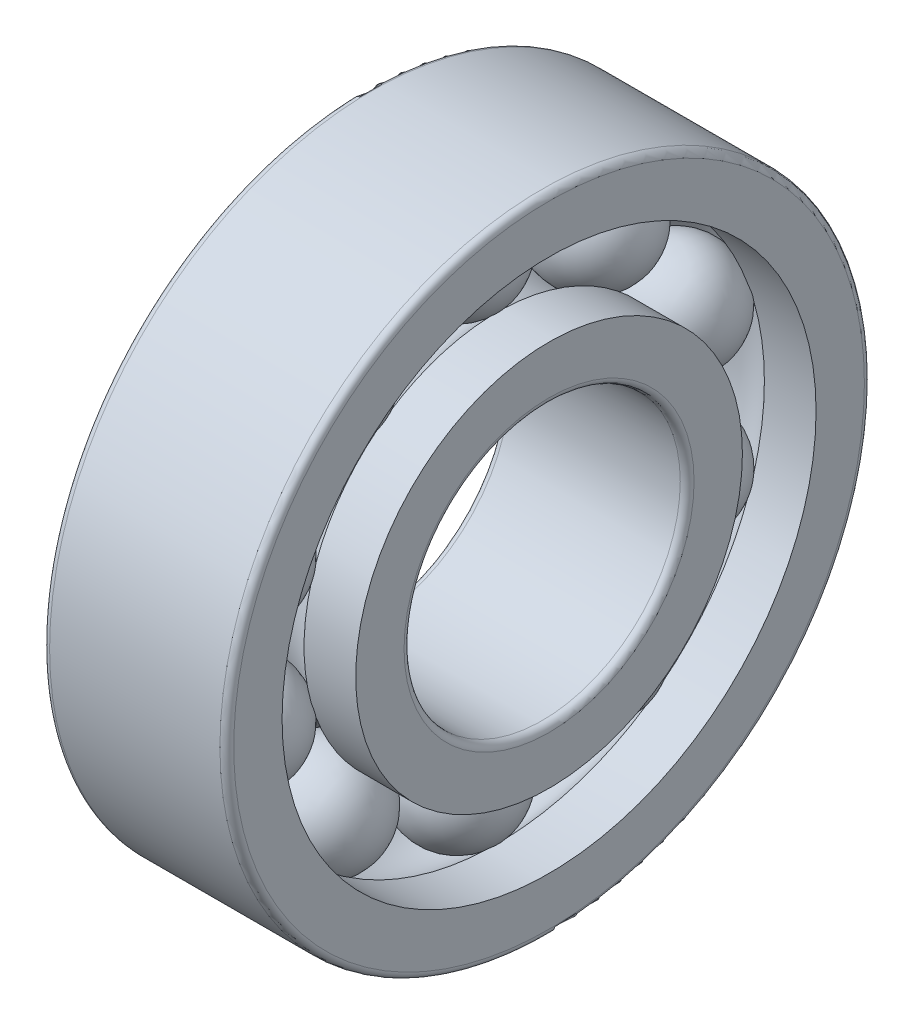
ISO-10303-21;
HEADER;
FILE_DESCRIPTION(('STEP AP214'),'2;1');
FILE_NAME('part.step','',(''),(''),'','','');
FILE_SCHEMA(('AUTOMOTIVE_DESIGN { 1 0 10303 214 1 1 1 1 }'));
ENDSEC;
DATA;
#1=APPLICATION_CONTEXT('core data for automotive mechanical design processes');
#2=APPLICATION_PROTOCOL_DEFINITION('international standard','automotive_design',2000,#1);
#3=PRODUCT_CONTEXT('',#1,'mechanical');
#4=PRODUCT('Part','Part','',(#3));
#5=PRODUCT_RELATED_PRODUCT_CATEGORY('part','',(#4));
#6=PRODUCT_DEFINITION_FORMATION('','',#4);
#7=PRODUCT_DEFINITION_CONTEXT('part definition',#1,'design');
#8=PRODUCT_DEFINITION('design','',#6,#7);
#9=PRODUCT_DEFINITION_SHAPE('','',#8);
#10=(LENGTH_UNIT() NAMED_UNIT(*) SI_UNIT(.MILLI.,.METRE.));
#11=(NAMED_UNIT(*) PLANE_ANGLE_UNIT() SI_UNIT($,.RADIAN.));
#12=(NAMED_UNIT(*) SI_UNIT($,.STERADIAN.) SOLID_ANGLE_UNIT());
#13=UNCERTAINTY_MEASURE_WITH_UNIT(LENGTH_MEASURE(1.E-05),#10,'distance_accuracy_value','');
#14=(GEOMETRIC_REPRESENTATION_CONTEXT(3) GLOBAL_UNCERTAINTY_ASSIGNED_CONTEXT((#13)) GLOBAL_UNIT_ASSIGNED_CONTEXT((#10,
#11,#12)) REPRESENTATION_CONTEXT('',''));
#15=CARTESIAN_POINT('',(0.,0.,0.));
#16=DIRECTION('',(0.,0.,1.));
#17=DIRECTION('',(1.,0.,0.));
#18=AXIS2_PLACEMENT_3D('',#15,#16,#17);
#19=CARTESIAN_POINT('',(0.,0.,0.));
#20=DIRECTION('',(1.,0.,0.));
#21=DIRECTION('',(0.,0.,-1.));
#22=AXIS2_PLACEMENT_3D('',#19,#20,#21);
#23=TOROIDAL_SURFACE('',#22,10.,2.375);
#24=CARTESIAN_POINT('',(1.75517093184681,0.,0.));
#25=DIRECTION('',(1.,0.,0.));
#26=DIRECTION('',(0.,0.,-1.));
#27=AXIS2_PLACEMENT_3D('',#24,#25,#26);
#28=CIRCLE('',#27,8.4);
#29=CARTESIAN_POINT('',(1.75517093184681,6.60481758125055,5.19002742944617));
#30=VERTEX_POINT('',#29);
#31=CARTESIAN_POINT('',(1.75517093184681,2.8950085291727,7.88536147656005));
#32=VERTEX_POINT('',#31);
#33=EDGE_CURVE('E483',#30,#32,#28,.T.);
#34=ORIENTED_EDGE('',*,*,#33,.F.);
#35=CARTESIAN_POINT('',(-1.75537093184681,6.60499266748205,5.19015975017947));
#36=CARTESIAN_POINT('',(-1.71036516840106,6.56558878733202,5.16038044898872));
#37=CARTESIAN_POINT('',(-1.66329614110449,6.52772182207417,5.13175747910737));
#38=CARTESIAN_POINT('',(-1.56533150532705,6.45528920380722,5.07699841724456));
#39=CARTESIAN_POINT('',(-1.51443607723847,6.42072339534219,5.05086220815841));
#40=CARTESIAN_POINT('',(-1.35663046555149,6.32242382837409,4.97652437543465));
#41=CARTESIAN_POINT('',(-1.24444760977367,6.26395394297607,4.93229227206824));
#42=CARTESIAN_POINT('',(-1.00936852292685,6.16287395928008,4.85581000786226));
#43=CARTESIAN_POINT('',(-0.886467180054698,6.12027147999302,4.82356560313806));
#44=CARTESIAN_POINT('',(-0.633439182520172,6.05212583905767,4.77198180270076));
#45=CARTESIAN_POINT('',(-0.503313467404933,6.02658046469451,4.75264073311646));
#46=CARTESIAN_POINT('',(-0.239542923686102,5.99327570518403,4.72742382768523));
#47=CARTESIAN_POINT('',(-0.105898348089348,5.98551504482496,4.72154702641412));
#48=CARTESIAN_POINT('',(0.161133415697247,5.98799129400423,4.72342208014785));
#49=CARTESIAN_POINT('',(0.294520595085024,5.99822880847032,4.73117439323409));
#50=CARTESIAN_POINT('',(0.557234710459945,6.03641414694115,4.76008594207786));
#51=CARTESIAN_POINT('',(0.68656199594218,6.06436044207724,4.78124402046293));
#52=CARTESIAN_POINT('',(0.937492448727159,6.13716752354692,4.8363537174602));
#53=CARTESIAN_POINT('',(1.05909564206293,6.18202825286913,4.87030529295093));
#54=CARTESIAN_POINT('',(1.28319554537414,6.28380460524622,4.94730923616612));
#55=CARTESIAN_POINT('',(1.38643054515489,6.33968331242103,4.9895783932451));
#56=CARTESIAN_POINT('',(1.53205365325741,6.43259712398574,5.05984036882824));
#57=CARTESIAN_POINT('',(1.57907631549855,6.46510171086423,5.08441718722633));
#58=CARTESIAN_POINT('',(1.66978671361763,6.53295810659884,5.13571546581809));
#59=CARTESIAN_POINT('',(1.71347414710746,6.56831017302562,5.16243712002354));
#60=CARTESIAN_POINT('',(1.75537093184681,6.60499266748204,5.19015975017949));
#61=B_SPLINE_CURVE_WITH_KNOTS('',3,(#35,#36,#37,#38,#39,#40,#41,#42,#43,#44,#45,#46,#47,#48,#49,
#50,#51,#52,#53,#54,#55,#56,#57,#58,#59,#60),.UNSPECIFIED.,.F.,.F.,(4,2,2,2,2,2,2,2,2,2,2,2,4),
(0.,0.200338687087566,0.400667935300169,0.800652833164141,1.20082954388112,1.6009543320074,
2.00105042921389,2.40115997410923,2.80123498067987,3.20130863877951,3.57396279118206,
3.76046464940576,3.94698339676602),.UNSPECIFIED.);
#62=CARTESIAN_POINT('',(-1.75517093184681,6.60481758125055,5.19002742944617));
#63=VERTEX_POINT('',#62);
#64=EDGE_CURVE('E303',#63,#30,#61,.T.);
#65=ORIENTED_EDGE('',*,*,#64,.F.);
#66=CARTESIAN_POINT('',(-1.75517093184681,0.,0.));
#67=DIRECTION('',(1.,0.,0.));
#68=DIRECTION('',(0.,0.,-1.));
#69=AXIS2_PLACEMENT_3D('',#66,#67,#68);
#70=CIRCLE('',#69,8.4);
#71=CARTESIAN_POINT('',(-1.75517093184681,2.8950085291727,7.88536147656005));
#72=VERTEX_POINT('',#71);
#73=EDGE_CURVE('E541',#63,#72,#70,.T.);
#74=ORIENTED_EDGE('',*,*,#73,.T.);
#75=CARTESIAN_POINT('',(1.75537093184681,2.89508026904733,7.88556888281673));
#76=CARTESIAN_POINT('',(1.71036516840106,2.87893493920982,7.83889125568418));
#77=CARTESIAN_POINT('',(1.66329614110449,2.86341441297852,7.79403264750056));
#78=CARTESIAN_POINT('',(1.56533150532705,2.83371836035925,7.70822365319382));
#79=CARTESIAN_POINT('',(1.51443607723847,2.81954277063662,7.66727308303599));
#80=CARTESIAN_POINT('',(1.35663046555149,2.77921952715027,7.55081298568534));
#81=CARTESIAN_POINT('',(1.24444760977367,2.75522048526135,7.48153634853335));
#82=CARTESIAN_POINT('',(1.00936852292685,2.71371696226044,7.36176925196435));
#83=CARTESIAN_POINT('',(0.886467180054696,2.69621560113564,7.31128781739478));
#84=CARTESIAN_POINT('',(0.633439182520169,2.66821465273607,7.23053719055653));
#85=CARTESIAN_POINT('',(0.50331346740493,2.65771415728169,7.20026537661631));
#86=CARTESIAN_POINT('',(0.239542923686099,2.64402319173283,7.16079821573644));
#87=CARTESIAN_POINT('',(0.105898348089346,2.64083219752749,7.15160135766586));
#88=CARTESIAN_POINT('',(-0.161133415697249,2.64185027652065,7.15453583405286));
#89=CARTESIAN_POINT('',(-0.294520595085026,2.6460595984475,7.16666788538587));
#90=CARTESIAN_POINT('',(-0.557234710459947,2.66175619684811,7.21191846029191));
#91=CARTESIAN_POINT('',(-0.686561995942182,2.67324284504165,7.2450351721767));
#92=CARTESIAN_POINT('',(-0.937492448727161,2.70315665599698,7.33130865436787));
#93=CARTESIAN_POINT('',(-1.05909564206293,2.72158379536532,7.38446535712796));
#94=CARTESIAN_POINT('',(-1.28319554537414,2.76336827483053,7.50505594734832));
#95=CARTESIAN_POINT('',(-1.38643054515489,2.78630116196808,7.57126164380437));
#96=CARTESIAN_POINT('',(-1.53205365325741,2.82441232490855,7.68134007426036));
#97=CARTESIAN_POINT('',(-1.57907631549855,2.83774179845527,7.71984842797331));
#98=CARTESIAN_POINT('',(-1.66978671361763,2.86556058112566,7.80023573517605));
#99=CARTESIAN_POINT('',(-1.71347414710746,2.88004999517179,7.84211499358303));
#100=CARTESIAN_POINT('',(-1.75537093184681,2.89508026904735,7.88556888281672));
#101=B_SPLINE_CURVE_WITH_KNOTS('',3,(#75,#76,#77,#78,#79,#80,#81,#82,#83,#84,#85,#86,#87,#88,
#89,#90,#91,#92,#93,#94,#95,#96,#97,#98,#99,#100),.UNSPECIFIED.,.F.,.F.,(4,2,2,2,2,2,2,2,2,2,2,
2,4),(0.,0.200338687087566,0.400667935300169,0.800652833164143,1.20082954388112,
1.60095433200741,2.00105042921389,2.40115997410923,2.80123498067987,3.20130863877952,
3.57396279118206,3.76046464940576,3.94698339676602),.UNSPECIFIED.);
#102=EDGE_CURVE('E486',#32,#72,#101,.T.);
#103=ORIENTED_EDGE('',*,*,#102,.F.);
#104=EDGE_LOOP('',(#34,#65,#74,#103));
#105=FACE_BOUND('',#104,.T.);
#106=ADVANCED_FACE('F34',(#105),#23,.F.);
#107=CARTESIAN_POINT('',(-1.75517093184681,8.39403125,0.316606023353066));
#108=VERTEX_POINT('',#107);
#109=CARTESIAN_POINT('',(-1.75517093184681,6.97701028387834,4.67774812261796));
#110=VERTEX_POINT('',#109);
#111=EDGE_CURVE('E321',#108,#110,#70,.T.);
#112=ORIENTED_EDGE('',*,*,#111,.T.);
#113=CARTESIAN_POINT('',(1.75537093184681,6.977190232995,4.67787375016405));
#114=CARTESIAN_POINT('',(1.71036516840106,6.93669196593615,4.6496007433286));
#115=CARTESIAN_POINT('',(1.66329614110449,6.89776836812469,4.62243210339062));
#116=CARTESIAN_POINT('',(1.56533150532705,6.82330649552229,4.57046607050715));
#117=CARTESIAN_POINT('',(1.51443607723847,6.78776806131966,4.54566856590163));
#118=CARTESIAN_POINT('',(1.35663046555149,6.68669234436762,4.47515177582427));
#119=CARTESIAN_POINT('',(1.24444760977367,6.62655692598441,4.43321208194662));
#120=CARTESIAN_POINT('',(1.00936852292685,6.5225825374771,4.36071362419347));
#121=CARTESIAN_POINT('',(0.886467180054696,6.47875139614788,4.33016032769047));
#122=CARTESIAN_POINT('',(0.633439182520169,6.40863412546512,4.28129024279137));
#123=CARTESIAN_POINT('',(0.50331346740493,6.38234572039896,4.26297186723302));
#124=CARTESIAN_POINT('',(0.239542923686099,6.34807128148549,4.23908961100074));
#125=CARTESIAN_POINT('',(0.105898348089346,6.34008393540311,4.23352481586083));
#126=CARTESIAN_POINT('',(-0.161133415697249,6.34263242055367,4.23530044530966));
#127=CARTESIAN_POINT('',(-0.294520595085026,6.35316887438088,4.24264130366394));
#128=CARTESIAN_POINT('',(-0.557234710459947,6.39246530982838,4.27002355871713));
#129=CARTESIAN_POINT('',(-0.686561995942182,6.42122371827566,4.2900638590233));
#130=CARTESIAN_POINT('',(-0.937492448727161,6.49613478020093,4.34227767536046));
#131=CARTESIAN_POINT('',(-1.05909564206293,6.5422873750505,4.37445115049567));
#132=CARTESIAN_POINT('',(-1.28319554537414,6.64697309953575,4.44745068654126));
#133=CARTESIAN_POINT('',(-1.38643054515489,6.70444092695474,4.4875326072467));
#134=CARTESIAN_POINT('',(-1.53205365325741,6.7999759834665,4.55418674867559));
#135=CARTESIAN_POINT('',(-1.57907631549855,6.83339439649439,4.57750579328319));
#136=CARTESIAN_POINT('',(-1.66978671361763,6.90315073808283,4.62618902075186));
#137=CARTESIAN_POINT('',(-1.71347414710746,6.93948893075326,4.65155338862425));
#138=CARTESIAN_POINT('',(-1.75537093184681,6.97719023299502,4.67787375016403));
#139=B_SPLINE_CURVE_WITH_KNOTS('',3,(#113,#114,#115,#116,#117,#118,#119,#120,#121,#122,#123,
#124,#125,#126,#127,#128,#129,#130,#131,#132,#133,#134,#135,#136,#137,#138),.UNSPECIFIED.,.F.,
.F.,(4,2,2,2,2,2,2,2,2,2,2,2,4),(0.,0.200338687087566,0.40066793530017,0.800652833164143,
1.20082954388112,1.60095433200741,2.00105042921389,2.40115997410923,2.80123498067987,
3.20130863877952,3.57396279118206,3.76046464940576,3.94698339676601),.UNSPECIFIED.);
#140=CARTESIAN_POINT('',(1.75517093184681,6.97701028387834,4.67774812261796));
#141=VERTEX_POINT('',#140);
#142=EDGE_CURVE('E54',#141,#110,#139,.T.);
#143=ORIENTED_EDGE('',*,*,#142,.F.);
#144=CARTESIAN_POINT('',(1.75517093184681,8.39403125,0.316606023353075));
#145=VERTEX_POINT('',#144);
#146=EDGE_CURVE('E432',#145,#141,#28,.T.);
#147=ORIENTED_EDGE('',*,*,#146,.F.);
#148=CARTESIAN_POINT('',(-1.75537093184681,8.39425067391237,0.31661015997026));
#149=CARTESIAN_POINT('',(-1.71036516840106,8.34486843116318,0.315679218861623));
#150=CARTESIAN_POINT('',(-1.66329614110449,8.29740925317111,0.314780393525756));
#151=CARTESIAN_POINT('',(-1.56533150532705,8.20662346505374,0.313054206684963));
#152=CARTESIAN_POINT('',(-1.51443607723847,8.16329666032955,0.312226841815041));
#153=CARTESIAN_POINT('',(-1.35663046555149,8.04007595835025,0.309865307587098));
#154=CARTESIAN_POINT('',(-1.24444760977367,7.96677384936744,0.308448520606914));
#155=CARTESIAN_POINT('',(-1.00936852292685,7.84004327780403,0.305986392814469));
#156=CARTESIAN_POINT('',(-0.886467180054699,7.78662436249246,0.304941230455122));
#157=CARTESIAN_POINT('',(-0.633439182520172,7.70117318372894,0.303264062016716));
#158=CARTESIAN_POINT('',(-0.503313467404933,7.66913814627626,0.302632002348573));
#159=CARTESIAN_POINT('',(-0.239542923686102,7.62737190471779,0.301807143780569));
#160=CARTESIAN_POINT('',(-0.105898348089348,7.61763910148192,0.301614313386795));
#161=CARTESIAN_POINT('',(0.161133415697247,7.62074455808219,0.301675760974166));
#162=CARTESIAN_POINT('',(0.294520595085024,7.63358357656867,0.301930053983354));
#163=CARTESIAN_POINT('',(0.557234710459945,7.68146994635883,0.302875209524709));
#164=CARTESIAN_POINT('',(0.68656199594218,7.71651538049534,0.303566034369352));
#165=CARTESIAN_POINT('',(0.937492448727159,7.80781021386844,0.305355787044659));
#166=CARTESIAN_POINT('',(1.05909564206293,7.86405954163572,0.306454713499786));
#167=CARTESIAN_POINT('',(1.28319554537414,7.99166012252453,0.308929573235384));
#168=CARTESIAN_POINT('',(1.38643054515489,8.06171213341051,0.310281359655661));
#169=CARTESIAN_POINT('',(1.53205365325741,8.17817993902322,0.312511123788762));
#170=CARTESIAN_POINT('',(1.57907631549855,8.21892259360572,0.313288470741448));
#171=CARTESIAN_POINT('',(1.66978671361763,8.30397194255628,0.314904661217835));
#172=CARTESIAN_POINT('',(1.71347414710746,8.34827895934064,0.315743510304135));
#173=CARTESIAN_POINT('',(1.75537093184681,8.39425067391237,0.316610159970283));
#174=B_SPLINE_CURVE_WITH_KNOTS('',3,(#148,#149,#150,#151,#152,#153,#154,#155,#156,#157,#158,
#159,#160,#161,#162,#163,#164,#165,#166,#167,#168,#169,#170,#171,#172,#173),.UNSPECIFIED.,.F.,
.F.,(4,2,2,2,2,2,2,2,2,2,2,2,4),(0.,0.200338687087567,0.400667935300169,0.800652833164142,
1.20082954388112,1.6009543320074,2.00105042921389,2.40115997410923,2.80123498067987,
3.20130863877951,3.57396279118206,3.76046464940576,3.94698339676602),.UNSPECIFIED.);
#175=EDGE_CURVE('E431',#108,#145,#174,.T.);
#176=ORIENTED_EDGE('',*,*,#175,.F.);
#177=EDGE_LOOP('',(#112,#143,#147,#176));
#178=FACE_BOUND('',#177,.T.);
#179=ADVANCED_FACE('F452',(#178),#23,.F.);
#180=CARTESIAN_POINT('',(-20.6375,0.,0.));
#181=DIRECTION('',(1.,0.,0.));
#182=DIRECTION('',(0.,0.,-1.));
#183=AXIS2_PLACEMENT_3D('',#180,#181,#182);
#184=CYLINDRICAL_SURFACE('',#183,8.4);
#185=CARTESIAN_POINT('',(4.,0.,0.));
#186=DIRECTION('',(1.,0.,0.));
#187=DIRECTION('',(0.,0.,-1.));
#188=AXIS2_PLACEMENT_3D('',#185,#186,#187);
#189=CIRCLE('',#188,8.4);
#190=CARTESIAN_POINT('',(4.,0.,-8.4));
#191=VERTEX_POINT('',#190);
#192=EDGE_CURVE('E521',#191,#191,#189,.T.);
#193=ORIENTED_EDGE('',*,*,#192,.F.);
#194=EDGE_LOOP('',(#193));
#195=FACE_BOUND('',#194,.T.);
#196=ORIENTED_EDGE('',*,*,#146,.T.);
#197=CARTESIAN_POINT('',(1.75497093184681,6.60424297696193,5.19075858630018));
#198=CARTESIAN_POINT('',(1.76384428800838,6.62970308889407,5.15836673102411));
#199=CARTESIAN_POINT('',(1.77099935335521,6.65513892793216,5.12551142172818));
#200=CARTESIAN_POINT('',(1.781813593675,6.70579396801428,5.05905887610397));
#201=CARTESIAN_POINT('',(1.78547221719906,6.7310131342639,5.02546152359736));
#202=CARTESIAN_POINT('',(1.79104031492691,6.80513986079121,4.92512391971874));
#203=CARTESIAN_POINT('',(1.78787795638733,6.85348740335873,4.85760449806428));
#204=CARTESIAN_POINT('',(1.77241115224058,6.92658213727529,4.75233142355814));
#205=CARTESIAN_POINT('',(1.76474118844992,6.95235382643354,4.71455192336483));
#206=CARTESIAN_POINT('',(1.75497093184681,6.97752809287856,4.67697570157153));
#207=B_SPLINE_CURVE_WITH_KNOTS('',3,(#197,#198,#199,#200,#201,#202,#203,#204,#205,#206),
.UNSPECIFIED.,.F.,.F.,(4,2,2,2,4),(0.,0.126355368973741,0.252730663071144,0.50072643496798,
0.639609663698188),.UNSPECIFIED.);
#208=EDGE_CURVE('E1341',#30,#141,#207,.T.);
#209=ORIENTED_EDGE('',*,*,#208,.F.);
#210=ORIENTED_EDGE('',*,*,#33,.T.);
#211=CARTESIAN_POINT('',(1.75497093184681,2.2918934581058,8.08128853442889));
#212=CARTESIAN_POINT('',(1.76384428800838,2.33153057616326,8.07004805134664));
#213=CARTESIAN_POINT('',(1.77099935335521,2.37142046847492,8.05841835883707));
#214=CARTESIAN_POINT('',(1.781813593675,2.4514610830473,8.03443140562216));
#215=CARTESIAN_POINT('',(1.78547221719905,2.49161184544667,8.02207403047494));
#216=CARTESIAN_POINT('',(1.79104031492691,2.61055859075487,7.98446980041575));
#217=CARTESIAN_POINT('',(1.78787795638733,2.68935949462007,7.9582634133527));
#218=CARTESIAN_POINT('',(1.77241115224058,2.81037233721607,7.91605971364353));
#219=CARTESIAN_POINT('',(1.76474118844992,2.85342830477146,7.90064367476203));
#220=CARTESIAN_POINT('',(1.75497093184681,2.89588146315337,7.88504093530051));
#221=B_SPLINE_CURVE_WITH_KNOTS('',3,(#211,#212,#213,#214,#215,#216,#217,#218,#219,#220),
.UNSPECIFIED.,.F.,.F.,(4,2,2,2,4),(0.,0.126355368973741,0.252730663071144,0.500726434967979,
0.639609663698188),.UNSPECIFIED.);
#222=CARTESIAN_POINT('',(1.75517093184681,2.29278808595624,8.0810347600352));
#223=VERTEX_POINT('',#222);
#224=EDGE_CURVE('E678',#223,#32,#221,.T.);
#225=ORIENTED_EDGE('',*,*,#224,.F.);
#226=CARTESIAN_POINT('',(1.75517093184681,-2.29278808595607,8.08103476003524));
#227=VERTEX_POINT('',#226);
#228=EDGE_CURVE('E491',#223,#227,#28,.T.);
#229=ORIENTED_EDGE('',*,*,#228,.T.);
#230=CARTESIAN_POINT('',(1.75497093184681,-2.89588146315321,7.88504093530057));
#231=CARTESIAN_POINT('',(1.76384428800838,-2.85720737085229,7.89924530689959));
#232=CARTESIAN_POINT('',(1.77099935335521,-2.81810000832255,7.91328337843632));
#233=CARTESIAN_POINT('',(1.781813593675,-2.73924661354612,7.94092421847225));
#234=CARTESIAN_POINT('',(1.78547221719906,-2.69950048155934,7.95452691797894));
#235=CARTESIAN_POINT('',(1.79104031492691,-2.58116733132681,7.99401959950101));
#236=CARTESIAN_POINT('',(1.78787795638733,-2.50201233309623,8.01913619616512));
#237=CARTESIAN_POINT('',(1.77241115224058,-2.37930417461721,8.05612225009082));
#238=CARTESIAN_POINT('',(1.76474118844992,-2.33540984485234,8.06895807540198));
#239=CARTESIAN_POINT('',(1.75497093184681,-2.29189345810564,8.08128853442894));
#240=B_SPLINE_CURVE_WITH_KNOTS('',3,(#230,#231,#232,#233,#234,#235,#236,#237,#238,#239),
.UNSPECIFIED.,.F.,.F.,(4,2,2,2,4),(0.,0.126355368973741,0.252730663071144,0.500726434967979,
0.639609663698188),.UNSPECIFIED.);
#241=CARTESIAN_POINT('',(1.75517093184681,-2.89500852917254,7.88536147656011));
#242=VERTEX_POINT('',#241);
#243=EDGE_CURVE('E774',#242,#227,#240,.T.);
#244=ORIENTED_EDGE('',*,*,#243,.F.);
#245=CARTESIAN_POINT('',(1.75517093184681,-6.60481758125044,5.19002742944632));
#246=VERTEX_POINT('',#245);
#247=EDGE_CURVE('E494',#242,#246,#28,.T.);
#248=ORIENTED_EDGE('',*,*,#247,.T.);
#249=CARTESIAN_POINT('',(1.75497093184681,-6.97752809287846,4.67697570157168));
#250=CARTESIAN_POINT('',(1.76384428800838,-6.95458921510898,4.71119934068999));
#251=CARTESIAN_POINT('',(1.77099935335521,-6.93120206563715,4.74554311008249));
#252=CARTESIAN_POINT('',(1.781813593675,-6.88365520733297,4.81425388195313));
#253=CARTESIAN_POINT('',(1.78547221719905,-6.85949537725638,4.84862088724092));
#254=CARTESIAN_POINT('',(1.79104031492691,-6.7869750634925,4.9501256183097));
#255=CARTESIAN_POINT('',(1.78787795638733,-6.73770048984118,5.016971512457));
#256=CARTESIAN_POINT('',(1.77241115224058,-6.66016736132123,5.1190199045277));
#257=CARTESIAN_POINT('',(1.76474118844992,-6.63220081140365,5.15520474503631));
#258=CARTESIAN_POINT('',(1.75497093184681,-6.60424297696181,5.19075858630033));
#259=B_SPLINE_CURVE_WITH_KNOTS('',3,(#249,#250,#251,#252,#253,#254,#255,#256,#257,#258),
.UNSPECIFIED.,.F.,.F.,(4,2,2,2,4),(0.,0.126355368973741,0.252730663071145,0.50072643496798,
0.639609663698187),.UNSPECIFIED.);
#260=CARTESIAN_POINT('',(1.75517093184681,-6.97701028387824,4.6777481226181));
#261=VERTEX_POINT('',#260);
#262=EDGE_CURVE('E831',#261,#246,#259,.T.);
#263=ORIENTED_EDGE('',*,*,#262,.F.);
#264=CARTESIAN_POINT('',(1.75517093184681,-8.39403125,0.316606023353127));
#265=VERTEX_POINT('',#264);
#266=EDGE_CURVE('E498',#261,#265,#28,.T.);
#267=ORIENTED_EDGE('',*,*,#266,.T.);
#268=CARTESIAN_POINT('',(1.75497093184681,-8.39399614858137,-0.317535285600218));
#269=CARTESIAN_POINT('',(1.76384428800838,-8.39555435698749,-0.276364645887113));
#270=CARTESIAN_POINT('',(1.77099935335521,-8.39682051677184,-0.234833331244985));
#271=CARTESIAN_POINT('',(1.781813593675,-8.39874147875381,-0.151297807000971));
#272=CARTESIAN_POINT('',(1.78547221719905,-8.39939618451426,-0.109293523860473));
#273=CARTESIAN_POINT('',(1.79104031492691,-8.40038900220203,0.0154518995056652));
#274=CARTESIAN_POINT('',(1.78787795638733,-8.39981606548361,0.098494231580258));
#275=CARTESIAN_POINT('',(1.77241115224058,-8.39707298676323,0.226625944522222));
#276=CARTESIAN_POINT('',(1.76474118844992,-8.39571648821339,0.27233842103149));
#277=CARTESIAN_POINT('',(1.75497093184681,-8.39399614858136,0.317535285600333));
#278=B_SPLINE_CURVE_WITH_KNOTS('',3,(#268,#269,#270,#271,#272,#273,#274,#275,#276,#277),
.UNSPECIFIED.,.F.,.F.,(4,2,2,2,4),(0.,0.126355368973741,0.252730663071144,0.500726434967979,
0.639609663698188),.UNSPECIFIED.);
#279=CARTESIAN_POINT('',(1.75517093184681,-8.39403125,-0.316606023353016));
#280=VERTEX_POINT('',#279);
#281=EDGE_CURVE('E888',#280,#265,#278,.T.);
#282=ORIENTED_EDGE('',*,*,#281,.F.);
#283=CARTESIAN_POINT('',(1.75517093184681,-6.97701028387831,-4.67774812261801));
#284=VERTEX_POINT('',#283);
#285=EDGE_CURVE('E502',#280,#284,#28,.T.);
#286=ORIENTED_EDGE('',*,*,#285,.T.);
#287=CARTESIAN_POINT('',(1.75497093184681,-6.60424297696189,-5.19075858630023));
#288=CARTESIAN_POINT('',(1.76384428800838,-6.62970308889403,-5.15836673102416));
#289=CARTESIAN_POINT('',(1.77099935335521,-6.65513892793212,-5.12551142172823));
#290=CARTESIAN_POINT('',(1.781813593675,-6.70579396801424,-5.05905887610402));
#291=CARTESIAN_POINT('',(1.78547221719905,-6.73101313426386,-5.02546152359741));
#292=CARTESIAN_POINT('',(1.79104031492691,-6.80513986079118,-4.92512391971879));
#293=CARTESIAN_POINT('',(1.78787795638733,-6.8534874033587,-4.85760449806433));
#294=CARTESIAN_POINT('',(1.77241115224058,-6.92658213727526,-4.75233142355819));
#295=CARTESIAN_POINT('',(1.76474118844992,-6.95235382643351,-4.71455192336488));
#296=CARTESIAN_POINT('',(1.75497093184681,-6.97752809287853,-4.67697570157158));
#297=B_SPLINE_CURVE_WITH_KNOTS('',3,(#287,#288,#289,#290,#291,#292,#293,#294,#295,#296),
.UNSPECIFIED.,.F.,.F.,(4,2,2,2,4),(0.,0.126355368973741,0.252730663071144,0.500726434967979,
0.639609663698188),.UNSPECIFIED.);
#298=CARTESIAN_POINT('',(1.75517093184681,-6.60481758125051,-5.19002742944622));
#299=VERTEX_POINT('',#298);
#300=EDGE_CURVE('E945',#299,#284,#297,.T.);
#301=ORIENTED_EDGE('',*,*,#300,.F.);
#302=CARTESIAN_POINT('',(1.75517093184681,-2.89500852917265,-7.88536147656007));
#303=VERTEX_POINT('',#302);
#304=EDGE_CURVE('E506',#299,#303,#28,.T.);
#305=ORIENTED_EDGE('',*,*,#304,.T.);
#306=CARTESIAN_POINT('',(1.75497093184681,-2.29189345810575,-8.08128853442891));
#307=CARTESIAN_POINT('',(1.76384428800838,-2.33153057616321,-8.07004805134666));
#308=CARTESIAN_POINT('',(1.77099935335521,-2.37142046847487,-8.05841835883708));
#309=CARTESIAN_POINT('',(1.781813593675,-2.45146108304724,-8.03443140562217));
#310=CARTESIAN_POINT('',(1.78547221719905,-2.49161184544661,-8.02207403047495));
#311=CARTESIAN_POINT('',(1.79104031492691,-2.61055859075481,-7.98446980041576));
#312=CARTESIAN_POINT('',(1.78787795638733,-2.68935949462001,-7.95826341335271));
#313=CARTESIAN_POINT('',(1.77241115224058,-2.81037233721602,-7.91605971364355));
#314=CARTESIAN_POINT('',(1.76474118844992,-2.8534283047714,-7.90064367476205));
#315=CARTESIAN_POINT('',(1.75497093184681,-2.89588146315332,-7.88504093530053));
#316=B_SPLINE_CURVE_WITH_KNOTS('',3,(#306,#307,#308,#309,#310,#311,#312,#313,#314,#315),
.UNSPECIFIED.,.F.,.F.,(4,2,2,2,4),(0.,0.126355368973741,0.252730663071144,0.500726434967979,
0.639609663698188),.UNSPECIFIED.);
#317=CARTESIAN_POINT('',(1.75517093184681,-2.29278808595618,-8.08103476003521));
#318=VERTEX_POINT('',#317);
#319=EDGE_CURVE('E1002',#318,#303,#316,.T.);
#320=ORIENTED_EDGE('',*,*,#319,.F.);
#321=CARTESIAN_POINT('',(1.75517093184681,2.29278808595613,-8.08103476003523));
#322=VERTEX_POINT('',#321);
#323=EDGE_CURVE('E510',#318,#322,#28,.T.);
#324=ORIENTED_EDGE('',*,*,#323,.T.);
#325=CARTESIAN_POINT('',(1.75497093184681,2.89588146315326,-7.88504093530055));
#326=CARTESIAN_POINT('',(1.76384428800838,2.85720737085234,-7.89924530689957));
#327=CARTESIAN_POINT('',(1.77099935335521,2.8181000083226,-7.9132833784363));
#328=CARTESIAN_POINT('',(1.781813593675,2.73924661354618,-7.94092421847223));
#329=CARTESIAN_POINT('',(1.78547221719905,2.6995004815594,-7.95452691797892));
#330=CARTESIAN_POINT('',(1.79104031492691,2.58116733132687,-7.994019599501));
#331=CARTESIAN_POINT('',(1.78787795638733,2.50201233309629,-8.0191361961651));
#332=CARTESIAN_POINT('',(1.77241115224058,2.37930417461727,-8.05612225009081));
#333=CARTESIAN_POINT('',(1.76474118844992,2.33540984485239,-8.06895807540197));
#334=CARTESIAN_POINT('',(1.75497093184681,2.29189345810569,-8.08128853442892));
#335=B_SPLINE_CURVE_WITH_KNOTS('',3,(#325,#326,#327,#328,#329,#330,#331,#332,#333,#334),
.UNSPECIFIED.,.F.,.F.,(4,2,2,2,4),(0.,0.12635536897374,0.252730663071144,0.50072643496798,
0.639609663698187),.UNSPECIFIED.);
#336=CARTESIAN_POINT('',(1.75517093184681,2.8950085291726,-7.88536147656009));
#337=VERTEX_POINT('',#336);
#338=EDGE_CURVE('E1058',#337,#322,#335,.T.);
#339=ORIENTED_EDGE('',*,*,#338,.F.);
#340=CARTESIAN_POINT('',(1.75517093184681,6.60481758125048,-5.19002742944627));
#341=VERTEX_POINT('',#340);
#342=EDGE_CURVE('E514',#337,#341,#28,.T.);
#343=ORIENTED_EDGE('',*,*,#342,.T.);
#344=CARTESIAN_POINT('',(1.75497093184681,6.97752809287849,-4.67697570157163));
#345=CARTESIAN_POINT('',(1.76384428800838,6.95458921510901,-4.71119934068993));
#346=CARTESIAN_POINT('',(1.77099935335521,6.93120206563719,-4.74554311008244));
#347=CARTESIAN_POINT('',(1.781813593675,6.883655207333,-4.81425388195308));
#348=CARTESIAN_POINT('',(1.78547221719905,6.85949537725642,-4.84862088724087));
#349=CARTESIAN_POINT('',(1.79104031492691,6.78697506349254,-4.95012561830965));
#350=CARTESIAN_POINT('',(1.78787795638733,6.73770048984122,-5.01697151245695));
#351=CARTESIAN_POINT('',(1.77241115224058,6.66016736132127,-5.11901990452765));
#352=CARTESIAN_POINT('',(1.76474118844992,6.63220081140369,-5.15520474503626));
#353=CARTESIAN_POINT('',(1.75497093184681,6.60424297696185,-5.19075858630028));
#354=B_SPLINE_CURVE_WITH_KNOTS('',3,(#344,#345,#346,#347,#348,#349,#350,#351,#352,#353),
.UNSPECIFIED.,.F.,.F.,(4,2,2,2,4),(0.,0.126355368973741,0.252730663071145,0.500726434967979,
0.639609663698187),.UNSPECIFIED.);
#355=CARTESIAN_POINT('',(1.75517093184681,6.97701028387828,-4.67774812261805));
#356=VERTEX_POINT('',#355);
#357=EDGE_CURVE('E590',#356,#341,#354,.T.);
#358=ORIENTED_EDGE('',*,*,#357,.F.);
#359=CARTESIAN_POINT('',(1.75517093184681,8.39403125,-0.316606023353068));
#360=VERTEX_POINT('',#359);
#361=EDGE_CURVE('E493',#356,#360,#28,.T.);
#362=ORIENTED_EDGE('',*,*,#361,.T.);
#363=CARTESIAN_POINT('',(1.75497093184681,8.39399614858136,0.317535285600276));
#364=CARTESIAN_POINT('',(1.76384428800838,8.39555435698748,0.276364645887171));
#365=CARTESIAN_POINT('',(1.77099935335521,8.39682051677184,0.234833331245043));
#366=CARTESIAN_POINT('',(1.781813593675,8.39874147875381,0.15129780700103));
#367=CARTESIAN_POINT('',(1.78547221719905,8.39939618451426,0.109293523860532));
#368=CARTESIAN_POINT('',(1.79104031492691,8.40038900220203,-0.0154518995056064));
#369=CARTESIAN_POINT('',(1.78787795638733,8.39981606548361,-0.0984942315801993));
#370=CARTESIAN_POINT('',(1.77241115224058,8.39707298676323,-0.226625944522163));
#371=CARTESIAN_POINT('',(1.76474118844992,8.39571648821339,-0.272338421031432));
#372=CARTESIAN_POINT('',(1.75497093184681,8.39399614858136,-0.317535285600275));
#373=B_SPLINE_CURVE_WITH_KNOTS('',3,(#363,#364,#365,#366,#367,#368,#369,#370,#371,#372),
.UNSPECIFIED.,.F.,.F.,(4,2,2,2,4),(0.,0.126355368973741,0.252730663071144,0.500726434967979,
0.639609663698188),.UNSPECIFIED.);
#374=EDGE_CURVE('E393',#145,#360,#373,.T.);
#375=ORIENTED_EDGE('',*,*,#374,.F.);
#376=EDGE_LOOP('',(#196,#209,#210,#225,#229,#244,#248,#263,#267,#282,#286,#301,#305,#320,#324,
#339,#343,#358,#362,#375));
#377=FACE_BOUND('',#376,.T.);
#378=ADVANCED_FACE('F419',(#195,#377),#184,.T.);
#379=CARTESIAN_POINT('',(-20.6375,0.,0.));
#380=DIRECTION('',(1.,0.,0.));
#381=DIRECTION('',(0.,0.,-1.));
#382=AXIS2_PLACEMENT_3D('',#379,#380,#381);
#383=CYLINDRICAL_SURFACE('',#382,8.4);
#384=CARTESIAN_POINT('',(-4.,0.,0.));
#385=DIRECTION('',(1.,0.,0.));
#386=DIRECTION('',(0.,0.,-1.));
#387=AXIS2_PLACEMENT_3D('',#384,#385,#386);
#388=CIRCLE('',#387,8.4);
#389=CARTESIAN_POINT('',(-4.,0.,-8.4));
#390=VERTEX_POINT('',#389);
#391=EDGE_CURVE('E538',#390,#390,#388,.T.);
#392=ORIENTED_EDGE('',*,*,#391,.T.);
#393=EDGE_LOOP('',(#392));
#394=FACE_BOUND('',#393,.T.);
#395=ORIENTED_EDGE('',*,*,#73,.F.);
#396=CARTESIAN_POINT('',(-1.75497093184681,6.97752809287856,4.67697570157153));
#397=CARTESIAN_POINT('',(-1.76384428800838,6.95458921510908,4.71119934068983));
#398=CARTESIAN_POINT('',(-1.77099935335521,6.93120206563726,4.74554311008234));
#399=CARTESIAN_POINT('',(-1.781813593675,6.88365520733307,4.81425388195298));
#400=CARTESIAN_POINT('',(-1.78547221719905,6.85949537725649,4.84862088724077));
#401=CARTESIAN_POINT('',(-1.79104031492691,6.78697506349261,4.95012561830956));
#402=CARTESIAN_POINT('',(-1.78787795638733,6.73770048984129,5.01697151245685));
#403=CARTESIAN_POINT('',(-1.77241115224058,6.66016736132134,5.11901990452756));
#404=CARTESIAN_POINT('',(-1.76474118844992,6.63220081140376,5.15520474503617));
#405=CARTESIAN_POINT('',(-1.75497093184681,6.60424297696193,5.19075858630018));
#406=B_SPLINE_CURVE_WITH_KNOTS('',3,(#396,#397,#398,#399,#400,#401,#402,#403,#404,#405),
.UNSPECIFIED.,.F.,.F.,(4,2,2,2,4),(0.,0.126355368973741,0.252730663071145,0.500726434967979,
0.639609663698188),.UNSPECIFIED.);
#407=EDGE_CURVE('E681',#110,#63,#406,.T.);
#408=ORIENTED_EDGE('',*,*,#407,.F.);
#409=ORIENTED_EDGE('',*,*,#111,.F.);
#410=CARTESIAN_POINT('',(-1.75497093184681,8.39399614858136,-0.317535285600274));
#411=CARTESIAN_POINT('',(-1.76384428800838,8.39555435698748,-0.27636464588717));
#412=CARTESIAN_POINT('',(-1.77099935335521,8.39682051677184,-0.234833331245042));
#413=CARTESIAN_POINT('',(-1.781813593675,8.39874147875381,-0.151297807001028));
#414=CARTESIAN_POINT('',(-1.78547221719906,8.39939618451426,-0.10929352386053));
#415=CARTESIAN_POINT('',(-1.79104031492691,8.40038900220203,0.015451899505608));
#416=CARTESIAN_POINT('',(-1.78787795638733,8.39981606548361,0.098494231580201));
#417=CARTESIAN_POINT('',(-1.77241115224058,8.39707298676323,0.226625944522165));
#418=CARTESIAN_POINT('',(-1.76474118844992,8.39571648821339,0.272338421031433));
#419=CARTESIAN_POINT('',(-1.75497093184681,8.39399614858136,0.317535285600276));
#420=B_SPLINE_CURVE_WITH_KNOTS('',3,(#410,#411,#412,#413,#414,#415,#416,#417,#418,#419),
.UNSPECIFIED.,.F.,.F.,(4,2,2,2,4),(0.,0.126355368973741,0.252730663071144,0.500726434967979,
0.639609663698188),.UNSPECIFIED.);
#421=CARTESIAN_POINT('',(-1.75517093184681,8.39403125,-0.316606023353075));
#422=VERTEX_POINT('',#421);
#423=EDGE_CURVE('E424',#422,#108,#420,.T.);
#424=ORIENTED_EDGE('',*,*,#423,.F.);
#425=CARTESIAN_POINT('',(-1.75517093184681,6.97701028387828,-4.67774812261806));
#426=VERTEX_POINT('',#425);
#427=EDGE_CURVE('E316',#426,#422,#70,.T.);
#428=ORIENTED_EDGE('',*,*,#427,.F.);
#429=CARTESIAN_POINT('',(-1.75497093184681,6.60424297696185,-5.19075858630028));
#430=CARTESIAN_POINT('',(-1.76384428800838,6.62970308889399,-5.1583667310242));
#431=CARTESIAN_POINT('',(-1.77099935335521,6.65513892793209,-5.12551142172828));
#432=CARTESIAN_POINT('',(-1.781813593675,6.7057939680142,-5.05905887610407));
#433=CARTESIAN_POINT('',(-1.78547221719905,6.73101313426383,-5.02546152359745));
#434=CARTESIAN_POINT('',(-1.79104031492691,6.80513986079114,-4.92512391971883));
#435=CARTESIAN_POINT('',(-1.78787795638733,6.85348740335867,-4.85760449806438));
#436=CARTESIAN_POINT('',(-1.77241115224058,6.92658213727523,-4.75233142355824));
#437=CARTESIAN_POINT('',(-1.76474118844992,6.95235382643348,-4.71455192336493));
#438=CARTESIAN_POINT('',(-1.75497093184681,6.9775280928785,-4.67697570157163));
#439=B_SPLINE_CURVE_WITH_KNOTS('',3,(#429,#430,#431,#432,#433,#434,#435,#436,#437,#438),
.UNSPECIFIED.,.F.,.F.,(4,2,2,2,4),(0.,0.12635536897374,0.252730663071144,0.500726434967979,
0.639609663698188),.UNSPECIFIED.);
#440=CARTESIAN_POINT('',(-1.75517093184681,6.60481758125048,-5.19002742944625));
#441=VERTEX_POINT('',#440);
#442=EDGE_CURVE('E354',#441,#426,#439,.T.);
#443=ORIENTED_EDGE('',*,*,#442,.F.);
#444=CARTESIAN_POINT('',(-1.75517093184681,2.89500852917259,-7.8853614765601));
#445=VERTEX_POINT('',#444);
#446=EDGE_CURVE('E319',#445,#441,#70,.T.);
#447=ORIENTED_EDGE('',*,*,#446,.F.);
#448=CARTESIAN_POINT('',(-1.75497093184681,2.29189345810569,-8.08128853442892));
#449=CARTESIAN_POINT('',(-1.76384428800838,2.33153057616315,-8.07004805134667));
#450=CARTESIAN_POINT('',(-1.77099935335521,2.37142046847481,-8.0584183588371));
#451=CARTESIAN_POINT('',(-1.781813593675,2.45146108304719,-8.03443140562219));
#452=CARTESIAN_POINT('',(-1.78547221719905,2.49161184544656,-8.02207403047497));
#453=CARTESIAN_POINT('',(-1.79104031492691,2.61055859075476,-7.98446980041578));
#454=CARTESIAN_POINT('',(-1.78787795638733,2.68935949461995,-7.95826341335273));
#455=CARTESIAN_POINT('',(-1.77241115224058,2.81037233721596,-7.91605971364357));
#456=CARTESIAN_POINT('',(-1.76474118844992,2.85342830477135,-7.90064367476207));
#457=CARTESIAN_POINT('',(-1.75497093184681,2.89588146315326,-7.88504093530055));
#458=B_SPLINE_CURVE_WITH_KNOTS('',3,(#448,#449,#450,#451,#452,#453,#454,#455,#456,#457),
.UNSPECIFIED.,.F.,.F.,(4,2,2,2,4),(0.,0.12635536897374,0.252730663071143,0.500726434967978,
0.639609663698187),.UNSPECIFIED.);
#459=CARTESIAN_POINT('',(-1.75517093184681,2.29278808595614,-8.08103476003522));
#460=VERTEX_POINT('',#459);
#461=EDGE_CURVE('E602',#460,#445,#458,.T.);
#462=ORIENTED_EDGE('',*,*,#461,.F.);
#463=CARTESIAN_POINT('',(-1.75517093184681,-2.29278808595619,-8.08103476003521));
#464=VERTEX_POINT('',#463);
#465=EDGE_CURVE('E568',#464,#460,#70,.T.);
#466=ORIENTED_EDGE('',*,*,#465,.F.);
#467=CARTESIAN_POINT('',(-1.75497093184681,-2.89588146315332,-7.88504093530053));
#468=CARTESIAN_POINT('',(-1.76384428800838,-2.8572073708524,-7.89924530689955));
#469=CARTESIAN_POINT('',(-1.77099935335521,-2.81810000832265,-7.91328337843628));
#470=CARTESIAN_POINT('',(-1.781813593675,-2.73924661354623,-7.94092421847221));
#471=CARTESIAN_POINT('',(-1.78547221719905,-2.69950048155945,-7.9545269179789));
#472=CARTESIAN_POINT('',(-1.79104031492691,-2.58116733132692,-7.99401959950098));
#473=CARTESIAN_POINT('',(-1.78787795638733,-2.50201233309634,-8.01913619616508));
#474=CARTESIAN_POINT('',(-1.77241115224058,-2.37930417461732,-8.05612225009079));
#475=CARTESIAN_POINT('',(-1.76474118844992,-2.33540984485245,-8.06895807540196));
#476=CARTESIAN_POINT('',(-1.75497093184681,-2.29189345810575,-8.08128853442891));
#477=B_SPLINE_CURVE_WITH_KNOTS('',3,(#467,#468,#469,#470,#471,#472,#473,#474,#475,#476),
.UNSPECIFIED.,.F.,.F.,(4,2,2,2,4),(0.,0.126355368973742,0.252730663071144,0.500726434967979,
0.639609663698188),.UNSPECIFIED.);
#478=CARTESIAN_POINT('',(-1.75517093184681,-2.89500852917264,-7.88536147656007));
#479=VERTEX_POINT('',#478);
#480=EDGE_CURVE('E1018',#479,#464,#477,.T.);
#481=ORIENTED_EDGE('',*,*,#480,.F.);
#482=CARTESIAN_POINT('',(-1.75517093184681,-6.60481758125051,-5.19002742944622));
#483=VERTEX_POINT('',#482);
#484=EDGE_CURVE('E562',#483,#479,#70,.T.);
#485=ORIENTED_EDGE('',*,*,#484,.F.);
#486=CARTESIAN_POINT('',(-1.75497093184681,-6.97752809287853,-4.67697570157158));
#487=CARTESIAN_POINT('',(-1.76384428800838,-6.95458921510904,-4.71119934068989));
#488=CARTESIAN_POINT('',(-1.77099935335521,-6.93120206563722,-4.74554311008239));
#489=CARTESIAN_POINT('',(-1.781813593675,-6.88365520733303,-4.81425388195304));
#490=CARTESIAN_POINT('',(-1.78547221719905,-6.85949537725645,-4.84862088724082));
#491=CARTESIAN_POINT('',(-1.79104031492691,-6.78697506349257,-4.95012561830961));
#492=CARTESIAN_POINT('',(-1.78787795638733,-6.73770048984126,-5.0169715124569));
#493=CARTESIAN_POINT('',(-1.77241115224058,-6.6601673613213,-5.11901990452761));
#494=CARTESIAN_POINT('',(-1.76474118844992,-6.63220081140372,-5.15520474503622));
#495=CARTESIAN_POINT('',(-1.75497093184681,-6.60424297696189,-5.19075858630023));
#496=B_SPLINE_CURVE_WITH_KNOTS('',3,(#486,#487,#488,#489,#490,#491,#492,#493,#494,#495),
.UNSPECIFIED.,.F.,.F.,(4,2,2,2,4),(0.,0.126355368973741,0.252730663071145,0.500726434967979,
0.639609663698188),.UNSPECIFIED.);
#497=CARTESIAN_POINT('',(-1.75517093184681,-6.97701028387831,-4.67774812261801));
#498=VERTEX_POINT('',#497);
#499=EDGE_CURVE('E961',#498,#483,#496,.T.);
#500=ORIENTED_EDGE('',*,*,#499,.F.);
#501=CARTESIAN_POINT('',(-1.75517093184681,-8.39403125,-0.316606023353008));
#502=VERTEX_POINT('',#501);
#503=EDGE_CURVE('E556',#502,#498,#70,.T.);
#504=ORIENTED_EDGE('',*,*,#503,.F.);
#505=CARTESIAN_POINT('',(-1.75497093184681,-8.39399614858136,0.317535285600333));
#506=CARTESIAN_POINT('',(-1.76384428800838,-8.39555435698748,0.276364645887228));
#507=CARTESIAN_POINT('',(-1.77099935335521,-8.39682051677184,0.2348333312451));
#508=CARTESIAN_POINT('',(-1.781813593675,-8.39874147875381,0.151297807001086));
#509=CARTESIAN_POINT('',(-1.78547221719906,-8.39939618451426,0.109293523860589));
#510=CARTESIAN_POINT('',(-1.79104031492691,-8.40038900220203,-0.0154518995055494));
#511=CARTESIAN_POINT('',(-1.78787795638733,-8.39981606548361,-0.0984942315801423));
#512=CARTESIAN_POINT('',(-1.77241115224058,-8.39707298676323,-0.226625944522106));
#513=CARTESIAN_POINT('',(-1.76474118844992,-8.39571648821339,-0.272338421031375));
#514=CARTESIAN_POINT('',(-1.75497093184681,-8.39399614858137,-0.317535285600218));
#515=B_SPLINE_CURVE_WITH_KNOTS('',3,(#505,#506,#507,#508,#509,#510,#511,#512,#513,#514),
.UNSPECIFIED.,.F.,.F.,(4,2,2,2,4),(0.,0.126355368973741,0.252730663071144,0.500726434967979,
0.639609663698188),.UNSPECIFIED.);
#516=CARTESIAN_POINT('',(-1.75517093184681,-8.39403125,0.316606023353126));
#517=VERTEX_POINT('',#516);
#518=EDGE_CURVE('E904',#517,#502,#515,.T.);
#519=ORIENTED_EDGE('',*,*,#518,.F.);
#520=CARTESIAN_POINT('',(-1.75517093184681,-6.97701028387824,4.67774812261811));
#521=VERTEX_POINT('',#520);
#522=EDGE_CURVE('E550',#521,#517,#70,.T.);
#523=ORIENTED_EDGE('',*,*,#522,.F.);
#524=CARTESIAN_POINT('',(-1.75497093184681,-6.60424297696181,5.19075858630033));
#525=CARTESIAN_POINT('',(-1.76384428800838,-6.62970308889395,5.15836673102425));
#526=CARTESIAN_POINT('',(-1.77099935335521,-6.65513892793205,5.12551142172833));
#527=CARTESIAN_POINT('',(-1.781813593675,-6.70579396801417,5.05905887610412));
#528=CARTESIAN_POINT('',(-1.78547221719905,-6.73101313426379,5.0254615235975));
#529=CARTESIAN_POINT('',(-1.79104031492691,-6.80513986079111,4.92512391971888));
#530=CARTESIAN_POINT('',(-1.78787795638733,-6.85348740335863,4.85760449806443));
#531=CARTESIAN_POINT('',(-1.77241115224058,-6.92658213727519,4.75233142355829));
#532=CARTESIAN_POINT('',(-1.76474118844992,-6.95235382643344,4.71455192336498));
#533=CARTESIAN_POINT('',(-1.75497093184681,-6.97752809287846,4.67697570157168));
#534=B_SPLINE_CURVE_WITH_KNOTS('',3,(#524,#525,#526,#527,#528,#529,#530,#531,#532,#533),
.UNSPECIFIED.,.F.,.F.,(4,2,2,2,4),(0.,0.12635536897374,0.252730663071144,0.500726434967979,
0.639609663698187),.UNSPECIFIED.);
#535=CARTESIAN_POINT('',(-1.75517093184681,-6.60481758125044,5.19002742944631));
#536=VERTEX_POINT('',#535);
#537=EDGE_CURVE('E847',#536,#521,#534,.T.);
#538=ORIENTED_EDGE('',*,*,#537,.F.);
#539=CARTESIAN_POINT('',(-1.75517093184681,-2.89500852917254,7.88536147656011));
#540=VERTEX_POINT('',#539);
#541=EDGE_CURVE('E544',#540,#536,#70,.T.);
#542=ORIENTED_EDGE('',*,*,#541,.F.);
#543=CARTESIAN_POINT('',(-1.75497093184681,-2.29189345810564,8.08128853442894));
#544=CARTESIAN_POINT('',(-1.76384428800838,-2.33153057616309,8.07004805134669));
#545=CARTESIAN_POINT('',(-1.77099935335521,-2.37142046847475,8.05841835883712));
#546=CARTESIAN_POINT('',(-1.781813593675,-2.45146108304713,8.03443140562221));
#547=CARTESIAN_POINT('',(-1.78547221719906,-2.4916118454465,8.02207403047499));
#548=CARTESIAN_POINT('',(-1.79104031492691,-2.6105585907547,7.9844698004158));
#549=CARTESIAN_POINT('',(-1.78787795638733,-2.6893594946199,7.95826341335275));
#550=CARTESIAN_POINT('',(-1.77241115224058,-2.81037233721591,7.91605971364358));
#551=CARTESIAN_POINT('',(-1.76474118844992,-2.85342830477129,7.90064367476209));
#552=CARTESIAN_POINT('',(-1.75497093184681,-2.89588146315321,7.88504093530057));
#553=B_SPLINE_CURVE_WITH_KNOTS('',3,(#543,#544,#545,#546,#547,#548,#549,#550,#551,#552),
.UNSPECIFIED.,.F.,.F.,(4,2,2,2,4),(0.,0.126355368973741,0.252730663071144,0.500726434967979,
0.639609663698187),.UNSPECIFIED.);
#554=CARTESIAN_POINT('',(-1.75517093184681,-2.29278808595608,8.08103476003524));
#555=VERTEX_POINT('',#554);
#556=EDGE_CURVE('E790',#555,#540,#553,.T.);
#557=ORIENTED_EDGE('',*,*,#556,.F.);
#558=CARTESIAN_POINT('',(-1.75517093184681,2.29278808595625,8.0810347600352));
#559=VERTEX_POINT('',#558);
#560=EDGE_CURVE('E543',#559,#555,#70,.T.);
#561=ORIENTED_EDGE('',*,*,#560,.F.);
#562=CARTESIAN_POINT('',(-1.75497093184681,2.89588146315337,7.88504093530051));
#563=CARTESIAN_POINT('',(-1.76384428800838,2.85720737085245,7.89924530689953));
#564=CARTESIAN_POINT('',(-1.77099935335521,2.81810000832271,7.91328337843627));
#565=CARTESIAN_POINT('',(-1.781813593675,2.73924661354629,7.9409242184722));
#566=CARTESIAN_POINT('',(-1.78547221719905,2.69950048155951,7.95452691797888));
#567=CARTESIAN_POINT('',(-1.79104031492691,2.58116733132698,7.99401959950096));
#568=CARTESIAN_POINT('',(-1.78787795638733,2.5020123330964,8.01913619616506));
#569=CARTESIAN_POINT('',(-1.77241115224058,2.37930417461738,8.05612225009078));
#570=CARTESIAN_POINT('',(-1.76474118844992,2.33540984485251,8.06895807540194));
#571=CARTESIAN_POINT('',(-1.75497093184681,2.2918934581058,8.08128853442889));
#572=B_SPLINE_CURVE_WITH_KNOTS('',3,(#562,#563,#564,#565,#566,#567,#568,#569,#570,#571),
.UNSPECIFIED.,.F.,.F.,(4,2,2,2,4),(0.,0.126355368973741,0.252730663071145,0.50072643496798,
0.639609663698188),.UNSPECIFIED.);
#573=EDGE_CURVE('E734',#72,#559,#572,.T.);
#574=ORIENTED_EDGE('',*,*,#573,.F.);
#575=EDGE_LOOP('',(#395,#408,#409,#424,#428,#443,#447,#462,#466,#481,#485,#500,#504,#519,#523,
#538,#542,#557,#561,#574));
#576=FACE_BOUND('',#575,.T.);
#577=ADVANCED_FACE('F411',(#394,#576),#383,.T.);
#578=CARTESIAN_POINT('',(0.,0.,0.));
#579=DIRECTION('',(1.,0.,0.));
#580=DIRECTION('',(0.,0.,-1.));
#581=AXIS2_PLACEMENT_3D('',#578,#579,#580);
#582=TOROIDAL_SURFACE('',#581,10.,2.375);
#583=CARTESIAN_POINT('',(1.75517093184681,0.,0.));
#584=DIRECTION('',(1.,0.,0.));
#585=DIRECTION('',(0.,0.,-1.));
#586=AXIS2_PLACEMENT_3D('',#583,#584,#585);
#587=CIRCLE('',#586,11.6);
#588=CARTESIAN_POINT('',(1.75517093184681,11.59403125,0.372074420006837));
#589=VERTEX_POINT('',#588);
#590=CARTESIAN_POINT('',(1.75517093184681,9.5984681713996,6.51378605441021));
#591=VERTEX_POINT('',#590);
#592=EDGE_CURVE('E310',#589,#591,#587,.T.);
#593=ORIENTED_EDGE('',*,*,#592,.T.);
#594=CARTESIAN_POINT('',(-1.75537093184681,9.5982885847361,6.51365992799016));
#595=CARTESIAN_POINT('',(-1.71036435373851,9.63870602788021,6.54204570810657));
#596=CARTESIAN_POINT('',(-1.66329446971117,9.67754797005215,6.56932807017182));
#597=CARTESIAN_POINT('',(-1.56532814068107,9.7518471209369,6.62152028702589));
#598=CARTESIAN_POINT('',(-1.51443187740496,9.78730449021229,6.6464302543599));
#599=CARTESIAN_POINT('',(-1.35662419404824,9.88814138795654,6.7172773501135));
#600=CARTESIAN_POINT('',(-1.24444027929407,9.94812336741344,6.7594283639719));
#601=CARTESIAN_POINT('',(-1.00936024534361,10.0518205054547,6.83230735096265));
#602=CARTESIAN_POINT('',(-0.886459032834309,10.0955278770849,6.86302985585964));
#603=CARTESIAN_POINT('',(-0.63343223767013,10.1654422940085,6.9121768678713));
#604=CARTESIAN_POINT('',(-0.503307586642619,10.1916515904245,6.93060295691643));
#605=CARTESIAN_POINT('',(-0.239533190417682,10.2258230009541,6.95462717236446));
#606=CARTESIAN_POINT('',(-0.105883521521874,10.2337855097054,6.96022557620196));
#607=CARTESIAN_POINT('',(0.161158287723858,10.2312428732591,6.9584379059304));
#608=CARTESIAN_POINT('',(0.294550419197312,10.2207371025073,6.95105139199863));
#609=CARTESIAN_POINT('',(0.557279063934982,10.1815529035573,6.92350327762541));
#610=CARTESIAN_POINT('',(0.686615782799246,10.1528753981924,6.90334232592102));
#611=CARTESIAN_POINT('',(0.937564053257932,10.0781661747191,6.850826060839));
#612=CARTESIAN_POINT('',(1.05917563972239,10.032134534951,6.81847080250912));
#613=CARTESIAN_POINT('',(1.28326507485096,9.92771828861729,6.74508914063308));
#614=CARTESIAN_POINT('',(1.38648356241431,9.87040051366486,6.70481180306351));
#615=CARTESIAN_POINT('',(1.53208465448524,9.77510011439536,6.63785623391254));
#616=CARTESIAN_POINT('',(1.57910044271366,9.74176154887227,6.61443527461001));
#617=CARTESIAN_POINT('',(1.66979805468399,9.67216616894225,6.56554793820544));
#618=CARTESIAN_POINT('',(1.71347957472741,9.63590908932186,6.54008137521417));
#619=CARTESIAN_POINT('',(1.75537093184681,9.59828858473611,6.51365992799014));
#620=B_SPLINE_CURVE_WITH_KNOTS('',3,(#594,#595,#596,#597,#598,#599,#600,#601,#602,#603,#604,
#605,#606,#607,#608,#609,#610,#611,#612,#613,#614,#615,#616,#617,#618,#619),.UNSPECIFIED.,.F.,
.F.,(4,2,2,2,2,2,2,2,2,2,2,2,4),(0.,0.200336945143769,0.400664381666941,0.800644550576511,
1.20081585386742,1.60093566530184,2.00104682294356,2.40117153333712,2.80127592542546,
3.20137851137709,3.57397417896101,3.76044684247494,3.94693647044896),.UNSPECIFIED.);
#621=CARTESIAN_POINT('',(-1.75517093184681,9.5984681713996,6.51378605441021));
#622=VERTEX_POINT('',#621);
#623=EDGE_CURVE('E294',#622,#591,#620,.T.);
#624=ORIENTED_EDGE('',*,*,#623,.F.);
#625=CARTESIAN_POINT('',(-1.75517093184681,0.,0.));
#626=DIRECTION('',(1.,0.,0.));
#627=DIRECTION('',(0.,0.,-1.));
#628=AXIS2_PLACEMENT_3D('',#625,#626,#627);
#629=CIRCLE('',#628,11.6);
#630=CARTESIAN_POINT('',(-1.75517093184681,11.59403125,0.372074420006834));
#631=VERTEX_POINT('',#630);
#632=EDGE_CURVE('E350',#631,#622,#629,.T.);
#633=ORIENTED_EDGE('',*,*,#632,.F.);
#634=CARTESIAN_POINT('',(1.75537093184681,11.5938118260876,0.372070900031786));
#635=CARTESIAN_POINT('',(1.71036435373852,11.6431949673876,0.37286309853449));
#636=CARTESIAN_POINT('',(1.66329446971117,11.6906549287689,0.373621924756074));
#637=CARTESIAN_POINT('',(1.56532814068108,11.7814420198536,0.375069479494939));
#638=CARTESIAN_POINT('',(1.51443187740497,11.8247693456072,0.375758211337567));
#639=CARTESIAN_POINT('',(1.35662419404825,11.9479909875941,0.377712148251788));
#640=CARTESIAN_POINT('',(1.24444027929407,12.0212931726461,0.378867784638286));
#641=CARTESIAN_POINT('',(1.00936024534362,12.1480231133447,0.380859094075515));
#642=CARTESIAN_POINT('',(0.886459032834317,12.201441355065,0.381694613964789));
#643=CARTESIAN_POINT('',(0.633432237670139,12.2868911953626,0.383028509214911));
#644=CARTESIAN_POINT('',(0.503307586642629,12.318925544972,0.383526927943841));
#645=CARTESIAN_POINT('',(0.239533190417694,12.3606918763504,0.384176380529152));
#646=CARTESIAN_POINT('',(0.105883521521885,12.3704243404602,0.384327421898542));
#647=CARTESIAN_POINT('',(-0.161158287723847,12.367316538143,0.384279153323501));
#648=CARTESIAN_POINT('',(-0.294550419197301,12.3544755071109,0.384079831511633));
#649=CARTESIAN_POINT('',(-0.557279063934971,12.3065824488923,0.383334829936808));
#650=CARTESIAN_POINT('',(-0.686615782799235,12.2715315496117,0.382789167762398));
#651=CARTESIAN_POINT('',(-0.937564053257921,12.1802222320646,0.381362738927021));
#652=CARTESIAN_POINT('',(-1.05917563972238,12.1239639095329,0.380481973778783));
#653=CARTESIAN_POINT('',(-1.28326507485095,11.9963567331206,0.378474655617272));
#654=CARTESIAN_POINT('',(-1.38648356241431,11.9263112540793,0.377369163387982));
#655=CARTESIAN_POINT('',(-1.53208465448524,11.8098561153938,0.375521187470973));
#656=CARTESIAN_POINT('',(-1.57910044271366,11.769118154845,0.374873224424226));
#657=CARTESIAN_POINT('',(-1.66979805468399,11.6840790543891,0.373516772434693));
#658=CARTESIAN_POINT('',(-1.71347957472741,11.639777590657,0.372808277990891));
#659=CARTESIAN_POINT('',(-1.75537093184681,11.5938118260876,0.372070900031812));
#660=B_SPLINE_CURVE_WITH_KNOTS('',3,(#634,#635,#636,#637,#638,#639,#640,#641,#642,#643,#644,
#645,#646,#647,#648,#649,#650,#651,#652,#653,#654,#655,#656,#657,#658,#659),.UNSPECIFIED.,.F.,
.F.,(4,2,2,2,2,2,2,2,2,2,2,2,4),(0.,0.200336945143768,0.400664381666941,0.800644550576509,
1.20081585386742,1.60093566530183,2.00104682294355,2.40117153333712,2.80127592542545,
3.20137851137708,3.57397417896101,3.76044684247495,3.94693647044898),.UNSPECIFIED.);
#661=EDGE_CURVE('E47',#589,#631,#660,.T.);
#662=ORIENTED_EDGE('',*,*,#661,.F.);
#663=EDGE_LOOP('',(#593,#624,#633,#662));
#664=FACE_BOUND('',#663,.T.);
#665=ADVANCED_FACE('F314',(#664),#582,.F.);
#666=CARTESIAN_POINT('',(-1.75517093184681,9.16106845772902,7.11581511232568));
#667=VERTEX_POINT('',#666);
#668=CARTESIAN_POINT('',(-1.75517093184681,3.93661649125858,10.9116016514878));
#669=VERTEX_POINT('',#668);
#670=EDGE_CURVE('E352',#667,#669,#629,.T.);
#671=ORIENTED_EDGE('',*,*,#670,.F.);
#672=CARTESIAN_POINT('',(1.75537093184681,9.16089300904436,7.11568329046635));
#673=CARTESIAN_POINT('',(1.71036435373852,9.20037916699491,7.14535087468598));
#674=CARTESIAN_POINT('',(1.66329446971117,9.23832905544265,7.17386104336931));
#675=CARTESIAN_POINT('',(1.56532814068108,9.31092650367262,7.22839545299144));
#676=CARTESIAN_POINT('',(1.51443187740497,9.34557422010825,7.25441981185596));
#677=CARTESIAN_POINT('',(1.35662419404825,9.44411412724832,7.32842844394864));
#678=CARTESIAN_POINT('',(1.24444027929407,9.50273757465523,7.37244931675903));
#679=CARTESIAN_POINT('',(1.00936024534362,9.60409378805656,7.44855031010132));
#680=CARTESIAN_POINT('',(0.886459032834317,9.64681894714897,7.48062471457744));
#681=CARTESIAN_POINT('',(0.633432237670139,9.71516527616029,7.53193001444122));
#682=CARTESIAN_POINT('',(0.503307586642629,9.74078864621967,7.5511625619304));
#683=CARTESIAN_POINT('',(0.239533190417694,9.77419657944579,7.57623761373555));
#684=CARTESIAN_POINT('',(0.105883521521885,9.78198152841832,7.58208040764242));
#685=CARTESIAN_POINT('',(-0.161158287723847,9.77949563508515,7.58021463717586));
#686=CARTESIAN_POINT('',(-0.294550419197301,9.76922418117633,7.57250561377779));
#687=CARTESIAN_POINT('',(-0.557279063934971,9.73091578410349,7.54375206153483));
#688=CARTESIAN_POINT('',(-0.686615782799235,9.70287974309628,7.52270820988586));
#689=CARTESIAN_POINT('',(-0.937564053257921,9.62984738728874,7.46788393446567));
#690=CARTESIAN_POINT('',(-1.05917563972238,9.58485114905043,7.43410356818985));
#691=CARTESIAN_POINT('',(-1.28326507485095,9.48279464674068,7.35747399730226));
#692=CARTESIAN_POINT('',(-1.38648356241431,9.42677645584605,7.3154079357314));
#693=CARTESIAN_POINT('',(-1.53208465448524,9.33364848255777,7.2454622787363));
#694=CARTESIAN_POINT('',(-1.57910044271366,9.3010716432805,7.22099289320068));
#695=CARTESIAN_POINT('',(-1.669798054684,9.23307086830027,7.16991077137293));
#696=CARTESIAN_POINT('',(-1.71347957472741,9.19764667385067,7.14329784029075));
#697=CARTESIAN_POINT('',(-1.75537093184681,9.16089300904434,7.11568329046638));
#698=B_SPLINE_CURVE_WITH_KNOTS('',3,(#672,#673,#674,#675,#676,#677,#678,#679,#680,#681,#682,
#683,#684,#685,#686,#687,#688,#689,#690,#691,#692,#693,#694,#695,#696,#697),.UNSPECIFIED.,.F.,
.F.,(4,2,2,2,2,2,2,2,2,2,2,2,4),(0.,0.200336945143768,0.40066438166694,0.800644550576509,
1.20081585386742,1.60093566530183,2.00104682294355,2.40117153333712,2.80127592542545,
3.20137851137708,3.57397417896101,3.76044684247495,3.94693647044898),.UNSPECIFIED.);
#699=CARTESIAN_POINT('',(1.75517093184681,9.16106845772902,7.11581511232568));
#700=VERTEX_POINT('',#699);
#701=EDGE_CURVE('E62',#700,#667,#698,.T.);
#702=ORIENTED_EDGE('',*,*,#701,.F.);
#703=CARTESIAN_POINT('',(1.75517093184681,3.93661649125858,10.9116016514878));
#704=VERTEX_POINT('',#703);
#705=EDGE_CURVE('E312',#700,#704,#587,.T.);
#706=ORIENTED_EDGE('',*,*,#705,.T.);
#707=CARTESIAN_POINT('',(-1.75537093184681,3.93654533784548,10.9113940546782));
#708=CARTESIAN_POINT('',(-1.71036435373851,3.952558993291,10.9581154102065));
#709=CARTESIAN_POINT('',(-1.66329446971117,3.96794661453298,11.003018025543));
#710=CARTESIAN_POINT('',(-1.56532814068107,3.9973780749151,11.0889143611));
#711=CARTESIAN_POINT('',(-1.51443187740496,4.01142197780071,11.1299082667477));
#712=CARTESIAN_POINT('',(-1.35662419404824,4.05135786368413,11.2464952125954));
#713=CARTESIAN_POINT('',(-1.24444027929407,4.07510856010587,11.3158526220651));
#714=CARTESIAN_POINT('',(-1.00936024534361,4.11616411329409,11.435764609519));
#715=CARTESIAN_POINT('',(-0.886459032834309,4.13346588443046,11.4863101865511));
#716=CARTESIAN_POINT('',(-0.633432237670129,4.16113994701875,11.5671656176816));
#717=CARTESIAN_POINT('',(-0.503307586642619,4.17151312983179,11.5974780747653));
#718=CARTESIAN_POINT('',(-0.239533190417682,4.1850373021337,11.6369995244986));
#719=CARTESIAN_POINT('',(-0.105883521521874,4.18818844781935,11.6462089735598));
#720=CARTESIAN_POINT('',(0.161158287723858,4.18718217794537,11.6432681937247));
#721=CARTESIAN_POINT('',(0.294550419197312,4.18302451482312,11.6311172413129));
#722=CARTESIAN_POINT('',(0.557279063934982,4.16751620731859,11.5857984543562));
#723=CARTESIAN_POINT('',(0.686615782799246,4.15616592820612,11.5526316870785));
#724=CARTESIAN_POINT('',(0.937564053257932,4.12659318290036,11.4662321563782));
#725=CARTESIAN_POINT('',(1.05917563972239,4.10837074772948,11.4129994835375));
#726=CARTESIAN_POINT('',(1.28326507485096,4.0670288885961,11.2922581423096));
#727=CARTESIAN_POINT('',(1.38648356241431,4.04433225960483,11.2259825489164));
#728=CARTESIAN_POINT('',(1.53208465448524,4.00658811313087,11.115798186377));
#729=CARTESIAN_POINT('',(1.57910044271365,3.99338314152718,11.0772543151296));
#730=CARTESIAN_POINT('',(1.66979805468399,3.96581455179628,10.9967964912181));
#731=CARTESIAN_POINT('',(1.71347957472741,3.95145082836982,10.9548822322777));
#732=CARTESIAN_POINT('',(1.75537093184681,3.9365453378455,10.9113940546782));
#733=B_SPLINE_CURVE_WITH_KNOTS('',3,(#707,#708,#709,#710,#711,#712,#713,#714,#715,#716,#717,
#718,#719,#720,#721,#722,#723,#724,#725,#726,#727,#728,#729,#730,#731,#732),.UNSPECIFIED.,.F.,
.F.,(4,2,2,2,2,2,2,2,2,2,2,2,4),(0.,0.200336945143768,0.40066438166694,0.80064455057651,
1.20081585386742,1.60093566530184,2.00104682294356,2.40117153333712,2.80127592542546,
3.20137851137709,3.57397417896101,3.76044684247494,3.94693647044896),.UNSPECIFIED.);
#734=EDGE_CURVE('E675',#669,#704,#733,.T.);
#735=ORIENTED_EDGE('',*,*,#734,.F.);
#736=EDGE_LOOP('',(#671,#702,#706,#735));
#737=FACE_BOUND('',#736,.T.);
#738=ADVANCED_FACE('F410',(#737),#582,.F.);
#739=CARTESIAN_POINT('',(-20.6375,0.,0.));
#740=DIRECTION('',(1.,0.,0.));
#741=DIRECTION('',(0.,0.,-1.));
#742=AXIS2_PLACEMENT_3D('',#739,#740,#741);
#743=CYLINDRICAL_SURFACE('',#742,11.6);
#744=CARTESIAN_POINT('',(4.,0.,0.));
#745=DIRECTION('',(1.,0.,0.));
#746=DIRECTION('',(0.,0.,-1.));
#747=AXIS2_PLACEMENT_3D('',#744,#745,#746);
#748=CIRCLE('',#747,11.6);
#749=CARTESIAN_POINT('',(4.,0.,-11.6));
#750=VERTEX_POINT('',#749);
#751=EDGE_CURVE('E325',#750,#750,#748,.T.);
#752=ORIENTED_EDGE('',*,*,#751,.T.);
#753=EDGE_LOOP('',(#752));
#754=FACE_BOUND('',#753,.T.);
#755=ORIENTED_EDGE('',*,*,#705,.F.);
#756=CARTESIAN_POINT('',(1.75497093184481,9.59908173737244,6.5128818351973));
#757=CARTESIAN_POINT('',(1.76630010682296,9.56439872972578,6.56400964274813));
#758=CARTESIAN_POINT('',(1.77479473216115,9.52900825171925,6.6152813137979));
#759=CARTESIAN_POINT('',(1.78604813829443,9.45740733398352,6.71723622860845));
#760=CARTESIAN_POINT('',(1.78885438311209,9.42120624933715,6.7679208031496));
#761=CARTESIAN_POINT('',(1.78885438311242,9.34798802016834,6.86869705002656));
#762=CARTESIAN_POINT('',(1.78604813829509,9.31097087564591,6.91878872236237));
#763=CARTESIAN_POINT('',(1.77479473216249,9.23613188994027,7.01839104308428));
#764=CARTESIAN_POINT('',(1.76630010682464,9.19830589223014,7.06789320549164));
#765=CARTESIAN_POINT('',(1.75497093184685,9.16039809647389,7.11667806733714));
#766=B_SPLINE_CURVE_WITH_KNOTS('',3,(#756,#757,#758,#759,#760,#761,#762,#763,#764,#765),
.UNSPECIFIED.,.F.,.F.,(4,2,2,2,4),(0.,0.188362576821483,0.375146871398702,0.561931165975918,
0.7502937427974),.UNSPECIFIED.);
#767=EDGE_CURVE('E297',#591,#700,#766,.T.);
#768=ORIENTED_EDGE('',*,*,#767,.F.);
#769=ORIENTED_EDGE('',*,*,#592,.F.);
#770=CARTESIAN_POINT('',(1.75497093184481,11.593996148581,-0.37316659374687));
#771=CARTESIAN_POINT('',(1.76630010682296,11.5959891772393,-0.311417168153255));
#772=CARTESIAN_POINT('',(1.77479473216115,11.5974944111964,-0.249135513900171));
#773=CARTESIAN_POINT('',(1.78604813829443,11.5994956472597,-0.124566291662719));
#774=CARTESIAN_POINT('',(1.78885438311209,11.6,-0.0622831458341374));
#775=CARTESIAN_POINT('',(1.78885438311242,11.6,0.0622831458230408));
#776=CARTESIAN_POINT('',(1.78604813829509,11.5994956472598,0.124566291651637));
#777=CARTESIAN_POINT('',(1.77479473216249,11.5974944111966,0.24913551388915));
#778=CARTESIAN_POINT('',(1.76630010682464,11.5959891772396,0.311417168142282));
#779=CARTESIAN_POINT('',(1.75497093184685,11.5939961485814,0.373166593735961));
#780=B_SPLINE_CURVE_WITH_KNOTS('',3,(#770,#771,#772,#773,#774,#775,#776,#777,#778,#779),
.UNSPECIFIED.,.F.,.F.,(4,2,2,2,4),(0.,0.188362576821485,0.375146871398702,0.561931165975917,
0.750293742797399),.UNSPECIFIED.);
#781=CARTESIAN_POINT('',(1.75517093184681,11.59403125,-0.372074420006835));
#782=VERTEX_POINT('',#781);
#783=EDGE_CURVE('E11',#782,#589,#780,.T.);
#784=ORIENTED_EDGE('',*,*,#783,.F.);
#785=CARTESIAN_POINT('',(1.75517093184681,9.59846817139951,-6.51378605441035));
#786=VERTEX_POINT('',#785);
#787=EDGE_CURVE('E318',#786,#782,#587,.T.);
#788=ORIENTED_EDGE('',*,*,#787,.F.);
#789=CARTESIAN_POINT('',(1.75497093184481,9.16039809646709,-7.1166780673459));
#790=CARTESIAN_POINT('',(1.76630010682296,9.19830589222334,-7.06789320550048));
#791=CARTESIAN_POINT('',(1.77479473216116,9.2361318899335,-7.01839104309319));
#792=CARTESIAN_POINT('',(1.78604813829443,9.3109708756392,-6.9187887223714));
#793=CARTESIAN_POINT('',(1.78885438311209,9.34798802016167,-6.86869705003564));
#794=CARTESIAN_POINT('',(1.78885438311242,9.42120624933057,-6.76792080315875));
#795=CARTESIAN_POINT('',(1.78604813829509,9.457407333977,-6.71723622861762));
#796=CARTESIAN_POINT('',(1.77479473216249,9.52900825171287,-6.6152813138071));
#797=CARTESIAN_POINT('',(1.76630010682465,9.56439872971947,-6.56400964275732));
#798=CARTESIAN_POINT('',(1.75497093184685,9.59908173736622,-6.51288183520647));
#799=B_SPLINE_CURVE_WITH_KNOTS('',3,(#789,#790,#791,#792,#793,#794,#795,#796,#797,#798),
.UNSPECIFIED.,.F.,.F.,(4,2,2,2,4),(0.,0.188362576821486,0.375146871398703,0.561931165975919,
0.750293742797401),.UNSPECIFIED.);
#800=CARTESIAN_POINT('',(1.75517093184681,9.16106845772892,-7.11581511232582));
#801=VERTEX_POINT('',#800);
#802=EDGE_CURVE('E596',#801,#786,#799,.T.);
#803=ORIENTED_EDGE('',*,*,#802,.F.);
#804=CARTESIAN_POINT('',(1.75517093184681,3.93661649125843,-10.9116016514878));
#805=VERTEX_POINT('',#804);
#806=EDGE_CURVE('E324',#805,#801,#587,.T.);
#807=ORIENTED_EDGE('',*,*,#806,.F.);
#808=CARTESIAN_POINT('',(1.75497093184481,3.22783932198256,-11.1418604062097));
#809=CARTESIAN_POINT('',(1.76630010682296,3.28718239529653,-11.124674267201));
#810=CARTESIAN_POINT('',(1.77479473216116,3.34688091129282,-11.1068597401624));
#811=CARTESIAN_POINT('',(1.78604813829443,3.46597169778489,-11.0702690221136));
#812=CARTESIAN_POINT('',(1.78885438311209,3.52536234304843,-11.0515021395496));
#813=CARTESIAN_POINT('',(1.78885438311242,3.64383192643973,-11.0130090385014));
#814=CARTESIAN_POINT('',(1.78604813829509,3.70291086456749,-10.9932828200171));
#815=CARTESIAN_POINT('',(1.77479473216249,3.82076481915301,-10.9528855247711));
#816=CARTESIAN_POINT('',(1.76630010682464,3.87953304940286,-10.9322078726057));
#817=CARTESIAN_POINT('',(1.75497093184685,3.93764436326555,-10.9112307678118));
#818=B_SPLINE_CURVE_WITH_KNOTS('',3,(#808,#809,#810,#811,#812,#813,#814,#815,#816,#817),
.UNSPECIFIED.,.F.,.F.,(4,2,2,2,4),(0.,0.188362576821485,0.375146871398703,0.561931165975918,
0.7502937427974),.UNSPECIFIED.);
#819=CARTESIAN_POINT('',(1.75517093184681,3.22888888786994,-11.1415562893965));
#820=VERTEX_POINT('',#819);
#821=EDGE_CURVE('E1049',#820,#805,#818,.T.);
#822=ORIENTED_EDGE('',*,*,#821,.F.);
#823=CARTESIAN_POINT('',(1.75517093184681,-3.22888888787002,-11.1415562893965));
#824=VERTEX_POINT('',#823);
#825=EDGE_CURVE('E330',#824,#820,#587,.T.);
#826=ORIENTED_EDGE('',*,*,#825,.F.);
#827=CARTESIAN_POINT('',(1.75497093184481,-3.9376443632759,-10.9112307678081));
#828=CARTESIAN_POINT('',(1.76630010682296,-3.87953304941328,-10.932207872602));
#829=CARTESIAN_POINT('',(1.77479473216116,-3.8207648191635,-10.9528855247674));
#830=CARTESIAN_POINT('',(1.78604813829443,-3.70291086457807,-10.9932828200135));
#831=CARTESIAN_POINT('',(1.78885438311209,-3.64383192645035,-11.0130090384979));
#832=CARTESIAN_POINT('',(1.78885438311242,-3.52536234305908,-11.0515021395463));
#833=CARTESIAN_POINT('',(1.78604813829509,-3.46597169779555,-11.0702690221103));
#834=CARTESIAN_POINT('',(1.77479473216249,-3.34688091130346,-11.1068597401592));
#835=CARTESIAN_POINT('',(1.76630010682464,-3.28718239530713,-11.1246742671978));
#836=CARTESIAN_POINT('',(1.75497093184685,-3.22783932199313,-11.1418604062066));
#837=B_SPLINE_CURVE_WITH_KNOTS('',3,(#827,#828,#829,#830,#831,#832,#833,#834,#835,#836),
.UNSPECIFIED.,.F.,.F.,(4,2,2,2,4),(0.,0.188362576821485,0.375146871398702,0.561931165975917,
0.750293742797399),.UNSPECIFIED.);
#838=CARTESIAN_POINT('',(1.75517093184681,-3.9366164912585,-10.9116016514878));
#839=VERTEX_POINT('',#838);
#840=EDGE_CURVE('E993',#839,#824,#837,.T.);
#841=ORIENTED_EDGE('',*,*,#840,.F.);
#842=CARTESIAN_POINT('',(1.75517093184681,-9.16106845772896,-7.11581511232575));
#843=VERTEX_POINT('',#842);
#844=EDGE_CURVE('E1091',#843,#839,#587,.T.);
#845=ORIENTED_EDGE('',*,*,#844,.F.);
#846=CARTESIAN_POINT('',(1.75497093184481,-9.59908173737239,-6.51288183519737));
#847=CARTESIAN_POINT('',(1.76630010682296,-9.56439872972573,-6.56400964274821));
#848=CARTESIAN_POINT('',(1.77479473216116,-9.5290082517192,-6.61528131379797));
#849=CARTESIAN_POINT('',(1.78604813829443,-9.45740733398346,-6.71723622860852));
#850=CARTESIAN_POINT('',(1.78885438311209,-9.42120624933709,-6.76792080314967));
#851=CARTESIAN_POINT('',(1.78885438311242,-9.34798802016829,-6.86869705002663));
#852=CARTESIAN_POINT('',(1.78604813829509,-9.31097087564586,-6.91878872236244));
#853=CARTESIAN_POINT('',(1.77479473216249,-9.23613188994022,-7.01839104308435));
#854=CARTESIAN_POINT('',(1.76630010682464,-9.19830589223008,-7.06789320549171));
#855=CARTESIAN_POINT('',(1.75497093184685,-9.16039809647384,-7.11667806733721));
#856=B_SPLINE_CURVE_WITH_KNOTS('',3,(#846,#847,#848,#849,#850,#851,#852,#853,#854,#855),
.UNSPECIFIED.,.F.,.F.,(4,2,2,2,4),(0.,0.188362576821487,0.375146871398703,0.561931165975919,
0.7502937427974),.UNSPECIFIED.);
#857=CARTESIAN_POINT('',(1.75517093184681,-9.59846817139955,-6.51378605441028));
#858=VERTEX_POINT('',#857);
#859=EDGE_CURVE('E936',#858,#843,#856,.T.);
#860=ORIENTED_EDGE('',*,*,#859,.F.);
#861=CARTESIAN_POINT('',(1.75517093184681,-11.59403125,-0.372074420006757));
#862=VERTEX_POINT('',#861);
#863=EDGE_CURVE('E1094',#862,#858,#587,.T.);
#864=ORIENTED_EDGE('',*,*,#863,.F.);
#865=CARTESIAN_POINT('',(1.75497093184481,-11.593996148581,0.373166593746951));
#866=CARTESIAN_POINT('',(1.76630010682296,-11.5959891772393,0.311417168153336));
#867=CARTESIAN_POINT('',(1.77479473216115,-11.5974944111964,0.249135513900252));
#868=CARTESIAN_POINT('',(1.78604813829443,-11.5994956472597,0.1245662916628));
#869=CARTESIAN_POINT('',(1.78885438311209,-11.6,0.0622831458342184));
#870=CARTESIAN_POINT('',(1.78885438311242,-11.6,-0.0622831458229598));
#871=CARTESIAN_POINT('',(1.78604813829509,-11.5994956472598,-0.124566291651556));
#872=CARTESIAN_POINT('',(1.77479473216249,-11.5974944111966,-0.249135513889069));
#873=CARTESIAN_POINT('',(1.76630010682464,-11.5959891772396,-0.311417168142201));
#874=CARTESIAN_POINT('',(1.75497093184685,-11.5939961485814,-0.37316659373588));
#875=B_SPLINE_CURVE_WITH_KNOTS('',3,(#865,#866,#867,#868,#869,#870,#871,#872,#873,#874),
.UNSPECIFIED.,.F.,.F.,(4,2,2,2,4),(0.,0.188362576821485,0.375146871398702,0.561931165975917,
0.750293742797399),.UNSPECIFIED.);
#876=CARTESIAN_POINT('',(1.75517093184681,-11.59403125,0.372074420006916));
#877=VERTEX_POINT('',#876);
#878=EDGE_CURVE('E879',#877,#862,#875,.T.);
#879=ORIENTED_EDGE('',*,*,#878,.F.);
#880=CARTESIAN_POINT('',(1.75517093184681,-9.59846817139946,6.51378605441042));
#881=VERTEX_POINT('',#880);
#882=EDGE_CURVE('E1095',#881,#877,#587,.T.);
#883=ORIENTED_EDGE('',*,*,#882,.F.);
#884=CARTESIAN_POINT('',(1.75497093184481,-9.16039809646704,7.11667806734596));
#885=CARTESIAN_POINT('',(1.76630010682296,-9.19830589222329,7.06789320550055));
#886=CARTESIAN_POINT('',(1.77479473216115,-9.23613188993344,7.01839104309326));
#887=CARTESIAN_POINT('',(1.78604813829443,-9.31097087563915,6.91878872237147));
#888=CARTESIAN_POINT('',(1.78885438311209,-9.34798802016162,6.86869705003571));
#889=CARTESIAN_POINT('',(1.78885438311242,-9.42120624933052,6.76792080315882));
#890=CARTESIAN_POINT('',(1.78604813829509,-9.45740733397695,6.71723622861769));
#891=CARTESIAN_POINT('',(1.77479473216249,-9.52900825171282,6.61528131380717));
#892=CARTESIAN_POINT('',(1.76630010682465,-9.56439872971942,6.56400964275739));
#893=CARTESIAN_POINT('',(1.75497093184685,-9.59908173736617,6.51288183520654));
#894=B_SPLINE_CURVE_WITH_KNOTS('',3,(#884,#885,#886,#887,#888,#889,#890,#891,#892,#893),
.UNSPECIFIED.,.F.,.F.,(4,2,2,2,4),(0.,0.188362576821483,0.375146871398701,0.561931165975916,
0.750293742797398),.UNSPECIFIED.);
#895=CARTESIAN_POINT('',(1.75517093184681,-9.16106845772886,7.11581511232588));
#896=VERTEX_POINT('',#895);
#897=EDGE_CURVE('E822',#896,#881,#894,.T.);
#898=ORIENTED_EDGE('',*,*,#897,.F.);
#899=CARTESIAN_POINT('',(1.75517093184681,-3.93661649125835,10.9116016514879));
#900=VERTEX_POINT('',#899);
#901=EDGE_CURVE('E1496',#900,#896,#587,.T.);
#902=ORIENTED_EDGE('',*,*,#901,.F.);
#903=CARTESIAN_POINT('',(1.75497093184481,-3.22783932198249,11.1418604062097));
#904=CARTESIAN_POINT('',(1.76630010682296,-3.28718239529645,11.124674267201));
#905=CARTESIAN_POINT('',(1.77479473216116,-3.34688091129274,11.1068597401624));
#906=CARTESIAN_POINT('',(1.78604813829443,-3.46597169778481,11.0702690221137));
#907=CARTESIAN_POINT('',(1.78885438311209,-3.52536234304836,11.0515021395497));
#908=CARTESIAN_POINT('',(1.78885438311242,-3.64383192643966,11.0130090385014));
#909=CARTESIAN_POINT('',(1.78604813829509,-3.70291086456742,10.9932828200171));
#910=CARTESIAN_POINT('',(1.77479473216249,-3.82076481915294,10.9528855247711));
#911=CARTESIAN_POINT('',(1.76630010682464,-3.87953304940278,10.9322078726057));
#912=CARTESIAN_POINT('',(1.75497093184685,-3.93764436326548,10.9112307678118));
#913=B_SPLINE_CURVE_WITH_KNOTS('',3,(#903,#904,#905,#906,#907,#908,#909,#910,#911,#912),
.UNSPECIFIED.,.F.,.F.,(4,2,2,2,4),(0.,0.188362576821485,0.375146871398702,0.561931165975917,
0.750293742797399),.UNSPECIFIED.);
#914=CARTESIAN_POINT('',(1.75517093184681,-3.22888888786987,11.1415562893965));
#915=VERTEX_POINT('',#914);
#916=EDGE_CURVE('E765',#915,#900,#913,.T.);
#917=ORIENTED_EDGE('',*,*,#916,.F.);
#918=CARTESIAN_POINT('',(1.75517093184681,3.2288888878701,11.1415562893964));
#919=VERTEX_POINT('',#918);
#920=EDGE_CURVE('E322',#919,#915,#587,.T.);
#921=ORIENTED_EDGE('',*,*,#920,.F.);
#922=CARTESIAN_POINT('',(1.75497093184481,3.93764436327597,10.911230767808));
#923=CARTESIAN_POINT('',(1.76630010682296,3.87953304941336,10.932207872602));
#924=CARTESIAN_POINT('',(1.77479473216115,3.82076481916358,10.9528855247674));
#925=CARTESIAN_POINT('',(1.78604813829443,3.70291086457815,10.9932828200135));
#926=CARTESIAN_POINT('',(1.78885438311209,3.64383192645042,11.0130090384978));
#927=CARTESIAN_POINT('',(1.78885438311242,3.52536234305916,11.0515021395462));
#928=CARTESIAN_POINT('',(1.78604813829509,3.46597169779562,11.0702690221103));
#929=CARTESIAN_POINT('',(1.77479473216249,3.34688091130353,11.1068597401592));
#930=CARTESIAN_POINT('',(1.76630010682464,3.28718239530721,11.1246742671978));
#931=CARTESIAN_POINT('',(1.75497093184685,3.2278393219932,11.1418604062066));
#932=B_SPLINE_CURVE_WITH_KNOTS('',3,(#922,#923,#924,#925,#926,#927,#928,#929,#930,#931),
.UNSPECIFIED.,.F.,.F.,(4,2,2,2,4),(0.,0.188362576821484,0.375146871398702,0.561931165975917,
0.750293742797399),.UNSPECIFIED.);
#933=EDGE_CURVE('E683',#704,#919,#932,.T.);
#934=ORIENTED_EDGE('',*,*,#933,.F.);
#935=EDGE_LOOP('',(#755,#768,#769,#784,#788,#803,#807,#822,#826,#841,#845,#860,#864,#879,#883,
#898,#902,#917,#921,#934));
#936=FACE_BOUND('',#935,.T.);
#937=ADVANCED_FACE('F308',(#754,#936),#743,.F.);
#938=CARTESIAN_POINT('',(-20.6375,0.,0.));
#939=DIRECTION('',(1.,0.,0.));
#940=DIRECTION('',(0.,0.,-1.));
#941=AXIS2_PLACEMENT_3D('',#938,#939,#940);
#942=CYLINDRICAL_SURFACE('',#941,11.6);
#943=CARTESIAN_POINT('',(-4.,0.,0.));
#944=DIRECTION('',(1.,0.,0.));
#945=DIRECTION('',(0.,0.,-1.));
#946=AXIS2_PLACEMENT_3D('',#943,#944,#945);
#947=CIRCLE('',#946,11.6);
#948=CARTESIAN_POINT('',(-4.,0.,-11.6));
#949=VERTEX_POINT('',#948);
#950=EDGE_CURVE('E347',#949,#949,#947,.T.);
#951=ORIENTED_EDGE('',*,*,#950,.F.);
#952=EDGE_LOOP('',(#951));
#953=FACE_BOUND('',#952,.T.);
#954=ORIENTED_EDGE('',*,*,#632,.T.);
#955=CARTESIAN_POINT('',(-1.75497093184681,9.16039809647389,7.11667806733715));
#956=CARTESIAN_POINT('',(-1.76630010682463,9.19830589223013,7.06789320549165));
#957=CARTESIAN_POINT('',(-1.77479473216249,9.23613188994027,7.01839104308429));
#958=CARTESIAN_POINT('',(-1.78604813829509,9.31097087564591,6.91878872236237));
#959=CARTESIAN_POINT('',(-1.78885438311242,9.34798802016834,6.86869705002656));
#960=CARTESIAN_POINT('',(-1.78885438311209,9.42120624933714,6.7679208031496));
#961=CARTESIAN_POINT('',(-1.78604813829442,9.45740733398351,6.71723622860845));
#962=CARTESIAN_POINT('',(-1.77479473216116,9.52900825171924,6.61528131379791));
#963=CARTESIAN_POINT('',(-1.76630010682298,9.56439872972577,6.56400964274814));
#964=CARTESIAN_POINT('',(-1.75497093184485,9.59908173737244,6.5128818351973));
#965=B_SPLINE_CURVE_WITH_KNOTS('',3,(#955,#956,#957,#958,#959,#960,#961,#962,#963,#964),
.UNSPECIFIED.,.F.,.F.,(4,2,2,2,4),(0.,0.188362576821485,0.375146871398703,0.561931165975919,
0.750293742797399),.UNSPECIFIED.);
#966=EDGE_CURVE('E298',#667,#622,#965,.T.);
#967=ORIENTED_EDGE('',*,*,#966,.F.);
#968=ORIENTED_EDGE('',*,*,#670,.T.);
#969=CARTESIAN_POINT('',(-1.75497093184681,3.2278393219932,11.1418604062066));
#970=CARTESIAN_POINT('',(-1.76630010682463,3.2871823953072,11.1246742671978));
#971=CARTESIAN_POINT('',(-1.77479473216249,3.34688091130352,11.1068597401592));
#972=CARTESIAN_POINT('',(-1.78604813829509,3.46597169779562,11.0702690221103));
#973=CARTESIAN_POINT('',(-1.78885438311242,3.52536234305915,11.0515021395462));
#974=CARTESIAN_POINT('',(-1.78885438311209,3.64383192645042,11.0130090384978));
#975=CARTESIAN_POINT('',(-1.78604813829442,3.70291086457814,10.9932828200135));
#976=CARTESIAN_POINT('',(-1.77479473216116,3.82076481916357,10.9528855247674));
#977=CARTESIAN_POINT('',(-1.76630010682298,3.87953304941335,10.932207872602));
#978=CARTESIAN_POINT('',(-1.75497093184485,3.93764436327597,10.9112307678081));
#979=B_SPLINE_CURVE_WITH_KNOTS('',3,(#969,#970,#971,#972,#973,#974,#975,#976,#977,#978),
.UNSPECIFIED.,.F.,.F.,(4,2,2,2,4),(0.,0.188362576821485,0.375146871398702,0.561931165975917,
0.7502937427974),.UNSPECIFIED.);
#980=CARTESIAN_POINT('',(-1.75517093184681,3.2288888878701,11.1415562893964));
#981=VERTEX_POINT('',#980);
#982=EDGE_CURVE('E668',#981,#669,#979,.T.);
#983=ORIENTED_EDGE('',*,*,#982,.F.);
#984=CARTESIAN_POINT('',(-1.75517093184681,-3.22888888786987,11.1415562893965));
#985=VERTEX_POINT('',#984);
#986=EDGE_CURVE('E659',#981,#985,#629,.T.);
#987=ORIENTED_EDGE('',*,*,#986,.T.);
#988=CARTESIAN_POINT('',(-1.75497093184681,-3.93764436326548,10.9112307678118));
#989=CARTESIAN_POINT('',(-1.76630010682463,-3.87953304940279,10.9322078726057));
#990=CARTESIAN_POINT('',(-1.77479473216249,-3.82076481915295,10.9528855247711));
#991=CARTESIAN_POINT('',(-1.78604813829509,-3.70291086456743,10.9932828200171));
#992=CARTESIAN_POINT('',(-1.78885438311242,-3.64383192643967,11.0130090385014));
#993=CARTESIAN_POINT('',(-1.78885438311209,-3.52536234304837,11.0515021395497));
#994=CARTESIAN_POINT('',(-1.78604813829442,-3.46597169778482,11.0702690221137));
#995=CARTESIAN_POINT('',(-1.77479473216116,-3.34688091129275,11.1068597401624));
#996=CARTESIAN_POINT('',(-1.76630010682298,-3.28718239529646,11.124674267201));
#997=CARTESIAN_POINT('',(-1.75497093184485,-3.22783932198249,11.1418604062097));
#998=B_SPLINE_CURVE_WITH_KNOTS('',3,(#988,#989,#990,#991,#992,#993,#994,#995,#996,#997),
.UNSPECIFIED.,.F.,.F.,(4,2,2,2,4),(0.,0.188362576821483,0.375146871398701,0.561931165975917,
0.750293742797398),.UNSPECIFIED.);
#999=CARTESIAN_POINT('',(-1.75517093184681,-3.93661649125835,10.9116016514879));
#1000=VERTEX_POINT('',#999);
#1001=EDGE_CURVE('E764',#1000,#985,#998,.T.);
#1002=ORIENTED_EDGE('',*,*,#1001,.F.);
#1003=CARTESIAN_POINT('',(-1.75517093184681,-9.16106845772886,7.11581511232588));
#1004=VERTEX_POINT('',#1003);
#1005=EDGE_CURVE('E655',#1000,#1004,#629,.T.);
#1006=ORIENTED_EDGE('',*,*,#1005,.T.);
#1007=CARTESIAN_POINT('',(-1.75497093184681,-9.59908173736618,6.51288183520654));
#1008=CARTESIAN_POINT('',(-1.76630010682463,-9.56439872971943,6.56400964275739));
#1009=CARTESIAN_POINT('',(-1.77479473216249,-9.52900825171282,6.61528131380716));
#1010=CARTESIAN_POINT('',(-1.78604813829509,-9.45740733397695,6.71723622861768));
#1011=CARTESIAN_POINT('',(-1.78885438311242,-9.42120624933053,6.76792080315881));
#1012=CARTESIAN_POINT('',(-1.78885438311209,-9.34798802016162,6.8686970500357));
#1013=CARTESIAN_POINT('',(-1.78604813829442,-9.31097087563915,6.91878872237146));
#1014=CARTESIAN_POINT('',(-1.77479473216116,-9.23613188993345,7.01839104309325));
#1015=CARTESIAN_POINT('',(-1.76630010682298,-9.1983058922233,7.06789320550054));
#1016=CARTESIAN_POINT('',(-1.75497093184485,-9.16039809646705,7.11667806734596));
#1017=B_SPLINE_CURVE_WITH_KNOTS('',3,(#1007,#1008,#1009,#1010,#1011,#1012,#1013,#1014,#1015,
#1016),.UNSPECIFIED.,.F.,.F.,(4,2,2,2,4),(0.,0.188362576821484,0.375146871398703,
0.561931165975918,0.750293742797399),.UNSPECIFIED.);
#1018=CARTESIAN_POINT('',(-1.75517093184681,-9.59846817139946,6.51378605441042));
#1019=VERTEX_POINT('',#1018);
#1020=EDGE_CURVE('E821',#1019,#1004,#1017,.T.);
#1021=ORIENTED_EDGE('',*,*,#1020,.F.);
#1022=CARTESIAN_POINT('',(-1.75517093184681,-11.59403125,0.372074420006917));
#1023=VERTEX_POINT('',#1022);
#1024=EDGE_CURVE('E651',#1019,#1023,#629,.T.);
#1025=ORIENTED_EDGE('',*,*,#1024,.T.);
#1026=CARTESIAN_POINT('',(-1.75497093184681,-11.5939961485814,-0.373166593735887));
#1027=CARTESIAN_POINT('',(-1.76630010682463,-11.5959891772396,-0.31141716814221));
#1028=CARTESIAN_POINT('',(-1.77479473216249,-11.5974944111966,-0.249135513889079));
#1029=CARTESIAN_POINT('',(-1.78604813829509,-11.5994956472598,-0.124566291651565));
#1030=CARTESIAN_POINT('',(-1.78885438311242,-11.6,-0.0622831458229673));
#1031=CARTESIAN_POINT('',(-1.78885438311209,-11.6,0.0622831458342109));
#1032=CARTESIAN_POINT('',(-1.78604813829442,-11.5994956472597,0.124566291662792));
#1033=CARTESIAN_POINT('',(-1.77479473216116,-11.5974944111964,0.249135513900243));
#1034=CARTESIAN_POINT('',(-1.76630010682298,-11.5959891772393,0.311417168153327));
#1035=CARTESIAN_POINT('',(-1.75497093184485,-11.593996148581,0.373166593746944));
#1036=B_SPLINE_CURVE_WITH_KNOTS('',3,(#1026,#1027,#1028,#1029,#1030,#1031,#1032,#1033,#1034,
#1035),.UNSPECIFIED.,.F.,.F.,(4,2,2,2,4),(0.,0.188362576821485,0.375146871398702,
0.561931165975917,0.750293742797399),.UNSPECIFIED.);
#1037=CARTESIAN_POINT('',(-1.75517093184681,-11.59403125,-0.37207442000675));
#1038=VERTEX_POINT('',#1037);
#1039=EDGE_CURVE('E878',#1038,#1023,#1036,.T.);
#1040=ORIENTED_EDGE('',*,*,#1039,.F.);
#1041=CARTESIAN_POINT('',(-1.75517093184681,-9.59846817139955,-6.51378605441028));
#1042=VERTEX_POINT('',#1041);
#1043=EDGE_CURVE('E647',#1038,#1042,#629,.T.);
#1044=ORIENTED_EDGE('',*,*,#1043,.T.);
#1045=CARTESIAN_POINT('',(-1.75497093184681,-9.16039809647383,-7.11667806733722));
#1046=CARTESIAN_POINT('',(-1.76630010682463,-9.19830589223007,-7.06789320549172));
#1047=CARTESIAN_POINT('',(-1.77479473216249,-9.23613188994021,-7.01839104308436));
#1048=CARTESIAN_POINT('',(-1.78604813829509,-9.31097087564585,-6.91878872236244));
#1049=CARTESIAN_POINT('',(-1.78885438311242,-9.34798802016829,-6.86869705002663));
#1050=CARTESIAN_POINT('',(-1.78885438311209,-9.42120624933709,-6.76792080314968));
#1051=CARTESIAN_POINT('',(-1.78604813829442,-9.45740733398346,-6.71723622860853));
#1052=CARTESIAN_POINT('',(-1.77479473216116,-9.52900825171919,-6.61528131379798));
#1053=CARTESIAN_POINT('',(-1.76630010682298,-9.56439872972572,-6.56400964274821));
#1054=CARTESIAN_POINT('',(-1.75497093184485,-9.59908173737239,-6.51288183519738));
#1055=B_SPLINE_CURVE_WITH_KNOTS('',3,(#1045,#1046,#1047,#1048,#1049,#1050,#1051,#1052,#1053,
#1054),.UNSPECIFIED.,.F.,.F.,(4,2,2,2,4),(0.,0.188362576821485,0.375146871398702,
0.561931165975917,0.750293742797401),.UNSPECIFIED.);
#1056=CARTESIAN_POINT('',(-1.75517093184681,-9.16106845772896,-7.11581511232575));
#1057=VERTEX_POINT('',#1056);
#1058=EDGE_CURVE('E935',#1057,#1042,#1055,.T.);
#1059=ORIENTED_EDGE('',*,*,#1058,.F.);
#1060=CARTESIAN_POINT('',(-1.75517093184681,-3.9366164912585,-10.9116016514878));
#1061=VERTEX_POINT('',#1060);
#1062=EDGE_CURVE('E643',#1057,#1061,#629,.T.);
#1063=ORIENTED_EDGE('',*,*,#1062,.T.);
#1064=CARTESIAN_POINT('',(-1.75497093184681,-3.22783932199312,-11.1418604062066));
#1065=CARTESIAN_POINT('',(-1.76630010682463,-3.28718239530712,-11.1246742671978));
#1066=CARTESIAN_POINT('',(-1.77479473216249,-3.34688091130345,-11.1068597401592));
#1067=CARTESIAN_POINT('',(-1.78604813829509,-3.46597169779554,-11.0702690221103));
#1068=CARTESIAN_POINT('',(-1.78885438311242,-3.52536234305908,-11.0515021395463));
#1069=CARTESIAN_POINT('',(-1.78885438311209,-3.64383192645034,-11.0130090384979));
#1070=CARTESIAN_POINT('',(-1.78604813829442,-3.70291086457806,-10.9932828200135));
#1071=CARTESIAN_POINT('',(-1.77479473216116,-3.82076481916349,-10.9528855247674));
#1072=CARTESIAN_POINT('',(-1.76630010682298,-3.87953304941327,-10.932207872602));
#1073=CARTESIAN_POINT('',(-1.75497093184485,-3.93764436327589,-10.9112307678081));
#1074=B_SPLINE_CURVE_WITH_KNOTS('',3,(#1064,#1065,#1066,#1067,#1068,#1069,#1070,#1071,#1072,
#1073),.UNSPECIFIED.,.F.,.F.,(4,2,2,2,4),(0.,0.188362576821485,0.375146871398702,
0.561931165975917,0.7502937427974),.UNSPECIFIED.);
#1075=CARTESIAN_POINT('',(-1.75517093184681,-3.22888888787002,-11.1415562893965));
#1076=VERTEX_POINT('',#1075);
#1077=EDGE_CURVE('E992',#1076,#1061,#1074,.T.);
#1078=ORIENTED_EDGE('',*,*,#1077,.F.);
#1079=CARTESIAN_POINT('',(-1.75517093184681,3.22888888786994,-11.1415562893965));
#1080=VERTEX_POINT('',#1079);
#1081=EDGE_CURVE('E642',#1076,#1080,#629,.T.);
#1082=ORIENTED_EDGE('',*,*,#1081,.T.);
#1083=CARTESIAN_POINT('',(-1.75497093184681,3.93764436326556,-10.9112307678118));
#1084=CARTESIAN_POINT('',(-1.76630010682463,3.87953304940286,-10.9322078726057));
#1085=CARTESIAN_POINT('',(-1.77479473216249,3.82076481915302,-10.9528855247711));
#1086=CARTESIAN_POINT('',(-1.78604813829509,3.7029108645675,-10.9932828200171));
#1087=CARTESIAN_POINT('',(-1.78885438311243,3.64383192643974,-11.0130090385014));
#1088=CARTESIAN_POINT('',(-1.78885438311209,3.52536234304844,-11.0515021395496));
#1089=CARTESIAN_POINT('',(-1.78604813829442,3.4659716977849,-11.0702690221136));
#1090=CARTESIAN_POINT('',(-1.77479473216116,3.34688091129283,-11.1068597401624));
#1091=CARTESIAN_POINT('',(-1.76630010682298,3.28718239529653,-11.124674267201));
#1092=CARTESIAN_POINT('',(-1.75497093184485,3.22783932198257,-11.1418604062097));
#1093=B_SPLINE_CURVE_WITH_KNOTS('',3,(#1083,#1084,#1085,#1086,#1087,#1088,#1089,#1090,#1091,
#1092),.UNSPECIFIED.,.F.,.F.,(4,2,2,2,4),(0.,0.188362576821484,0.375146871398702,
0.561931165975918,0.750293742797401),.UNSPECIFIED.);
#1094=CARTESIAN_POINT('',(-1.75517093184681,3.93661649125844,-10.9116016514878));
#1095=VERTEX_POINT('',#1094);
#1096=EDGE_CURVE('E1048',#1095,#1080,#1093,.T.);
#1097=ORIENTED_EDGE('',*,*,#1096,.F.);
#1098=CARTESIAN_POINT('',(-1.75517093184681,9.16106845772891,-7.11581511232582));
#1099=VERTEX_POINT('',#1098);
#1100=EDGE_CURVE('E641',#1095,#1099,#629,.T.);
#1101=ORIENTED_EDGE('',*,*,#1100,.T.);
#1102=CARTESIAN_POINT('',(-1.75497093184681,9.59908173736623,-6.51288183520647));
#1103=CARTESIAN_POINT('',(-1.76630010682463,9.56439872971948,-6.56400964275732));
#1104=CARTESIAN_POINT('',(-1.77479473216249,9.52900825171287,-6.61528131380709));
#1105=CARTESIAN_POINT('',(-1.78604813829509,9.457407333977,-6.71723622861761));
#1106=CARTESIAN_POINT('',(-1.78885438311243,9.42120624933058,-6.76792080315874));
#1107=CARTESIAN_POINT('',(-1.78885438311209,9.34798802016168,-6.86869705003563));
#1108=CARTESIAN_POINT('',(-1.78604813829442,9.3109708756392,-6.91878872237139));
#1109=CARTESIAN_POINT('',(-1.77479473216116,9.2361318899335,-7.01839104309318));
#1110=CARTESIAN_POINT('',(-1.76630010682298,9.19830589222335,-7.06789320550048));
#1111=CARTESIAN_POINT('',(-1.75497093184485,9.1603980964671,-7.11667806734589));
#1112=B_SPLINE_CURVE_WITH_KNOTS('',3,(#1102,#1103,#1104,#1105,#1106,#1107,#1108,#1109,#1110,
#1111),.UNSPECIFIED.,.F.,.F.,(4,2,2,2,4),(0.,0.188362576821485,0.375146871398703,
0.561931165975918,0.7502937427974),.UNSPECIFIED.);
#1113=CARTESIAN_POINT('',(-1.75517093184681,9.59846817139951,-6.51378605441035));
#1114=VERTEX_POINT('',#1113);
#1115=EDGE_CURVE('E622',#1114,#1099,#1112,.T.);
#1116=ORIENTED_EDGE('',*,*,#1115,.F.);
#1117=CARTESIAN_POINT('',(-1.75517093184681,11.59403125,-0.372074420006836));
#1118=VERTEX_POINT('',#1117);
#1119=EDGE_CURVE('E353',#1114,#1118,#629,.T.);
#1120=ORIENTED_EDGE('',*,*,#1119,.T.);
#1121=CARTESIAN_POINT('',(-1.75497093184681,11.5939961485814,0.373166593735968));
#1122=CARTESIAN_POINT('',(-1.76630010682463,11.5959891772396,0.311417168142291));
#1123=CARTESIAN_POINT('',(-1.77479473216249,11.5974944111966,0.24913551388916));
#1124=CARTESIAN_POINT('',(-1.78604813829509,11.5994956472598,0.124566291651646));
#1125=CARTESIAN_POINT('',(-1.78885438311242,11.6,0.0622831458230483));
#1126=CARTESIAN_POINT('',(-1.78885438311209,11.6,-0.0622831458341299));
#1127=CARTESIAN_POINT('',(-1.78604813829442,11.5994956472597,-0.124566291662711));
#1128=CARTESIAN_POINT('',(-1.77479473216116,11.5974944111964,-0.249135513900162));
#1129=CARTESIAN_POINT('',(-1.76630010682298,11.5959891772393,-0.311417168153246));
#1130=CARTESIAN_POINT('',(-1.75497093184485,11.593996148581,-0.373166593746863));
#1131=B_SPLINE_CURVE_WITH_KNOTS('',3,(#1121,#1122,#1123,#1124,#1125,#1126,#1127,#1128,#1129,
#1130),.UNSPECIFIED.,.F.,.F.,(4,2,2,2,4),(0.,0.188362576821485,0.375146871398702,
0.561931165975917,0.750293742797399),.UNSPECIFIED.);
#1132=EDGE_CURVE('E385',#631,#1118,#1131,.T.);
#1133=ORIENTED_EDGE('',*,*,#1132,.F.);
#1134=EDGE_LOOP('',(#954,#967,#968,#983,#987,#1002,#1006,#1021,#1025,#1040,#1044,#1059,#1063,
#1078,#1082,#1097,#1101,#1116,#1120,#1133));
#1135=FACE_BOUND('',#1134,.T.);
#1136=ADVANCED_FACE('F376',(#953,#1135),#942,.F.);
#1137=ORIENTED_EDGE('',*,*,#228,.F.);
#1138=CARTESIAN_POINT('',(-1.75537093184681,2.2928519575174,8.0812447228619));
#1139=CARTESIAN_POINT('',(-1.71036516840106,2.27847738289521,8.03399174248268));
#1140=CARTESIAN_POINT('',(-1.66329614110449,2.26466652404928,7.98857762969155));
#1141=CARTESIAN_POINT('',(-1.56533150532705,2.23825387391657,7.90170179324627));
#1142=CARTESIAN_POINT('',(-1.51443607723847,2.22565202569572,7.86023988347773));
#1143=CARTESIAN_POINT('',(-1.35663046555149,2.18982068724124,7.74232027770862));
#1144=CARTESIAN_POINT('',(-1.24444760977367,2.16851653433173,7.67216801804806));
#1145=CARTESIAN_POINT('',(-1.00936852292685,2.13169625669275,7.55087924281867));
#1146=CARTESIAN_POINT('',(-0.886467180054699,2.11618291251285,7.49975186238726));
#1147=CARTESIAN_POINT('',(-0.633439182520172,2.09137212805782,7.41796468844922));
#1148=CARTESIAN_POINT('',(-0.503313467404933,2.08207388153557,7.38730224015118));
#1149=CARTESIAN_POINT('',(-0.239542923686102,2.06995189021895,7.34732528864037));
#1150=CARTESIAN_POINT('',(-0.105898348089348,2.06712768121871,7.33800925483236));
#1151=CARTESIAN_POINT('',(0.161133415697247,2.06802887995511,7.34098170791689));
#1152=CARTESIAN_POINT('',(0.294520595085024,2.07175450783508,7.35327092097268));
#1153=CARTESIAN_POINT('',(0.557234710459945,2.08565331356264,7.39910563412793));
#1154=CARTESIAN_POINT('',(0.68656199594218,2.09582593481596,7.43264929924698));
#1155=CARTESIAN_POINT('',(0.937492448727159,2.12233543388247,7.52002890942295));
#1156=CARTESIAN_POINT('',(1.05909564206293,2.13867229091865,7.57386478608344));
#1157=CARTESIAN_POINT('',(1.28319554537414,2.17574930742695,7.69598492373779));
#1158=CARTESIAN_POINT('',(1.38643054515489,2.19611094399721,7.76302607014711));
#1159=CARTESIAN_POINT('',(1.53205365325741,2.22998084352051,7.87448257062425));
#1160=CARTESIAN_POINT('',(1.57907631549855,2.24183171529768,7.91347135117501));
#1161=CARTESIAN_POINT('',(1.66978671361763,2.26657632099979,7.99485751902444));
#1162=CARTESIAN_POINT('',(1.71347414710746,2.2794701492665,8.03725521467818));
#1163=CARTESIAN_POINT('',(1.75537093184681,2.29285195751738,8.08124472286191));
#1164=B_SPLINE_CURVE_WITH_KNOTS('',3,(#1138,#1139,#1140,#1141,#1142,#1143,#1144,#1145,#1146,
#1147,#1148,#1149,#1150,#1151,#1152,#1153,#1154,#1155,#1156,#1157,#1158,#1159,#1160,#1161,#1162,
#1163),.UNSPECIFIED.,.F.,.F.,(4,2,2,2,2,2,2,2,2,2,2,2,4),(0.,0.200338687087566,
0.400667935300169,0.800652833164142,1.20082954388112,1.6009543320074,2.00105042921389,
2.40115997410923,2.80123498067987,3.20130863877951,3.57396279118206,3.76046464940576,
3.94698339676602),.UNSPECIFIED.);
#1165=EDGE_CURVE('E680',#559,#223,#1164,.T.);
#1166=ORIENTED_EDGE('',*,*,#1165,.F.);
#1167=ORIENTED_EDGE('',*,*,#560,.T.);
#1168=CARTESIAN_POINT('',(1.75537093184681,-2.29285195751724,8.08124472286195));
#1169=CARTESIAN_POINT('',(1.71036516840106,-2.27847738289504,8.03399174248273));
#1170=CARTESIAN_POINT('',(1.66329614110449,-2.26466652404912,7.9885776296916));
#1171=CARTESIAN_POINT('',(1.56533150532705,-2.2382538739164,7.90170179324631));
#1172=CARTESIAN_POINT('',(1.51443607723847,-2.22565202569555,7.86023988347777));
#1173=CARTESIAN_POINT('',(1.35663046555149,-2.18982068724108,7.74232027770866));
#1174=CARTESIAN_POINT('',(1.24444760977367,-2.16851653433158,7.6721680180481));
#1175=CARTESIAN_POINT('',(1.00936852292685,-2.13169625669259,7.55087924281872));
#1176=CARTESIAN_POINT('',(0.886467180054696,-2.11618291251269,7.49975186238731));
#1177=CARTESIAN_POINT('',(0.63343918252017,-2.09137212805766,7.41796468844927));
#1178=CARTESIAN_POINT('',(0.503313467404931,-2.08207388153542,7.38730224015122));
#1179=CARTESIAN_POINT('',(0.239542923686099,-2.0699518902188,7.34732528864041));
#1180=CARTESIAN_POINT('',(0.105898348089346,-2.06712768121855,7.33800925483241));
#1181=CARTESIAN_POINT('',(-0.161133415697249,-2.06802887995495,7.34098170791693));
#1182=CARTESIAN_POINT('',(-0.294520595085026,-2.07175450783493,7.35327092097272));
#1183=CARTESIAN_POINT('',(-0.557234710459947,-2.08565331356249,7.39910563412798));
#1184=CARTESIAN_POINT('',(-0.686561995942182,-2.0958259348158,7.43264929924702));
#1185=CARTESIAN_POINT('',(-0.937492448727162,-2.12233543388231,7.520028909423));
#1186=CARTESIAN_POINT('',(-1.05909564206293,-2.13867229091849,7.57386478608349));
#1187=CARTESIAN_POINT('',(-1.28319554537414,-2.17574930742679,7.69598492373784));
#1188=CARTESIAN_POINT('',(-1.38643054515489,-2.19611094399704,7.76302607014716));
#1189=CARTESIAN_POINT('',(-1.53205365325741,-2.22998084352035,7.8744825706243));
#1190=CARTESIAN_POINT('',(-1.57907631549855,-2.24183171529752,7.91347135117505));
#1191=CARTESIAN_POINT('',(-1.66978671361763,-2.26657632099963,7.99485751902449));
#1192=CARTESIAN_POINT('',(-1.71347414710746,-2.27947014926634,8.03725521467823));
#1193=CARTESIAN_POINT('',(-1.75537093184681,-2.29285195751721,8.08124472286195));
#1194=B_SPLINE_CURVE_WITH_KNOTS('',3,(#1168,#1169,#1170,#1171,#1172,#1173,#1174,#1175,#1176,
#1177,#1178,#1179,#1180,#1181,#1182,#1183,#1184,#1185,#1186,#1187,#1188,#1189,#1190,#1191,#1192,
#1193),.UNSPECIFIED.,.F.,.F.,(4,2,2,2,2,2,2,2,2,2,2,2,4),(0.,0.200338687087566,0.40066793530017,
0.800652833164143,1.20082954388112,1.60095433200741,2.00105042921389,2.40115997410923,
2.80123498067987,3.20130863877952,3.57396279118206,3.76046464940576,3.94698339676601),.UNSPECIFIED.);
#1195=EDGE_CURVE('E796',#227,#555,#1194,.T.);
#1196=ORIENTED_EDGE('',*,*,#1195,.F.);
#1197=EDGE_LOOP('',(#1137,#1166,#1167,#1196));
#1198=FACE_BOUND('',#1197,.T.);
#1199=ADVANCED_FACE('F380',(#1198),#23,.F.);
#1200=ORIENTED_EDGE('',*,*,#986,.F.);
#1201=CARTESIAN_POINT('',(1.75537093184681,3.22882442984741,11.1413465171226));
#1202=CARTESIAN_POINT('',(1.71036435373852,3.24333123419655,11.1885574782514));
#1203=CARTESIAN_POINT('',(1.66329446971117,3.25727548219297,11.2339290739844));
#1204=CARTESIAN_POINT('',(1.56532814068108,3.2839535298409,11.3207200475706));
#1205=CARTESIAN_POINT('',(1.51443187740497,3.29668738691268,11.3621396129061));
#1206=CARTESIAN_POINT('',(1.35662419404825,3.3329066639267,11.4799341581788));
#1207=CARTESIAN_POINT('',(1.24444027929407,3.35445920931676,11.5500057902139));
#1208=CARTESIAN_POINT('',(1.00936024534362,3.39172706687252,11.6711484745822));
#1209=CARTESIAN_POINT('',(0.886459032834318,3.40743958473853,11.7222104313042));
#1210=CARTESIAN_POINT('',(0.633432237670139,3.43257642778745,11.8038902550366));
#1211=CARTESIAN_POINT('',(0.503307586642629,3.44200156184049,11.8345107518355));
#1212=CARTESIAN_POINT('',(0.239533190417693,3.45429040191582,11.8744335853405));
#1213=CARTESIAN_POINT('',(0.105883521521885,3.45715424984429,11.8837363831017));
#1214=CARTESIAN_POINT('',(-0.161158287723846,3.45623979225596,11.8807657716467));
#1215=CARTESIAN_POINT('',(-0.294550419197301,3.45246126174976,11.8684916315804));
#1216=CARTESIAN_POINT('',(-0.55727906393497,3.43837003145,11.8227124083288));
#1217=CARTESIAN_POINT('',(-0.686615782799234,3.42805766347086,11.789208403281));
#1218=CARTESIAN_POINT('',(-0.937564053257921,3.40119814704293,11.7019272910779));
#1219=CARTESIAN_POINT('',(-1.05917563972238,3.38465102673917,11.6481502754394));
#1220=CARTESIAN_POINT('',(-1.28326507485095,3.34712731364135,11.5261683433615));
#1221=CARTESIAN_POINT('',(-1.38648356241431,3.32653345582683,11.4592095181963));
#1222=CARTESIAN_POINT('',(-1.53208465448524,3.29230436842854,11.3478830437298));
#1223=CARTESIAN_POINT('',(-1.57910044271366,3.28033189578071,11.3089387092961));
#1224=CARTESIAN_POINT('',(-1.669798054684,3.25534343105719,11.2276425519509));
#1225=CARTESIAN_POINT('',(-1.71347957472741,3.24232734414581,11.1852904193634));
#1226=CARTESIAN_POINT('',(-1.75537093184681,3.22882442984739,11.1413465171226));
#1227=B_SPLINE_CURVE_WITH_KNOTS('',3,(#1201,#1202,#1203,#1204,#1205,#1206,#1207,#1208,#1209,
#1210,#1211,#1212,#1213,#1214,#1215,#1216,#1217,#1218,#1219,#1220,#1221,#1222,#1223,#1224,#1225,
#1226),.UNSPECIFIED.,.F.,.F.,(4,2,2,2,2,2,2,2,2,2,2,2,4),(0.,0.200336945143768,
0.400664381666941,0.800644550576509,1.20081585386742,1.60093566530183,2.00104682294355,
2.40117153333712,2.80127592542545,3.20137851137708,3.57397417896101,3.76044684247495,
3.94693647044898),.UNSPECIFIED.);
#1228=EDGE_CURVE('E677',#919,#981,#1227,.T.);
#1229=ORIENTED_EDGE('',*,*,#1228,.F.);
#1230=ORIENTED_EDGE('',*,*,#920,.T.);
#1231=CARTESIAN_POINT('',(-1.75537093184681,-3.22882442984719,11.1413465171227));
#1232=CARTESIAN_POINT('',(-1.71036435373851,-3.2433312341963,11.1885574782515));
#1233=CARTESIAN_POINT('',(-1.66329446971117,-3.25727548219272,11.2339290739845));
#1234=CARTESIAN_POINT('',(-1.56532814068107,-3.28395352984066,11.3207200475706));
#1235=CARTESIAN_POINT('',(-1.51443187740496,-3.29668738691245,11.3621396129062));
#1236=CARTESIAN_POINT('',(-1.35662419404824,-3.33290666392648,11.4799341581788));
#1237=CARTESIAN_POINT('',(-1.24444027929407,-3.35445920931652,11.550005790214));
#1238=CARTESIAN_POINT('',(-1.00936024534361,-3.39172706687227,11.6711484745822));
#1239=CARTESIAN_POINT('',(-0.886459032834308,-3.40743958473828,11.7222104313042));
#1240=CARTESIAN_POINT('',(-0.63343223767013,-3.4325764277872,11.8038902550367));
#1241=CARTESIAN_POINT('',(-0.503307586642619,-3.44200156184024,11.8345107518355));
#1242=CARTESIAN_POINT('',(-0.239533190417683,-3.45429040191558,11.8744335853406));
#1243=CARTESIAN_POINT('',(-0.105883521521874,-3.45715424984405,11.8837363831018));
#1244=CARTESIAN_POINT('',(0.161158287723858,-3.45623979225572,11.8807657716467));
#1245=CARTESIAN_POINT('',(0.294550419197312,-3.4524612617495,11.8684916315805));
#1246=CARTESIAN_POINT('',(0.557279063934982,-3.43837003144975,11.8227124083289));
#1247=CARTESIAN_POINT('',(0.686615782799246,-3.42805766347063,11.789208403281));
#1248=CARTESIAN_POINT('',(0.937564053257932,-3.40119814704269,11.701927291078));
#1249=CARTESIAN_POINT('',(1.05917563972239,-3.38465102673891,11.6481502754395));
#1250=CARTESIAN_POINT('',(1.28326507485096,-3.34712731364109,11.5261683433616));
#1251=CARTESIAN_POINT('',(1.38648356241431,-3.32653345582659,11.4592095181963));
#1252=CARTESIAN_POINT('',(1.53208465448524,-3.29230436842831,11.3478830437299));
#1253=CARTESIAN_POINT('',(1.57910044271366,-3.28033189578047,11.3089387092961));
#1254=CARTESIAN_POINT('',(1.66979805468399,-3.25534343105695,11.2276425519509));
#1255=CARTESIAN_POINT('',(1.71347957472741,-3.24232734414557,11.1852904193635));
#1256=CARTESIAN_POINT('',(1.75537093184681,-3.22882442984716,11.1413465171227));
#1257=B_SPLINE_CURVE_WITH_KNOTS('',3,(#1231,#1232,#1233,#1234,#1235,#1236,#1237,#1238,#1239,
#1240,#1241,#1242,#1243,#1244,#1245,#1246,#1247,#1248,#1249,#1250,#1251,#1252,#1253,#1254,#1255,
#1256),.UNSPECIFIED.,.F.,.F.,(4,2,2,2,2,2,2,2,2,2,2,2,4),(0.,0.200336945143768,0.40066438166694,
0.80064455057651,1.20081585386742,1.60093566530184,2.00104682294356,2.40117153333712,
2.80127592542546,3.20137851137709,3.57397417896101,3.76044684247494,3.94693647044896),.UNSPECIFIED.);
#1258=EDGE_CURVE('E739',#985,#915,#1257,.T.);
#1259=ORIENTED_EDGE('',*,*,#1258,.F.);
#1260=EDGE_LOOP('',(#1200,#1229,#1230,#1259));
#1261=FACE_BOUND('',#1260,.T.);
#1262=ADVANCED_FACE('F1136',(#1261),#582,.F.);
#1263=ORIENTED_EDGE('',*,*,#247,.F.);
#1264=CARTESIAN_POINT('',(-1.75537093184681,-2.89508026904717,7.88556888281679));
#1265=CARTESIAN_POINT('',(-1.71036516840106,-2.87893493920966,7.83889125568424));
#1266=CARTESIAN_POINT('',(-1.66329614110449,-2.86341441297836,7.79403264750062));
#1267=CARTESIAN_POINT('',(-1.56533150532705,-2.83371836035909,7.70822365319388));
#1268=CARTESIAN_POINT('',(-1.51443607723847,-2.81954277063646,7.66727308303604));
#1269=CARTESIAN_POINT('',(-1.35663046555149,-2.77921952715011,7.5508129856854));
#1270=CARTESIAN_POINT('',(-1.24444760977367,-2.75522048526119,7.48153634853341));
#1271=CARTESIAN_POINT('',(-1.00936852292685,-2.71371696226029,7.36176925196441));
#1272=CARTESIAN_POINT('',(-0.886467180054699,-2.69621560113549,7.31128781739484));
#1273=CARTESIAN_POINT('',(-0.633439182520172,-2.66821465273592,7.23053719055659));
#1274=CARTESIAN_POINT('',(-0.503313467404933,-2.65771415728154,7.20026537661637));
#1275=CARTESIAN_POINT('',(-0.239542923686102,-2.64402319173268,7.1607982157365));
#1276=CARTESIAN_POINT('',(-0.105898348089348,-2.64083219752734,7.15160135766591));
#1277=CARTESIAN_POINT('',(0.161133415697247,-2.6418502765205,7.15453583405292));
#1278=CARTESIAN_POINT('',(0.294520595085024,-2.64605959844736,7.16666788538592));
#1279=CARTESIAN_POINT('',(0.557234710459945,-2.66175619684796,7.21191846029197));
#1280=CARTESIAN_POINT('',(0.686561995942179,-2.6732428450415,7.24503517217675));
#1281=CARTESIAN_POINT('',(0.937492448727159,-2.70315665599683,7.33130865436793));
#1282=CARTESIAN_POINT('',(1.05909564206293,-2.72158379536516,7.38446535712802));
#1283=CARTESIAN_POINT('',(1.28319554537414,-2.76336827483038,7.50505594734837));
#1284=CARTESIAN_POINT('',(1.38643054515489,-2.78630116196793,7.57126164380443));
#1285=CARTESIAN_POINT('',(1.53205365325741,-2.8244123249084,7.68134007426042));
#1286=CARTESIAN_POINT('',(1.57907631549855,-2.83774179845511,7.71984842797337));
#1287=CARTESIAN_POINT('',(1.66978671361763,-2.86556058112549,7.8002357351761));
#1288=CARTESIAN_POINT('',(1.71347414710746,-2.88004999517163,7.84211499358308));
#1289=CARTESIAN_POINT('',(1.75537093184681,-2.89508026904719,7.88556888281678));
#1290=B_SPLINE_CURVE_WITH_KNOTS('',3,(#1264,#1265,#1266,#1267,#1268,#1269,#1270,#1271,#1272,
#1273,#1274,#1275,#1276,#1277,#1278,#1279,#1280,#1281,#1282,#1283,#1284,#1285,#1286,#1287,#1288,
#1289),.UNSPECIFIED.,.F.,.F.,(4,2,2,2,2,2,2,2,2,2,2,2,4),(0.,0.200338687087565,
0.400667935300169,0.800652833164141,1.20082954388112,1.6009543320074,2.00105042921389,
2.40115997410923,2.80123498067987,3.20130863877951,3.57396279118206,3.76046464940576,
3.94698339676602),.UNSPECIFIED.);
#1291=EDGE_CURVE('E748',#540,#242,#1290,.T.);
#1292=ORIENTED_EDGE('',*,*,#1291,.F.);
#1293=ORIENTED_EDGE('',*,*,#541,.T.);
#1294=CARTESIAN_POINT('',(1.75537093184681,-6.60499266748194,5.19015975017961));
#1295=CARTESIAN_POINT('',(1.71036516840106,-6.5655887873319,5.16038044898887));
#1296=CARTESIAN_POINT('',(1.66329614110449,-6.52772182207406,5.13175747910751));
#1297=CARTESIAN_POINT('',(1.56533150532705,-6.45528920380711,5.0769984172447));
#1298=CARTESIAN_POINT('',(1.51443607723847,-6.42072339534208,5.05086220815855));
#1299=CARTESIAN_POINT('',(1.35663046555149,-6.32242382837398,4.97652437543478));
#1300=CARTESIAN_POINT('',(1.24444760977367,-6.26395394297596,4.93229227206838));
#1301=CARTESIAN_POINT('',(1.00936852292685,-6.16287395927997,4.8558100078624));
#1302=CARTESIAN_POINT('',(0.886467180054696,-6.12027147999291,4.8235656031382));
#1303=CARTESIAN_POINT('',(0.633439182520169,-6.05212583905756,4.77198180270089));
#1304=CARTESIAN_POINT('',(0.50331346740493,-6.0265804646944,4.75264073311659));
#1305=CARTESIAN_POINT('',(0.239542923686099,-5.99327570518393,4.72742382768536));
#1306=CARTESIAN_POINT('',(0.105898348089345,-5.98551504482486,4.72154702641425));
#1307=CARTESIAN_POINT('',(-0.16113341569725,-5.98799129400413,4.72342208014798));
#1308=CARTESIAN_POINT('',(-0.294520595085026,-5.99822880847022,4.73117439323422));
#1309=CARTESIAN_POINT('',(-0.557234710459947,-6.03641414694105,4.76008594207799));
#1310=CARTESIAN_POINT('',(-0.686561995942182,-6.06436044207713,4.78124402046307));
#1311=CARTESIAN_POINT('',(-0.937492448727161,-6.13716752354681,4.83635371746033));
#1312=CARTESIAN_POINT('',(-1.05909564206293,-6.18202825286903,4.87030529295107));
#1313=CARTESIAN_POINT('',(-1.28319554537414,-6.28380460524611,4.94730923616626));
#1314=CARTESIAN_POINT('',(-1.38643054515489,-6.33968331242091,4.98957839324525));
#1315=CARTESIAN_POINT('',(-1.53205365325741,-6.43259712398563,5.05984036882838));
#1316=CARTESIAN_POINT('',(-1.57907631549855,-6.46510171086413,5.08441718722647));
#1317=CARTESIAN_POINT('',(-1.66978671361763,-6.53295810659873,5.13571546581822));
#1318=CARTESIAN_POINT('',(-1.71347414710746,-6.56831017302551,5.16243712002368));
#1319=CARTESIAN_POINT('',(-1.75537093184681,-6.60499266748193,5.19015975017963));
#1320=B_SPLINE_CURVE_WITH_KNOTS('',3,(#1294,#1295,#1296,#1297,#1298,#1299,#1300,#1301,#1302,
#1303,#1304,#1305,#1306,#1307,#1308,#1309,#1310,#1311,#1312,#1313,#1314,#1315,#1316,#1317,#1318,
#1319),.UNSPECIFIED.,.F.,.F.,(4,2,2,2,2,2,2,2,2,2,2,2,4),(0.,0.200338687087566,
0.400667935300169,0.800652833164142,1.20082954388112,1.60095433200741,2.00105042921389,
2.40115997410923,2.80123498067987,3.20130863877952,3.57396279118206,3.76046464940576,
3.94698339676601),.UNSPECIFIED.);
#1321=EDGE_CURVE('E853',#246,#536,#1320,.T.);
#1322=ORIENTED_EDGE('',*,*,#1321,.F.);
#1323=EDGE_LOOP('',(#1263,#1292,#1293,#1322));
#1324=FACE_BOUND('',#1323,.T.);
#1325=ADVANCED_FACE('F1133',(#1324),#23,.F.);
#1326=ORIENTED_EDGE('',*,*,#1005,.F.);
#1327=CARTESIAN_POINT('',(1.75537093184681,-3.93654533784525,10.9113940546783));
#1328=CARTESIAN_POINT('',(1.71036435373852,-3.95255899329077,10.9581154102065));
#1329=CARTESIAN_POINT('',(1.66329446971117,-3.96794661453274,11.0030180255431));
#1330=CARTESIAN_POINT('',(1.56532814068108,-3.99737807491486,11.0889143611));
#1331=CARTESIAN_POINT('',(1.51443187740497,-4.01142197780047,11.1299082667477));
#1332=CARTESIAN_POINT('',(1.35662419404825,-4.05135786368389,11.2464952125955));
#1333=CARTESIAN_POINT('',(1.24444027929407,-4.07510856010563,11.3158526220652));
#1334=CARTESIAN_POINT('',(1.00936024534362,-4.11616411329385,11.4357646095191));
#1335=CARTESIAN_POINT('',(0.886459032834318,-4.13346588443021,11.4863101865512));
#1336=CARTESIAN_POINT('',(0.63343223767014,-4.1611399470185,11.5671656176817));
#1337=CARTESIAN_POINT('',(0.50330758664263,-4.17151312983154,11.5974780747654));
#1338=CARTESIAN_POINT('',(0.239533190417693,-4.18503730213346,11.6369995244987));
#1339=CARTESIAN_POINT('',(0.105883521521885,-4.1881884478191,11.6462089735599));
#1340=CARTESIAN_POINT('',(-0.161158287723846,-4.18718217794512,11.6432681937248));
#1341=CARTESIAN_POINT('',(-0.294550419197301,-4.18302451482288,11.6311172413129));
#1342=CARTESIAN_POINT('',(-0.55727906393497,-4.16751620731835,11.5857984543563));
#1343=CARTESIAN_POINT('',(-0.686615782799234,-4.15616592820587,11.5526316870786));
#1344=CARTESIAN_POINT('',(-0.937564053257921,-4.12659318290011,11.4662321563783));
#1345=CARTESIAN_POINT('',(-1.05917563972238,-4.10837074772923,11.4129994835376));
#1346=CARTESIAN_POINT('',(-1.28326507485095,-4.06702888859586,11.2922581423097));
#1347=CARTESIAN_POINT('',(-1.38648356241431,-4.04433225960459,11.2259825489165));
#1348=CARTESIAN_POINT('',(-1.53208465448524,-4.00658811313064,11.1157981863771));
#1349=CARTESIAN_POINT('',(-1.57910044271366,-3.99338314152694,11.0772543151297));
#1350=CARTESIAN_POINT('',(-1.669798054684,-3.96581455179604,10.9967964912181));
#1351=CARTESIAN_POINT('',(-1.71347957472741,-3.95145082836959,10.9548822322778));
#1352=CARTESIAN_POINT('',(-1.75537093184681,-3.93654533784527,10.9113940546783));
#1353=B_SPLINE_CURVE_WITH_KNOTS('',3,(#1327,#1328,#1329,#1330,#1331,#1332,#1333,#1334,#1335,
#1336,#1337,#1338,#1339,#1340,#1341,#1342,#1343,#1344,#1345,#1346,#1347,#1348,#1349,#1350,#1351,
#1352),.UNSPECIFIED.,.F.,.F.,(4,2,2,2,2,2,2,2,2,2,2,2,4),(0.,0.200336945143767,0.40066438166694,
0.800644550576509,1.20081585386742,1.60093566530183,2.00104682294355,2.40117153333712,
2.80127592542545,3.20137851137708,3.57397417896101,3.76044684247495,3.94693647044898),.UNSPECIFIED.);
#1354=EDGE_CURVE('E759',#900,#1000,#1353,.T.);
#1355=ORIENTED_EDGE('',*,*,#1354,.F.);
#1356=ORIENTED_EDGE('',*,*,#901,.T.);
#1357=CARTESIAN_POINT('',(-1.75537093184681,-9.16089300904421,7.11568329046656));
#1358=CARTESIAN_POINT('',(-1.71036435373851,-9.20037916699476,7.14535087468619));
#1359=CARTESIAN_POINT('',(-1.66329446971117,-9.23832905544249,7.17386104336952));
#1360=CARTESIAN_POINT('',(-1.56532814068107,-9.31092650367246,7.22839545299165));
#1361=CARTESIAN_POINT('',(-1.51443187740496,-9.3455742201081,7.25441981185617));
#1362=CARTESIAN_POINT('',(-1.35662419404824,-9.44411412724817,7.32842844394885));
#1363=CARTESIAN_POINT('',(-1.24444027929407,-9.50273757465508,7.37244931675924));
#1364=CARTESIAN_POINT('',(-1.00936024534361,-9.60409378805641,7.44855031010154));
#1365=CARTESIAN_POINT('',(-0.886459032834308,-9.6468189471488,7.48062471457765));
#1366=CARTESIAN_POINT('',(-0.633432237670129,-9.71516527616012,7.53193001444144));
#1367=CARTESIAN_POINT('',(-0.503307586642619,-9.7407886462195,7.55116256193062));
#1368=CARTESIAN_POINT('',(-0.239533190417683,-9.77419657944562,7.57623761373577));
#1369=CARTESIAN_POINT('',(-0.105883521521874,-9.78198152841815,7.58208040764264));
#1370=CARTESIAN_POINT('',(0.161158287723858,-9.77949563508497,7.58021463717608));
#1371=CARTESIAN_POINT('',(0.294550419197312,-9.76922418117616,7.57250561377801));
#1372=CARTESIAN_POINT('',(0.557279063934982,-9.73091578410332,7.54375206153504));
#1373=CARTESIAN_POINT('',(0.686615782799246,-9.70287974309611,7.52270820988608));
#1374=CARTESIAN_POINT('',(0.937564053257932,-9.62984738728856,7.46788393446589));
#1375=CARTESIAN_POINT('',(1.05917563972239,-9.58485114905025,7.43410356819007));
#1376=CARTESIAN_POINT('',(1.28326507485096,-9.48279464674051,7.35747399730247));
#1377=CARTESIAN_POINT('',(1.38648356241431,-9.42677645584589,7.3154079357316));
#1378=CARTESIAN_POINT('',(1.53208465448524,-9.33364848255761,7.24546227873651));
#1379=CARTESIAN_POINT('',(1.57910044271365,-9.30107164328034,7.22099289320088));
#1380=CARTESIAN_POINT('',(1.66979805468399,-9.23307086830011,7.16991077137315));
#1381=CARTESIAN_POINT('',(1.71347957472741,-9.19764667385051,7.14329784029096));
#1382=CARTESIAN_POINT('',(1.75537093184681,-9.1608930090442,7.11568329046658));
#1383=B_SPLINE_CURVE_WITH_KNOTS('',3,(#1357,#1358,#1359,#1360,#1361,#1362,#1363,#1364,#1365,
#1366,#1367,#1368,#1369,#1370,#1371,#1372,#1373,#1374,#1375,#1376,#1377,#1378,#1379,#1380,#1381,
#1382),.UNSPECIFIED.,.F.,.F.,(4,2,2,2,2,2,2,2,2,2,2,2,4),(0.,0.200336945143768,
0.400664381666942,0.800644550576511,1.20081585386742,1.60093566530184,2.00104682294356,
2.40117153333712,2.80127592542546,3.20137851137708,3.573974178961,3.76044684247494,
3.94693647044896),.UNSPECIFIED.);
#1384=EDGE_CURVE('E795',#1004,#896,#1383,.T.);
#1385=ORIENTED_EDGE('',*,*,#1384,.F.);
#1386=EDGE_LOOP('',(#1326,#1355,#1356,#1385));
#1387=FACE_BOUND('',#1386,.T.);
#1388=ADVANCED_FACE('F1129',(#1387),#582,.F.);
#1389=ORIENTED_EDGE('',*,*,#266,.F.);
#1390=CARTESIAN_POINT('',(-1.75537093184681,-6.9771902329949,4.6778737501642));
#1391=CARTESIAN_POINT('',(-1.71036516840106,-6.93669196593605,4.64960074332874));
#1392=CARTESIAN_POINT('',(-1.66329614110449,-6.89776836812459,4.62243210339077));
#1393=CARTESIAN_POINT('',(-1.56533150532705,-6.82330649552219,4.5704660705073));
#1394=CARTESIAN_POINT('',(-1.51443607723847,-6.78776806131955,4.54566856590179));
#1395=CARTESIAN_POINT('',(-1.3566304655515,-6.68669234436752,4.47515177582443));
#1396=CARTESIAN_POINT('',(-1.24444760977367,-6.62655692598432,4.43321208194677));
#1397=CARTESIAN_POINT('',(-1.00936852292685,-6.52258253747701,4.36071362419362));
#1398=CARTESIAN_POINT('',(-0.886467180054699,-6.47875139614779,4.33016032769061));
#1399=CARTESIAN_POINT('',(-0.633439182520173,-6.40863412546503,4.28129024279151));
#1400=CARTESIAN_POINT('',(-0.503313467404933,-6.38234572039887,4.26297186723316));
#1401=CARTESIAN_POINT('',(-0.239542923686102,-6.3480712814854,4.23908961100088));
#1402=CARTESIAN_POINT('',(-0.105898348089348,-6.34008393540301,4.23352481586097));
#1403=CARTESIAN_POINT('',(0.161133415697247,-6.34263242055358,4.2353004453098));
#1404=CARTESIAN_POINT('',(0.294520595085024,-6.35316887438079,4.24264130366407));
#1405=CARTESIAN_POINT('',(0.557234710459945,-6.39246530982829,4.27002355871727));
#1406=CARTESIAN_POINT('',(0.68656199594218,-6.42122371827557,4.29006385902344));
#1407=CARTESIAN_POINT('',(0.937492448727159,-6.49613478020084,4.3422776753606));
#1408=CARTESIAN_POINT('',(1.05909564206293,-6.54228737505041,4.37445115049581));
#1409=CARTESIAN_POINT('',(1.28319554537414,-6.64697309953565,4.44745068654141));
#1410=CARTESIAN_POINT('',(1.38643054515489,-6.70444092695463,4.48753260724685));
#1411=CARTESIAN_POINT('',(1.53205365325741,-6.7999759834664,4.55418674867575));
#1412=CARTESIAN_POINT('',(1.57907631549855,-6.83339439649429,4.57750579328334));
#1413=CARTESIAN_POINT('',(1.66978671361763,-6.90315073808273,4.62618902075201));
#1414=CARTESIAN_POINT('',(1.71347414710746,-6.93948893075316,4.6515533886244));
#1415=CARTESIAN_POINT('',(1.75537093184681,-6.97719023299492,4.67787375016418));
#1416=B_SPLINE_CURVE_WITH_KNOTS('',3,(#1390,#1391,#1392,#1393,#1394,#1395,#1396,#1397,#1398,
#1399,#1400,#1401,#1402,#1403,#1404,#1405,#1406,#1407,#1408,#1409,#1410,#1411,#1412,#1413,#1414,
#1415),.UNSPECIFIED.,.F.,.F.,(4,2,2,2,2,2,2,2,2,2,2,2,4),(0.,0.200338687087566,
0.400667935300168,0.800652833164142,1.20082954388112,1.6009543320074,2.00105042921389,
2.40115997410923,2.80123498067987,3.20130863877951,3.57396279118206,3.76046464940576,
3.94698339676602),.UNSPECIFIED.);
#1417=EDGE_CURVE('E805',#521,#261,#1416,.T.);
#1418=ORIENTED_EDGE('',*,*,#1417,.F.);
#1419=ORIENTED_EDGE('',*,*,#522,.T.);
#1420=CARTESIAN_POINT('',(1.75537093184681,-8.39425067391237,0.316610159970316));
#1421=CARTESIAN_POINT('',(1.71036516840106,-8.34486843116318,0.315679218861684));
#1422=CARTESIAN_POINT('',(1.66329614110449,-8.29740925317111,0.314780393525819));
#1423=CARTESIAN_POINT('',(1.56533150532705,-8.20662346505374,0.313054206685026));
#1424=CARTESIAN_POINT('',(1.51443607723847,-8.16329666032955,0.312226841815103));
#1425=CARTESIAN_POINT('',(1.35663046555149,-8.04007595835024,0.309865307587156));
#1426=CARTESIAN_POINT('',(1.24444760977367,-7.96677384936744,0.308448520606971));
#1427=CARTESIAN_POINT('',(1.00936852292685,-7.84004327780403,0.305986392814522));
#1428=CARTESIAN_POINT('',(0.886467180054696,-7.78662436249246,0.304941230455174));
#1429=CARTESIAN_POINT('',(0.63343918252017,-7.70117318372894,0.303264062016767));
#1430=CARTESIAN_POINT('',(0.50331346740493,-7.66913814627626,0.302632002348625));
#1431=CARTESIAN_POINT('',(0.239542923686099,-7.62737190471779,0.301807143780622));
#1432=CARTESIAN_POINT('',(0.105898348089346,-7.61763910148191,0.301614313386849));
#1433=CARTESIAN_POINT('',(-0.16113341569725,-7.62074455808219,0.301675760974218));
#1434=CARTESIAN_POINT('',(-0.294520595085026,-7.63358357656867,0.301930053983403));
#1435=CARTESIAN_POINT('',(-0.557234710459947,-7.68146994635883,0.302875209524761));
#1436=CARTESIAN_POINT('',(-0.686561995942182,-7.71651538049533,0.303566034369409));
#1437=CARTESIAN_POINT('',(-0.937492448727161,-7.80781021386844,0.305355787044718));
#1438=CARTESIAN_POINT('',(-1.05909564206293,-7.86405954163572,0.306454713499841));
#1439=CARTESIAN_POINT('',(-1.28319554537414,-7.99166012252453,0.308929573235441));
#1440=CARTESIAN_POINT('',(-1.38643054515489,-8.06171213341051,0.310281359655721));
#1441=CARTESIAN_POINT('',(-1.53205365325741,-8.17817993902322,0.312511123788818));
#1442=CARTESIAN_POINT('',(-1.57907631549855,-8.21892259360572,0.313288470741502));
#1443=CARTESIAN_POINT('',(-1.66978671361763,-8.30397194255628,0.314904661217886));
#1444=CARTESIAN_POINT('',(-1.71347414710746,-8.34827895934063,0.315743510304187));
#1445=CARTESIAN_POINT('',(-1.75537093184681,-8.39425067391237,0.31661015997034));
#1446=B_SPLINE_CURVE_WITH_KNOTS('',3,(#1420,#1421,#1422,#1423,#1424,#1425,#1426,#1427,#1428,
#1429,#1430,#1431,#1432,#1433,#1434,#1435,#1436,#1437,#1438,#1439,#1440,#1441,#1442,#1443,#1444,
#1445),.UNSPECIFIED.,.F.,.F.,(4,2,2,2,2,2,2,2,2,2,2,2,4),(0.,0.200338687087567,0.40066793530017,
0.800652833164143,1.20082954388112,1.60095433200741,2.00105042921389,2.40115997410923,
2.80123498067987,3.20130863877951,3.57396279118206,3.76046464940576,3.94698339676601),.UNSPECIFIED.);
#1447=EDGE_CURVE('E910',#265,#517,#1446,.T.);
#1448=ORIENTED_EDGE('',*,*,#1447,.F.);
#1449=EDGE_LOOP('',(#1389,#1418,#1419,#1448));
#1450=FACE_BOUND('',#1449,.T.);
#1451=ADVANCED_FACE('F1126',(#1450),#23,.F.);
#1452=ORIENTED_EDGE('',*,*,#1024,.F.);
#1453=CARTESIAN_POINT('',(1.75537093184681,-9.59828858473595,6.51365992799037));
#1454=CARTESIAN_POINT('',(1.71036435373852,-9.63870602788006,6.54204570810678));
#1455=CARTESIAN_POINT('',(1.66329446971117,-9.677547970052,6.56932807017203));
#1456=CARTESIAN_POINT('',(1.56532814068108,-9.75184712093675,6.6215202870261));
#1457=CARTESIAN_POINT('',(1.51443187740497,-9.78730449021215,6.64643025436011));
#1458=CARTESIAN_POINT('',(1.35662419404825,-9.88814138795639,6.71727735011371));
#1459=CARTESIAN_POINT('',(1.24444027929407,-9.94812336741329,6.75942836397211));
#1460=CARTESIAN_POINT('',(1.00936024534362,-10.0518205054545,6.83230735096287));
#1461=CARTESIAN_POINT('',(0.886459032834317,-10.0955278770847,6.86302985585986));
#1462=CARTESIAN_POINT('',(0.633432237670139,-10.1654422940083,6.91217686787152));
#1463=CARTESIAN_POINT('',(0.503307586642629,-10.1916515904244,6.93060295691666));
#1464=CARTESIAN_POINT('',(0.239533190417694,-10.2258230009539,6.95462717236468));
#1465=CARTESIAN_POINT('',(0.105883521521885,-10.2337855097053,6.96022557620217));
#1466=CARTESIAN_POINT('',(-0.161158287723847,-10.231242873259,6.95843790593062));
#1467=CARTESIAN_POINT('',(-0.294550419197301,-10.2207371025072,6.95105139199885));
#1468=CARTESIAN_POINT('',(-0.557279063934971,-10.1815529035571,6.92350327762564));
#1469=CARTESIAN_POINT('',(-0.686615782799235,-10.1528753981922,6.90334232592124));
#1470=CARTESIAN_POINT('',(-0.937564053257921,-10.0781661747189,6.85082606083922));
#1471=CARTESIAN_POINT('',(-1.05917563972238,-10.0321345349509,6.81847080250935));
#1472=CARTESIAN_POINT('',(-1.28326507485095,-9.92771828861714,6.74508914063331));
#1473=CARTESIAN_POINT('',(-1.38648356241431,-9.87040051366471,6.70481180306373));
#1474=CARTESIAN_POINT('',(-1.53208465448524,-9.77510011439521,6.63785623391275));
#1475=CARTESIAN_POINT('',(-1.57910044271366,-9.74176154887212,6.61443527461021));
#1476=CARTESIAN_POINT('',(-1.66979805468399,-9.67216616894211,6.56554793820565));
#1477=CARTESIAN_POINT('',(-1.71347957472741,-9.63590908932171,6.54008137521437));
#1478=CARTESIAN_POINT('',(-1.75537093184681,-9.59828858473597,6.51365992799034));
#1479=B_SPLINE_CURVE_WITH_KNOTS('',3,(#1453,#1454,#1455,#1456,#1457,#1458,#1459,#1460,#1461,
#1462,#1463,#1464,#1465,#1466,#1467,#1468,#1469,#1470,#1471,#1472,#1473,#1474,#1475,#1476,#1477,
#1478),.UNSPECIFIED.,.F.,.F.,(4,2,2,2,2,2,2,2,2,2,2,2,4),(0.,0.200336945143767,0.40066438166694,
0.800644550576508,1.20081585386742,1.60093566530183,2.00104682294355,2.40117153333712,
2.80127592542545,3.20137851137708,3.57397417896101,3.76044684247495,3.94693647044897),.UNSPECIFIED.);
#1480=EDGE_CURVE('E816',#881,#1019,#1479,.T.);
#1481=ORIENTED_EDGE('',*,*,#1480,.F.);
#1482=ORIENTED_EDGE('',*,*,#882,.T.);
#1483=CARTESIAN_POINT('',(-1.75537093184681,-11.5938118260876,0.372070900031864));
#1484=CARTESIAN_POINT('',(-1.71036435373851,-11.6431949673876,0.372863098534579));
#1485=CARTESIAN_POINT('',(-1.66329446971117,-11.6906549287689,0.373621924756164));
#1486=CARTESIAN_POINT('',(-1.56532814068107,-11.7814420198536,0.375069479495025));
#1487=CARTESIAN_POINT('',(-1.51443187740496,-11.8247693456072,0.375758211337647));
#1488=CARTESIAN_POINT('',(-1.35662419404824,-11.9479909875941,0.377712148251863));
#1489=CARTESIAN_POINT('',(-1.24444027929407,-12.0212931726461,0.378867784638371));
#1490=CARTESIAN_POINT('',(-1.00936024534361,-12.1480231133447,0.3808590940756));
#1491=CARTESIAN_POINT('',(-0.886459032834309,-12.201441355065,0.381694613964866));
#1492=CARTESIAN_POINT('',(-0.63343223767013,-12.2868911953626,0.383028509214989));
#1493=CARTESIAN_POINT('',(-0.503307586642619,-12.318925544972,0.383526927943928));
#1494=CARTESIAN_POINT('',(-0.239533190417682,-12.3606918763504,0.384176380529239));
#1495=CARTESIAN_POINT('',(-0.105883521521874,-12.3704243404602,0.384327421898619));
#1496=CARTESIAN_POINT('',(0.161158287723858,-12.367316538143,0.384279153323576));
#1497=CARTESIAN_POINT('',(0.294550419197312,-12.3544755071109,0.384079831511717));
#1498=CARTESIAN_POINT('',(0.557279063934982,-12.3065824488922,0.383334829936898));
#1499=CARTESIAN_POINT('',(0.686615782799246,-12.2715315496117,0.382789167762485));
#1500=CARTESIAN_POINT('',(0.937564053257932,-12.1802222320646,0.381362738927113));
#1501=CARTESIAN_POINT('',(1.05917563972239,-12.1239639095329,0.38048197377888));
#1502=CARTESIAN_POINT('',(1.28326507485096,-11.9963567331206,0.37847465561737));
#1503=CARTESIAN_POINT('',(1.38648356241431,-11.9263112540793,0.377369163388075));
#1504=CARTESIAN_POINT('',(1.53208465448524,-11.8098561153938,0.375521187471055));
#1505=CARTESIAN_POINT('',(1.57910044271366,-11.7691181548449,0.374873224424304));
#1506=CARTESIAN_POINT('',(1.66979805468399,-11.6840790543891,0.373516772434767));
#1507=CARTESIAN_POINT('',(1.71347957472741,-11.639777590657,0.372808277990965));
#1508=CARTESIAN_POINT('',(1.75537093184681,-11.5938118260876,0.372070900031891));
#1509=B_SPLINE_CURVE_WITH_KNOTS('',3,(#1483,#1484,#1485,#1486,#1487,#1488,#1489,#1490,#1491,
#1492,#1493,#1494,#1495,#1496,#1497,#1498,#1499,#1500,#1501,#1502,#1503,#1504,#1505,#1506,#1507,
#1508),.UNSPECIFIED.,.F.,.F.,(4,2,2,2,2,2,2,2,2,2,2,2,4),(0.,0.200336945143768,0.40066438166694,
0.80064455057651,1.20081585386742,1.60093566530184,2.00104682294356,2.40117153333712,
2.80127592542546,3.20137851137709,3.57397417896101,3.76044684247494,3.94693647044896),.UNSPECIFIED.);
#1510=EDGE_CURVE('E852',#1023,#877,#1509,.T.);
#1511=ORIENTED_EDGE('',*,*,#1510,.F.);
#1512=EDGE_LOOP('',(#1452,#1481,#1482,#1511));
#1513=FACE_BOUND('',#1512,.T.);
#1514=ADVANCED_FACE('F1122',(#1513),#582,.F.);
#1515=ORIENTED_EDGE('',*,*,#285,.F.);
#1516=CARTESIAN_POINT('',(-1.75537093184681,-8.39425067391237,-0.316610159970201));
#1517=CARTESIAN_POINT('',(-1.71036516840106,-8.34486843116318,-0.315679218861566));
#1518=CARTESIAN_POINT('',(-1.66329614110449,-8.29740925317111,-0.314780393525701));
#1519=CARTESIAN_POINT('',(-1.56533150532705,-8.20662346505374,-0.313054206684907));
#1520=CARTESIAN_POINT('',(-1.51443607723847,-8.16329666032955,-0.312226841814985));
#1521=CARTESIAN_POINT('',(-1.35663046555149,-8.04007595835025,-0.309865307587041));
#1522=CARTESIAN_POINT('',(-1.24444760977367,-7.96677384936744,-0.30844852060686));
#1523=CARTESIAN_POINT('',(-1.00936852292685,-7.84004327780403,-0.305986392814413));
#1524=CARTESIAN_POINT('',(-0.886467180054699,-7.78662436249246,-0.304941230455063));
#1525=CARTESIAN_POINT('',(-0.633439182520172,-7.70117318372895,-0.303264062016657));
#1526=CARTESIAN_POINT('',(-0.503313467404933,-7.66913814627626,-0.302632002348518));
#1527=CARTESIAN_POINT('',(-0.239542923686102,-7.62737190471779,-0.301807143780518));
#1528=CARTESIAN_POINT('',(-0.105898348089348,-7.61763910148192,-0.301614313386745));
#1529=CARTESIAN_POINT('',(0.161133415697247,-7.6207445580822,-0.301675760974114));
#1530=CARTESIAN_POINT('',(0.294520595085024,-7.63358357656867,-0.3019300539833));
#1531=CARTESIAN_POINT('',(0.557234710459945,-7.68146994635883,-0.302875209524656));
#1532=CARTESIAN_POINT('',(0.68656199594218,-7.71651538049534,-0.303566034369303));
#1533=CARTESIAN_POINT('',(0.937492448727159,-7.80781021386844,-0.305355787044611));
#1534=CARTESIAN_POINT('',(1.05909564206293,-7.86405954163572,-0.306454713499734));
#1535=CARTESIAN_POINT('',(1.28319554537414,-7.99166012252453,-0.308929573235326));
#1536=CARTESIAN_POINT('',(1.38643054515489,-8.06171213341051,-0.310281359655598));
#1537=CARTESIAN_POINT('',(1.53205365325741,-8.17817993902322,-0.3125111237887));
#1538=CARTESIAN_POINT('',(1.57907631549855,-8.21892259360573,-0.313288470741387));
#1539=CARTESIAN_POINT('',(1.66978671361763,-8.30397194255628,-0.314904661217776));
#1540=CARTESIAN_POINT('',(1.71347414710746,-8.34827895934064,-0.315743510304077));
#1541=CARTESIAN_POINT('',(1.75537093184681,-8.39425067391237,-0.316610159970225));
#1542=B_SPLINE_CURVE_WITH_KNOTS('',3,(#1516,#1517,#1518,#1519,#1520,#1521,#1522,#1523,#1524,
#1525,#1526,#1527,#1528,#1529,#1530,#1531,#1532,#1533,#1534,#1535,#1536,#1537,#1538,#1539,#1540,
#1541),.UNSPECIFIED.,.F.,.F.,(4,2,2,2,2,2,2,2,2,2,2,2,4),(0.,0.200338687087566,
0.400667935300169,0.800652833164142,1.20082954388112,1.6009543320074,2.00105042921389,
2.40115997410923,2.80123498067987,3.20130863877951,3.57396279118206,3.76046464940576,
3.94698339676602),.UNSPECIFIED.);
#1543=EDGE_CURVE('E862',#502,#280,#1542,.T.);
#1544=ORIENTED_EDGE('',*,*,#1543,.F.);
#1545=ORIENTED_EDGE('',*,*,#503,.T.);
#1546=CARTESIAN_POINT('',(1.75537093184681,-6.97719023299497,-4.6778737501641));
#1547=CARTESIAN_POINT('',(1.71036516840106,-6.93669196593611,-4.64960074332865));
#1548=CARTESIAN_POINT('',(1.66329614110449,-6.89776836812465,-4.62243210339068));
#1549=CARTESIAN_POINT('',(1.56533150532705,-6.82330649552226,-4.5704660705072));
#1550=CARTESIAN_POINT('',(1.51443607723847,-6.78776806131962,-4.54566856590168));
#1551=CARTESIAN_POINT('',(1.35663046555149,-6.68669234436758,-4.47515177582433));
#1552=CARTESIAN_POINT('',(1.24444760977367,-6.62655692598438,-4.43321208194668));
#1553=CARTESIAN_POINT('',(1.00936852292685,-6.52258253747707,-4.36071362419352));
#1554=CARTESIAN_POINT('',(0.886467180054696,-6.47875139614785,-4.33016032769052));
#1555=CARTESIAN_POINT('',(0.633439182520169,-6.40863412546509,-4.28129024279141));
#1556=CARTESIAN_POINT('',(0.50331346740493,-6.38234572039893,-4.26297186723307));
#1557=CARTESIAN_POINT('',(0.239542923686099,-6.34807128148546,-4.23908961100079));
#1558=CARTESIAN_POINT('',(0.105898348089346,-6.34008393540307,-4.23352481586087));
#1559=CARTESIAN_POINT('',(-0.16113341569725,-6.34263242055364,-4.23530044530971));
#1560=CARTESIAN_POINT('',(-0.294520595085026,-6.35316887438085,-4.24264130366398));
#1561=CARTESIAN_POINT('',(-0.557234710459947,-6.39246530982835,-4.27002355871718));
#1562=CARTESIAN_POINT('',(-0.686561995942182,-6.42122371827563,-4.29006385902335));
#1563=CARTESIAN_POINT('',(-0.937492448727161,-6.4961347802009,-4.34227767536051));
#1564=CARTESIAN_POINT('',(-1.05909564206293,-6.54228737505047,-4.37445115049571));
#1565=CARTESIAN_POINT('',(-1.28319554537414,-6.64697309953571,-4.44745068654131));
#1566=CARTESIAN_POINT('',(-1.38643054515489,-6.7044409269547,-4.48753260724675));
#1567=CARTESIAN_POINT('',(-1.53205365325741,-6.79997598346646,-4.55418674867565));
#1568=CARTESIAN_POINT('',(-1.57907631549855,-6.83339439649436,-4.57750579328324));
#1569=CARTESIAN_POINT('',(-1.66978671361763,-6.9031507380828,-4.62618902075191));
#1570=CARTESIAN_POINT('',(-1.71347414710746,-6.93948893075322,-4.6515533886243));
#1571=CARTESIAN_POINT('',(-1.75537093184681,-6.97719023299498,-4.67787375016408));
#1572=B_SPLINE_CURVE_WITH_KNOTS('',3,(#1546,#1547,#1548,#1549,#1550,#1551,#1552,#1553,#1554,
#1555,#1556,#1557,#1558,#1559,#1560,#1561,#1562,#1563,#1564,#1565,#1566,#1567,#1568,#1569,#1570,
#1571),.UNSPECIFIED.,.F.,.F.,(4,2,2,2,2,2,2,2,2,2,2,2,4),(0.,0.200338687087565,
0.400667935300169,0.800652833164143,1.20082954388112,1.60095433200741,2.00105042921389,
2.40115997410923,2.80123498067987,3.20130863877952,3.57396279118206,3.76046464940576,
3.94698339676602),.UNSPECIFIED.);
#1573=EDGE_CURVE('E967',#284,#498,#1572,.T.);
#1574=ORIENTED_EDGE('',*,*,#1573,.F.);
#1575=EDGE_LOOP('',(#1515,#1544,#1545,#1574));
#1576=FACE_BOUND('',#1575,.T.);
#1577=ADVANCED_FACE('F1119',(#1576),#23,.F.);
#1578=ORIENTED_EDGE('',*,*,#1043,.F.);
#1579=CARTESIAN_POINT('',(1.75537093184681,-11.5938118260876,-0.372070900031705));
#1580=CARTESIAN_POINT('',(1.71036435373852,-11.6431949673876,-0.37286309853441));
#1581=CARTESIAN_POINT('',(1.66329446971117,-11.6906549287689,-0.373621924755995));
#1582=CARTESIAN_POINT('',(1.56532814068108,-11.7814420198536,-0.37506947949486));
#1583=CARTESIAN_POINT('',(1.51443187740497,-11.8247693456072,-0.375758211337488));
#1584=CARTESIAN_POINT('',(1.35662419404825,-11.9479909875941,-0.377712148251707));
#1585=CARTESIAN_POINT('',(1.24444027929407,-12.0212931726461,-0.378867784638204));
#1586=CARTESIAN_POINT('',(1.00936024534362,-12.1480231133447,-0.380859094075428));
#1587=CARTESIAN_POINT('',(0.886459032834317,-12.201441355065,-0.381694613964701));
#1588=CARTESIAN_POINT('',(0.633432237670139,-12.2868911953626,-0.383028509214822));
#1589=CARTESIAN_POINT('',(0.503307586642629,-12.318925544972,-0.383526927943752));
#1590=CARTESIAN_POINT('',(0.239533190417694,-12.3606918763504,-0.384176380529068));
#1591=CARTESIAN_POINT('',(0.105883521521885,-12.3704243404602,-0.384327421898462));
#1592=CARTESIAN_POINT('',(-0.161158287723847,-12.367316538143,-0.384279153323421));
#1593=CARTESIAN_POINT('',(-0.294550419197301,-12.3544755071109,-0.38407983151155));
#1594=CARTESIAN_POINT('',(-0.557279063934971,-12.3065824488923,-0.383334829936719));
#1595=CARTESIAN_POINT('',(-0.686615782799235,-12.2715315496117,-0.382789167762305));
#1596=CARTESIAN_POINT('',(-0.937564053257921,-12.1802222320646,-0.38136273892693));
#1597=CARTESIAN_POINT('',(-1.05917563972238,-12.1239639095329,-0.380481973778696));
#1598=CARTESIAN_POINT('',(-1.28326507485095,-11.9963567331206,-0.37847465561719));
#1599=CARTESIAN_POINT('',(-1.38648356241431,-11.9263112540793,-0.3773691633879));
#1600=CARTESIAN_POINT('',(-1.53208465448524,-11.8098561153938,-0.375521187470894));
#1601=CARTESIAN_POINT('',(-1.57910044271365,-11.769118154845,-0.374873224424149));
#1602=CARTESIAN_POINT('',(-1.66979805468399,-11.6840790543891,-0.373516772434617));
#1603=CARTESIAN_POINT('',(-1.71347957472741,-11.639777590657,-0.372808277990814));
#1604=CARTESIAN_POINT('',(-1.75537093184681,-11.5938118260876,-0.372070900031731));
#1605=B_SPLINE_CURVE_WITH_KNOTS('',3,(#1579,#1580,#1581,#1582,#1583,#1584,#1585,#1586,#1587,
#1588,#1589,#1590,#1591,#1592,#1593,#1594,#1595,#1596,#1597,#1598,#1599,#1600,#1601,#1602,#1603,
#1604),.UNSPECIFIED.,.F.,.F.,(4,2,2,2,2,2,2,2,2,2,2,2,4),(0.,0.200336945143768,0.40066438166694,
0.80064455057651,1.20081585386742,1.60093566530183,2.00104682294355,2.40117153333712,
2.80127592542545,3.20137851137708,3.57397417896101,3.76044684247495,3.94693647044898),.UNSPECIFIED.);
#1606=EDGE_CURVE('E873',#862,#1038,#1605,.T.);
#1607=ORIENTED_EDGE('',*,*,#1606,.F.);
#1608=ORIENTED_EDGE('',*,*,#863,.T.);
#1609=CARTESIAN_POINT('',(-1.75537093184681,-9.59828858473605,-6.51365992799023));
#1610=CARTESIAN_POINT('',(-1.71036435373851,-9.63870602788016,-6.54204570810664));
#1611=CARTESIAN_POINT('',(-1.66329446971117,-9.6775479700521,-6.56932807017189));
#1612=CARTESIAN_POINT('',(-1.56532814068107,-9.75184712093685,-6.62152028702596));
#1613=CARTESIAN_POINT('',(-1.51443187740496,-9.78730449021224,-6.64643025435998));
#1614=CARTESIAN_POINT('',(-1.35662419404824,-9.88814138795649,-6.71727735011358));
#1615=CARTESIAN_POINT('',(-1.24444027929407,-9.94812336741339,-6.75942836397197));
#1616=CARTESIAN_POINT('',(-1.00936024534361,-10.0518205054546,-6.83230735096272));
#1617=CARTESIAN_POINT('',(-0.886459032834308,-10.0955278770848,-6.86302985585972));
#1618=CARTESIAN_POINT('',(-0.633432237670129,-10.1654422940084,-6.91217686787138));
#1619=CARTESIAN_POINT('',(-0.503307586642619,-10.1916515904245,-6.93060295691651));
#1620=CARTESIAN_POINT('',(-0.239533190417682,-10.225823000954,-6.95462717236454));
#1621=CARTESIAN_POINT('',(-0.105883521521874,-10.2337855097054,-6.96022557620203));
#1622=CARTESIAN_POINT('',(0.161158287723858,-10.2312428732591,-6.95843790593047));
#1623=CARTESIAN_POINT('',(0.294550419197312,-10.2207371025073,-6.95105139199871));
#1624=CARTESIAN_POINT('',(0.557279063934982,-10.1815529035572,-6.92350327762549));
#1625=CARTESIAN_POINT('',(0.686615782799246,-10.1528753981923,-6.90334232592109));
#1626=CARTESIAN_POINT('',(0.937564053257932,-10.078166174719,-6.85082606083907));
#1627=CARTESIAN_POINT('',(1.05917563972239,-10.032134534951,-6.81847080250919));
#1628=CARTESIAN_POINT('',(1.28326507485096,-9.92771828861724,-6.74508914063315));
#1629=CARTESIAN_POINT('',(1.38648356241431,-9.87040051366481,-6.70481180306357));
#1630=CARTESIAN_POINT('',(1.53208465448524,-9.77510011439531,-6.6378562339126));
#1631=CARTESIAN_POINT('',(1.57910044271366,-9.74176154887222,-6.61443527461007));
#1632=CARTESIAN_POINT('',(1.66979805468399,-9.6721661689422,-6.56554793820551));
#1633=CARTESIAN_POINT('',(1.71347957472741,-9.63590908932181,-6.54008137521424));
#1634=CARTESIAN_POINT('',(1.75537093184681,-9.59828858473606,-6.51365992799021));
#1635=B_SPLINE_CURVE_WITH_KNOTS('',3,(#1609,#1610,#1611,#1612,#1613,#1614,#1615,#1616,#1617,
#1618,#1619,#1620,#1621,#1622,#1623,#1624,#1625,#1626,#1627,#1628,#1629,#1630,#1631,#1632,#1633,
#1634),.UNSPECIFIED.,.F.,.F.,(4,2,2,2,2,2,2,2,2,2,2,2,4),(0.,0.200336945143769,0.40066438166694,
0.800644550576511,1.20081585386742,1.60093566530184,2.00104682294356,2.40117153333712,
2.80127592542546,3.20137851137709,3.57397417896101,3.76044684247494,3.94693647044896),.UNSPECIFIED.);
#1636=EDGE_CURVE('E909',#1042,#858,#1635,.T.);
#1637=ORIENTED_EDGE('',*,*,#1636,.F.);
#1638=EDGE_LOOP('',(#1578,#1607,#1608,#1637));
#1639=FACE_BOUND('',#1638,.T.);
#1640=ADVANCED_FACE('F1115',(#1639),#582,.F.);
#1641=ORIENTED_EDGE('',*,*,#304,.F.);
#1642=CARTESIAN_POINT('',(-1.75537093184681,-6.60499266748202,-5.19015975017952));
#1643=CARTESIAN_POINT('',(-1.71036516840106,-6.56558878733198,-5.16038044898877));
#1644=CARTESIAN_POINT('',(-1.66329614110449,-6.52772182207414,-5.13175747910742));
#1645=CARTESIAN_POINT('',(-1.56533150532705,-6.45528920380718,-5.07699841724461));
#1646=CARTESIAN_POINT('',(-1.51443607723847,-6.42072339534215,-5.05086220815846));
#1647=CARTESIAN_POINT('',(-1.35663046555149,-6.32242382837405,-4.97652437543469));
#1648=CARTESIAN_POINT('',(-1.24444760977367,-6.26395394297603,-4.93229227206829));
#1649=CARTESIAN_POINT('',(-1.00936852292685,-6.16287395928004,-4.85581000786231));
#1650=CARTESIAN_POINT('',(-0.886467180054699,-6.12027147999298,-4.82356560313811));
#1651=CARTESIAN_POINT('',(-0.633439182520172,-6.05212583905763,-4.7719818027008));
#1652=CARTESIAN_POINT('',(-0.503313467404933,-6.02658046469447,-4.7526407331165));
#1653=CARTESIAN_POINT('',(-0.239542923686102,-5.993275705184,-4.72742382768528));
#1654=CARTESIAN_POINT('',(-0.105898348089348,-5.98551504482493,-4.72154702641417));
#1655=CARTESIAN_POINT('',(0.161133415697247,-5.9879912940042,-4.72342208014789));
#1656=CARTESIAN_POINT('',(0.294520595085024,-5.99822880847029,-4.73117439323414));
#1657=CARTESIAN_POINT('',(0.557234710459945,-6.03641414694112,-4.7600859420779));
#1658=CARTESIAN_POINT('',(0.686561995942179,-6.0643604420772,-4.78124402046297));
#1659=CARTESIAN_POINT('',(0.937492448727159,-6.13716752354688,-4.83635371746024));
#1660=CARTESIAN_POINT('',(1.05909564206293,-6.1820282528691,-4.87030529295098));
#1661=CARTESIAN_POINT('',(1.28319554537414,-6.28380460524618,-4.94730923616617));
#1662=CARTESIAN_POINT('',(1.38643054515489,-6.33968331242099,-4.98957839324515));
#1663=CARTESIAN_POINT('',(1.53205365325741,-6.43259712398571,-5.05984036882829));
#1664=CARTESIAN_POINT('',(1.57907631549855,-6.4651017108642,-5.08441718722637));
#1665=CARTESIAN_POINT('',(1.66978671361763,-6.53295810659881,-5.13571546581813));
#1666=CARTESIAN_POINT('',(1.71347414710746,-6.56831017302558,-5.16243712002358));
#1667=CARTESIAN_POINT('',(1.75537093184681,-6.604992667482,-5.19015975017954));
#1668=B_SPLINE_CURVE_WITH_KNOTS('',3,(#1642,#1643,#1644,#1645,#1646,#1647,#1648,#1649,#1650,
#1651,#1652,#1653,#1654,#1655,#1656,#1657,#1658,#1659,#1660,#1661,#1662,#1663,#1664,#1665,#1666,
#1667),.UNSPECIFIED.,.F.,.F.,(4,2,2,2,2,2,2,2,2,2,2,2,4),(0.,0.200338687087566,
0.400667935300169,0.800652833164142,1.20082954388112,1.60095433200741,2.00105042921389,
2.40115997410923,2.80123498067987,3.20130863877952,3.57396279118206,3.76046464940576,
3.94698339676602),.UNSPECIFIED.);
#1669=EDGE_CURVE('E919',#483,#299,#1668,.T.);
#1670=ORIENTED_EDGE('',*,*,#1669,.F.);
#1671=ORIENTED_EDGE('',*,*,#484,.T.);
#1672=CARTESIAN_POINT('',(1.75537093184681,-2.89508026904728,-7.88556888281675));
#1673=CARTESIAN_POINT('',(1.71036516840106,-2.87893493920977,-7.8388912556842));
#1674=CARTESIAN_POINT('',(1.66329614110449,-2.86341441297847,-7.79403264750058));
#1675=CARTESIAN_POINT('',(1.56533150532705,-2.83371836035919,-7.70822365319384));
#1676=CARTESIAN_POINT('',(1.51443607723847,-2.81954277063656,-7.66727308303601));
#1677=CARTESIAN_POINT('',(1.35663046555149,-2.7792195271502,-7.55081298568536));
#1678=CARTESIAN_POINT('',(1.24444760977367,-2.7552204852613,-7.48153634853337));
#1679=CARTESIAN_POINT('',(1.00936852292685,-2.71371696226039,-7.36176925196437));
#1680=CARTESIAN_POINT('',(0.886467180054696,-2.69621560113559,-7.3112878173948));
#1681=CARTESIAN_POINT('',(0.63343918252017,-2.66821465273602,-7.23053719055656));
#1682=CARTESIAN_POINT('',(0.503313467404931,-2.65771415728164,-7.20026537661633));
#1683=CARTESIAN_POINT('',(0.239542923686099,-2.64402319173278,-7.16079821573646));
#1684=CARTESIAN_POINT('',(0.105898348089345,-2.64083219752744,-7.15160135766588));
#1685=CARTESIAN_POINT('',(-0.161133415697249,-2.6418502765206,-7.15453583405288));
#1686=CARTESIAN_POINT('',(-0.294520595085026,-2.64605959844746,-7.16666788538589));
#1687=CARTESIAN_POINT('',(-0.557234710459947,-2.66175619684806,-7.21191846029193));
#1688=CARTESIAN_POINT('',(-0.686561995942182,-2.6732428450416,-7.24503517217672));
#1689=CARTESIAN_POINT('',(-0.937492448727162,-2.70315665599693,-7.33130865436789));
#1690=CARTESIAN_POINT('',(-1.05909564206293,-2.72158379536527,-7.38446535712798));
#1691=CARTESIAN_POINT('',(-1.28319554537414,-2.76336827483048,-7.50505594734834));
#1692=CARTESIAN_POINT('',(-1.38643054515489,-2.78630116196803,-7.5712616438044));
#1693=CARTESIAN_POINT('',(-1.53205365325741,-2.82441232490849,-7.68134007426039));
#1694=CARTESIAN_POINT('',(-1.57907631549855,-2.83774179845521,-7.71984842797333));
#1695=CARTESIAN_POINT('',(-1.66978671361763,-2.8655605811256,-7.80023573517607));
#1696=CARTESIAN_POINT('',(-1.71347414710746,-2.88004999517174,-7.84211499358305));
#1697=CARTESIAN_POINT('',(-1.75537093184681,-2.8950802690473,-7.88556888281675));
#1698=B_SPLINE_CURVE_WITH_KNOTS('',3,(#1672,#1673,#1674,#1675,#1676,#1677,#1678,#1679,#1680,
#1681,#1682,#1683,#1684,#1685,#1686,#1687,#1688,#1689,#1690,#1691,#1692,#1693,#1694,#1695,#1696,
#1697),.UNSPECIFIED.,.F.,.F.,(4,2,2,2,2,2,2,2,2,2,2,2,4),(0.,0.200338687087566,
0.400667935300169,0.800652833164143,1.20082954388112,1.60095433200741,2.00105042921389,
2.40115997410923,2.80123498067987,3.20130863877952,3.57396279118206,3.76046464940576,
3.94698339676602),.UNSPECIFIED.);
#1699=EDGE_CURVE('E1024',#303,#479,#1698,.T.);
#1700=ORIENTED_EDGE('',*,*,#1699,.F.);
#1701=EDGE_LOOP('',(#1641,#1670,#1671,#1700));
#1702=FACE_BOUND('',#1701,.T.);
#1703=ADVANCED_FACE('F1080',(#1702),#23,.F.);
#1704=ORIENTED_EDGE('',*,*,#1062,.F.);
#1705=CARTESIAN_POINT('',(1.75537093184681,-9.16089300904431,-7.11568329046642));
#1706=CARTESIAN_POINT('',(1.71036435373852,-9.20037916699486,-7.14535087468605));
#1707=CARTESIAN_POINT('',(1.66329446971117,-9.23832905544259,-7.17386104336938));
#1708=CARTESIAN_POINT('',(1.56532814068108,-9.31092650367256,-7.22839545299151));
#1709=CARTESIAN_POINT('',(1.51443187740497,-9.3455742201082,-7.25441981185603));
#1710=CARTESIAN_POINT('',(1.35662419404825,-9.44411412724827,-7.32842844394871));
#1711=CARTESIAN_POINT('',(1.24444027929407,-9.50273757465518,-7.3724493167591));
#1712=CARTESIAN_POINT('',(1.00936024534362,-9.60409378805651,-7.4485503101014));
#1713=CARTESIAN_POINT('',(0.886459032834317,-9.64681894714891,-7.48062471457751));
#1714=CARTESIAN_POINT('',(0.633432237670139,-9.71516527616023,-7.5319300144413));
#1715=CARTESIAN_POINT('',(0.503307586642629,-9.74078864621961,-7.55116256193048));
#1716=CARTESIAN_POINT('',(0.239533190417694,-9.77419657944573,-7.57623761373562));
#1717=CARTESIAN_POINT('',(0.105883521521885,-9.78198152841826,-7.5820804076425));
#1718=CARTESIAN_POINT('',(-0.161158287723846,-9.77949563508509,-7.58021463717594));
#1719=CARTESIAN_POINT('',(-0.294550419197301,-9.76922418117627,-7.57250561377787));
#1720=CARTESIAN_POINT('',(-0.557279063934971,-9.73091578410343,-7.54375206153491));
#1721=CARTESIAN_POINT('',(-0.686615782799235,-9.70287974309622,-7.52270820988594));
#1722=CARTESIAN_POINT('',(-0.937564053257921,-9.62984738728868,-7.46788393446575));
#1723=CARTESIAN_POINT('',(-1.05917563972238,-9.58485114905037,-7.43410356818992));
#1724=CARTESIAN_POINT('',(-1.28326507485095,-9.48279464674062,-7.35747399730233));
#1725=CARTESIAN_POINT('',(-1.38648356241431,-9.42677645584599,-7.31540793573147));
#1726=CARTESIAN_POINT('',(-1.53208465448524,-9.33364848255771,-7.24546227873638));
#1727=CARTESIAN_POINT('',(-1.57910044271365,-9.30107164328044,-7.22099289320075));
#1728=CARTESIAN_POINT('',(-1.66979805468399,-9.23307086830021,-7.16991077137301));
#1729=CARTESIAN_POINT('',(-1.71347957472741,-9.19764667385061,-7.14329784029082));
#1730=CARTESIAN_POINT('',(-1.75537093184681,-9.16089300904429,-7.11568329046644));
#1731=B_SPLINE_CURVE_WITH_KNOTS('',3,(#1705,#1706,#1707,#1708,#1709,#1710,#1711,#1712,#1713,
#1714,#1715,#1716,#1717,#1718,#1719,#1720,#1721,#1722,#1723,#1724,#1725,#1726,#1727,#1728,#1729,
#1730),.UNSPECIFIED.,.F.,.F.,(4,2,2,2,2,2,2,2,2,2,2,2,4),(0.,0.200336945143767,
0.400664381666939,0.800644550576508,1.20081585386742,1.60093566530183,2.00104682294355,
2.40117153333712,2.80127592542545,3.20137851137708,3.57397417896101,3.76044684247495,
3.94693647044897),.UNSPECIFIED.);
#1732=EDGE_CURVE('E930',#843,#1057,#1731,.T.);
#1733=ORIENTED_EDGE('',*,*,#1732,.F.);
#1734=ORIENTED_EDGE('',*,*,#844,.T.);
#1735=CARTESIAN_POINT('',(-1.75537093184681,-3.9365453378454,-10.9113940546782));
#1736=CARTESIAN_POINT('',(-1.71036435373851,-3.95255899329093,-10.9581154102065));
#1737=CARTESIAN_POINT('',(-1.66329446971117,-3.9679466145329,-11.003018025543));
#1738=CARTESIAN_POINT('',(-1.56532814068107,-3.99737807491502,-11.0889143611));
#1739=CARTESIAN_POINT('',(-1.51443187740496,-4.01142197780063,-11.1299082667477));
#1740=CARTESIAN_POINT('',(-1.35662419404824,-4.05135786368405,-11.2464952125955));
#1741=CARTESIAN_POINT('',(-1.24444027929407,-4.07510856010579,-11.3158526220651));
#1742=CARTESIAN_POINT('',(-1.00936024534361,-4.11616411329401,-11.435764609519));
#1743=CARTESIAN_POINT('',(-0.886459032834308,-4.13346588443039,-11.4863101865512));
#1744=CARTESIAN_POINT('',(-0.633432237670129,-4.16113994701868,-11.5671656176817));
#1745=CARTESIAN_POINT('',(-0.503307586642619,-4.1715131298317,-11.5974780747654));
#1746=CARTESIAN_POINT('',(-0.239533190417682,-4.18503730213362,-11.6369995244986));
#1747=CARTESIAN_POINT('',(-0.105883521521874,-4.18818844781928,-11.6462089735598));
#1748=CARTESIAN_POINT('',(0.161158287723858,-4.1871821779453,-11.6432681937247));
#1749=CARTESIAN_POINT('',(0.294550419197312,-4.18302451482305,-11.6311172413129));
#1750=CARTESIAN_POINT('',(0.557279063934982,-4.1675162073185,-11.5857984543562));
#1751=CARTESIAN_POINT('',(0.686615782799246,-4.15616592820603,-11.5526316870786));
#1752=CARTESIAN_POINT('',(0.937564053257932,-4.12659318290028,-11.4662321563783));
#1753=CARTESIAN_POINT('',(1.05917563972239,-4.1083707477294,-11.4129994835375));
#1754=CARTESIAN_POINT('',(1.28326507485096,-4.06702888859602,-11.2922581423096));
#1755=CARTESIAN_POINT('',(1.38648356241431,-4.04433225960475,-11.2259825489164));
#1756=CARTESIAN_POINT('',(1.53208465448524,-4.0065881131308,-11.115798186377));
#1757=CARTESIAN_POINT('',(1.57910044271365,-3.9933831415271,-11.0772543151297));
#1758=CARTESIAN_POINT('',(1.66979805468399,-3.96581455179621,-10.9967964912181));
#1759=CARTESIAN_POINT('',(1.71347957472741,-3.95145082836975,-10.9548822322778));
#1760=CARTESIAN_POINT('',(1.75537093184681,-3.93654533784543,-10.9113940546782));
#1761=B_SPLINE_CURVE_WITH_KNOTS('',3,(#1735,#1736,#1737,#1738,#1739,#1740,#1741,#1742,#1743,
#1744,#1745,#1746,#1747,#1748,#1749,#1750,#1751,#1752,#1753,#1754,#1755,#1756,#1757,#1758,#1759,
#1760),.UNSPECIFIED.,.F.,.F.,(4,2,2,2,2,2,2,2,2,2,2,2,4),(0.,0.200336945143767,
0.400664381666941,0.800644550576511,1.20081585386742,1.60093566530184,2.00104682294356,
2.40117153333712,2.80127592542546,3.20137851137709,3.57397417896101,3.76044684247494,
3.94693647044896),.UNSPECIFIED.);
#1762=EDGE_CURVE('E966',#1061,#839,#1761,.T.);
#1763=ORIENTED_EDGE('',*,*,#1762,.F.);
#1764=EDGE_LOOP('',(#1704,#1733,#1734,#1763));
#1765=FACE_BOUND('',#1764,.T.);
#1766=ADVANCED_FACE('F1089',(#1765),#582,.F.);
#1767=ORIENTED_EDGE('',*,*,#323,.F.);
#1768=CARTESIAN_POINT('',(-1.75537093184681,-2.29285195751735,-8.08124472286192));
#1769=CARTESIAN_POINT('',(-1.71036516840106,-2.27847738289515,-8.0339917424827));
#1770=CARTESIAN_POINT('',(-1.66329614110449,-2.26466652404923,-7.98857762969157));
#1771=CARTESIAN_POINT('',(-1.56533150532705,-2.23825387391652,-7.90170179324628));
#1772=CARTESIAN_POINT('',(-1.51443607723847,-2.22565202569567,-7.86023988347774));
#1773=CARTESIAN_POINT('',(-1.3566304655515,-2.18982068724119,-7.74232027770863));
#1774=CARTESIAN_POINT('',(-1.24444760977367,-2.16851653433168,-7.67216801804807));
#1775=CARTESIAN_POINT('',(-1.00936852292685,-2.1316962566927,-7.55087924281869));
#1776=CARTESIAN_POINT('',(-0.886467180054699,-2.1161829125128,-7.49975186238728));
#1777=CARTESIAN_POINT('',(-0.633439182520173,-2.09137212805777,-7.41796468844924));
#1778=CARTESIAN_POINT('',(-0.503313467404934,-2.08207388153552,-7.38730224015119));
#1779=CARTESIAN_POINT('',(-0.239542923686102,-2.0699518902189,-7.34732528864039));
#1780=CARTESIAN_POINT('',(-0.105898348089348,-2.06712768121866,-7.33800925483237));
#1781=CARTESIAN_POINT('',(0.161133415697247,-2.06802887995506,-7.3409817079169));
#1782=CARTESIAN_POINT('',(0.294520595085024,-2.07175450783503,-7.35327092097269));
#1783=CARTESIAN_POINT('',(0.557234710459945,-2.08565331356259,-7.39910563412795));
#1784=CARTESIAN_POINT('',(0.68656199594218,-2.09582593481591,-7.43264929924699));
#1785=CARTESIAN_POINT('',(0.937492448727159,-2.12233543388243,-7.52002890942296));
#1786=CARTESIAN_POINT('',(1.05909564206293,-2.1386722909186,-7.57386478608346));
#1787=CARTESIAN_POINT('',(1.28319554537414,-2.17574930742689,-7.69598492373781));
#1788=CARTESIAN_POINT('',(1.38643054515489,-2.19611094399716,-7.76302607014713));
#1789=CARTESIAN_POINT('',(1.53205365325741,-2.22998084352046,-7.87448257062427));
#1790=CARTESIAN_POINT('',(1.57907631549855,-2.24183171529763,-7.91347135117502));
#1791=CARTESIAN_POINT('',(1.66978671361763,-2.26657632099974,-7.99485751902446));
#1792=CARTESIAN_POINT('',(1.71347414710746,-2.27947014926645,-8.0372552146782));
#1793=CARTESIAN_POINT('',(1.75537093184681,-2.29285195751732,-8.08124472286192));
#1794=B_SPLINE_CURVE_WITH_KNOTS('',3,(#1768,#1769,#1770,#1771,#1772,#1773,#1774,#1775,#1776,
#1777,#1778,#1779,#1780,#1781,#1782,#1783,#1784,#1785,#1786,#1787,#1788,#1789,#1790,#1791,#1792,
#1793),.UNSPECIFIED.,.F.,.F.,(4,2,2,2,2,2,2,2,2,2,2,2,4),(0.,0.200338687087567,
0.400667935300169,0.800652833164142,1.20082954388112,1.6009543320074,2.00105042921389,
2.40115997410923,2.80123498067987,3.20130863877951,3.57396279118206,3.76046464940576,
3.94698339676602),.UNSPECIFIED.);
#1795=EDGE_CURVE('E976',#464,#318,#1794,.T.);
#1796=ORIENTED_EDGE('',*,*,#1795,.F.);
#1797=ORIENTED_EDGE('',*,*,#465,.T.);
#1798=CARTESIAN_POINT('',(1.75537093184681,2.29285195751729,-8.08124472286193));
#1799=CARTESIAN_POINT('',(1.71036516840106,2.2784773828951,-8.03399174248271));
#1800=CARTESIAN_POINT('',(1.66329614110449,2.26466652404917,-7.98857762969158));
#1801=CARTESIAN_POINT('',(1.56533150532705,2.23825387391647,-7.9017017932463));
#1802=CARTESIAN_POINT('',(1.51443607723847,2.22565202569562,-7.86023988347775));
#1803=CARTESIAN_POINT('',(1.35663046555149,2.18982068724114,-7.74232027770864));
#1804=CARTESIAN_POINT('',(1.24444760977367,2.16851653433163,-7.67216801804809));
#1805=CARTESIAN_POINT('',(1.00936852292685,2.13169625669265,-7.5508792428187));
#1806=CARTESIAN_POINT('',(0.886467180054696,2.11618291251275,-7.49975186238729));
#1807=CARTESIAN_POINT('',(0.63343918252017,2.09137212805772,-7.41796468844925));
#1808=CARTESIAN_POINT('',(0.503313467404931,2.08207388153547,-7.38730224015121));
#1809=CARTESIAN_POINT('',(0.239542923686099,2.06995189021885,-7.3473252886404));
#1810=CARTESIAN_POINT('',(0.105898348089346,2.0671276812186,-7.33800925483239));
#1811=CARTESIAN_POINT('',(-0.161133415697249,2.06802887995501,-7.34098170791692));
#1812=CARTESIAN_POINT('',(-0.294520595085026,2.07175450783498,-7.35327092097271));
#1813=CARTESIAN_POINT('',(-0.557234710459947,2.08565331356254,-7.39910563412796));
#1814=CARTESIAN_POINT('',(-0.686561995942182,2.09582593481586,-7.43264929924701));
#1815=CARTESIAN_POINT('',(-0.937492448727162,2.12233543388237,-7.52002890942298));
#1816=CARTESIAN_POINT('',(-1.05909564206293,2.13867229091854,-7.57386478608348));
#1817=CARTESIAN_POINT('',(-1.28319554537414,2.17574930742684,-7.69598492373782));
#1818=CARTESIAN_POINT('',(-1.38643054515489,2.1961109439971,-7.76302607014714));
#1819=CARTESIAN_POINT('',(-1.53205365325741,2.2299808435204,-7.87448257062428));
#1820=CARTESIAN_POINT('',(-1.57907631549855,2.24183171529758,-7.91347135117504));
#1821=CARTESIAN_POINT('',(-1.66978671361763,2.26657632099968,-7.99485751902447));
#1822=CARTESIAN_POINT('',(-1.71347414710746,2.27947014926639,-8.03725521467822));
#1823=CARTESIAN_POINT('',(-1.75537093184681,2.29285195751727,-8.08124472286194));
#1824=B_SPLINE_CURVE_WITH_KNOTS('',3,(#1798,#1799,#1800,#1801,#1802,#1803,#1804,#1805,#1806,
#1807,#1808,#1809,#1810,#1811,#1812,#1813,#1814,#1815,#1816,#1817,#1818,#1819,#1820,#1821,#1822,
#1823),.UNSPECIFIED.,.F.,.F.,(4,2,2,2,2,2,2,2,2,2,2,2,4),(0.,0.200338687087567,0.40066793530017,
0.800652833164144,1.20082954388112,1.60095433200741,2.00105042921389,2.40115997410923,
2.80123498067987,3.20130863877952,3.57396279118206,3.76046464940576,3.94698339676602),.UNSPECIFIED.);
#1825=EDGE_CURVE('E1071',#322,#460,#1824,.T.);
#1826=ORIENTED_EDGE('',*,*,#1825,.F.);
#1827=EDGE_LOOP('',(#1767,#1796,#1797,#1826));
#1828=FACE_BOUND('',#1827,.T.);
#1829=ADVANCED_FACE('F1076',(#1828),#23,.F.);
#1830=ORIENTED_EDGE('',*,*,#1081,.F.);
#1831=CARTESIAN_POINT('',(1.75537093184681,-3.22882442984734,-11.1413465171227));
#1832=CARTESIAN_POINT('',(1.71036435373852,-3.24333123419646,-11.1885574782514));
#1833=CARTESIAN_POINT('',(1.66329446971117,-3.25727548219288,-11.2339290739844));
#1834=CARTESIAN_POINT('',(1.56532814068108,-3.28395352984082,-11.3207200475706));
#1835=CARTESIAN_POINT('',(1.51443187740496,-3.2966873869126,-11.3621396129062));
#1836=CARTESIAN_POINT('',(1.35662419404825,-3.33290666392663,-11.4799341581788));
#1837=CARTESIAN_POINT('',(1.24444027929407,-3.35445920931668,-11.5500057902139));
#1838=CARTESIAN_POINT('',(1.00936024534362,-3.39172706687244,-11.6711484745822));
#1839=CARTESIAN_POINT('',(0.886459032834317,-3.40743958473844,-11.7222104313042));
#1840=CARTESIAN_POINT('',(0.633432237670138,-3.43257642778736,-11.8038902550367));
#1841=CARTESIAN_POINT('',(0.503307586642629,-3.44200156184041,-11.8345107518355));
#1842=CARTESIAN_POINT('',(0.239533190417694,-3.45429040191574,-11.8744335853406));
#1843=CARTESIAN_POINT('',(0.105883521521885,-3.4571542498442,-11.8837363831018));
#1844=CARTESIAN_POINT('',(-0.161158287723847,-3.45623979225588,-11.8807657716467));
#1845=CARTESIAN_POINT('',(-0.294550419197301,-3.45246126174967,-11.8684916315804));
#1846=CARTESIAN_POINT('',(-0.55727906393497,-3.43837003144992,-11.8227124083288));
#1847=CARTESIAN_POINT('',(-0.686615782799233,-3.42805766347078,-11.789208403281));
#1848=CARTESIAN_POINT('',(-0.93756405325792,-3.40119814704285,-11.7019272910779));
#1849=CARTESIAN_POINT('',(-1.05917563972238,-3.38465102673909,-11.6481502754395));
#1850=CARTESIAN_POINT('',(-1.28326507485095,-3.34712731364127,-11.5261683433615));
#1851=CARTESIAN_POINT('',(-1.38648356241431,-3.32653345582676,-11.4592095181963));
#1852=CARTESIAN_POINT('',(-1.53208465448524,-3.29230436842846,-11.3478830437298));
#1853=CARTESIAN_POINT('',(-1.57910044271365,-3.28033189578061,-11.3089387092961));
#1854=CARTESIAN_POINT('',(-1.66979805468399,-3.25534343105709,-11.2276425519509));
#1855=CARTESIAN_POINT('',(-1.71347957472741,-3.24232734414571,-11.1852904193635));
#1856=CARTESIAN_POINT('',(-1.75537093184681,-3.22882442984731,-11.1413465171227));
#1857=B_SPLINE_CURVE_WITH_KNOTS('',3,(#1831,#1832,#1833,#1834,#1835,#1836,#1837,#1838,#1839,
#1840,#1841,#1842,#1843,#1844,#1845,#1846,#1847,#1848,#1849,#1850,#1851,#1852,#1853,#1854,#1855,
#1856),.UNSPECIFIED.,.F.,.F.,(4,2,2,2,2,2,2,2,2,2,2,2,4),(0.,0.200336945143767,
0.400664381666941,0.800644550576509,1.20081585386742,1.60093566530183,2.00104682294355,
2.40117153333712,2.80127592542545,3.20137851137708,3.57397417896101,3.76044684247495,
3.94693647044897),.UNSPECIFIED.);
#1858=EDGE_CURVE('E987',#824,#1076,#1857,.T.);
#1859=ORIENTED_EDGE('',*,*,#1858,.F.);
#1860=ORIENTED_EDGE('',*,*,#825,.T.);
#1861=CARTESIAN_POINT('',(-1.75537093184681,3.22882442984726,-11.1413465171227));
#1862=CARTESIAN_POINT('',(-1.71036435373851,3.24333123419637,-11.1885574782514));
#1863=CARTESIAN_POINT('',(-1.66329446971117,3.25727548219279,-11.2339290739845));
#1864=CARTESIAN_POINT('',(-1.56532814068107,3.28395352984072,-11.3207200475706));
#1865=CARTESIAN_POINT('',(-1.51443187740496,3.29668738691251,-11.3621396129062));
#1866=CARTESIAN_POINT('',(-1.35662419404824,3.33290666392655,-11.4799341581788));
#1867=CARTESIAN_POINT('',(-1.24444027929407,3.3544592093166,-11.550005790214));
#1868=CARTESIAN_POINT('',(-1.00936024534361,3.39172706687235,-11.6711484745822));
#1869=CARTESIAN_POINT('',(-0.886459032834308,3.40743958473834,-11.7222104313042));
#1870=CARTESIAN_POINT('',(-0.633432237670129,3.43257642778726,-11.8038902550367));
#1871=CARTESIAN_POINT('',(-0.503307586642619,3.44200156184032,-11.8345107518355));
#1872=CARTESIAN_POINT('',(-0.239533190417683,3.45429040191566,-11.8744335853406));
#1873=CARTESIAN_POINT('',(-0.105883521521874,3.45715424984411,-11.8837363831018));
#1874=CARTESIAN_POINT('',(0.161158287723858,3.45623979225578,-11.8807657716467));
#1875=CARTESIAN_POINT('',(0.294550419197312,3.45246126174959,-11.8684916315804));
#1876=CARTESIAN_POINT('',(0.557279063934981,3.43837003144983,-11.8227124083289));
#1877=CARTESIAN_POINT('',(0.686615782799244,3.42805766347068,-11.789208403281));
#1878=CARTESIAN_POINT('',(0.937564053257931,3.40119814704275,-11.701927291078));
#1879=CARTESIAN_POINT('',(1.05917563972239,3.38465102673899,-11.6481502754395));
#1880=CARTESIAN_POINT('',(1.28326507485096,3.34712731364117,-11.5261683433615));
#1881=CARTESIAN_POINT('',(1.38648356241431,3.32653345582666,-11.4592095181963));
#1882=CARTESIAN_POINT('',(1.53208465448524,3.29230436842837,-11.3478830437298));
#1883=CARTESIAN_POINT('',(1.57910044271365,3.28033189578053,-11.3089387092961));
#1884=CARTESIAN_POINT('',(1.66979805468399,3.25534343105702,-11.2276425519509));
#1885=CARTESIAN_POINT('',(1.71347957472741,3.24232734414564,-11.1852904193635));
#1886=CARTESIAN_POINT('',(1.75537093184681,3.22882442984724,-11.1413465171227));
#1887=B_SPLINE_CURVE_WITH_KNOTS('',3,(#1861,#1862,#1863,#1864,#1865,#1866,#1867,#1868,#1869,
#1870,#1871,#1872,#1873,#1874,#1875,#1876,#1877,#1878,#1879,#1880,#1881,#1882,#1883,#1884,#1885,
#1886),.UNSPECIFIED.,.F.,.F.,(4,2,2,2,2,2,2,2,2,2,2,2,4),(0.,0.200336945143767,
0.400664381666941,0.800644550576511,1.20081585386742,1.60093566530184,2.00104682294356,
2.40117153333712,2.80127592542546,3.20137851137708,3.573974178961,3.76044684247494,
3.94693647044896),.UNSPECIFIED.);
#1888=EDGE_CURVE('E1023',#1080,#820,#1887,.T.);
#1889=ORIENTED_EDGE('',*,*,#1888,.F.);
#1890=EDGE_LOOP('',(#1830,#1859,#1860,#1889));
#1891=FACE_BOUND('',#1890,.T.);
#1892=ADVANCED_FACE('F1099',(#1891),#582,.F.);
#1893=ORIENTED_EDGE('',*,*,#342,.F.);
#1894=CARTESIAN_POINT('',(-1.75537093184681,2.89508026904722,-7.88556888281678));
#1895=CARTESIAN_POINT('',(-1.71036516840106,2.87893493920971,-7.83889125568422));
#1896=CARTESIAN_POINT('',(-1.66329614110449,2.86341441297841,-7.79403264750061));
#1897=CARTESIAN_POINT('',(-1.56533150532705,2.83371836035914,-7.70822365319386));
#1898=CARTESIAN_POINT('',(-1.51443607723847,2.81954277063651,-7.66727308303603));
#1899=CARTESIAN_POINT('',(-1.35663046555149,2.77921952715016,-7.55081298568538));
#1900=CARTESIAN_POINT('',(-1.24444760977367,2.75522048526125,-7.48153634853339));
#1901=CARTESIAN_POINT('',(-1.00936852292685,2.71371696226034,-7.36176925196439));
#1902=CARTESIAN_POINT('',(-0.886467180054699,2.69621560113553,-7.31128781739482));
#1903=CARTESIAN_POINT('',(-0.633439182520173,2.66821465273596,-7.23053719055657));
#1904=CARTESIAN_POINT('',(-0.503313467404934,2.65771415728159,-7.20026537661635));
#1905=CARTESIAN_POINT('',(-0.239542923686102,2.64402319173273,-7.16079821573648));
#1906=CARTESIAN_POINT('',(-0.105898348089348,2.64083219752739,-7.1516013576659));
#1907=CARTESIAN_POINT('',(0.161133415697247,2.64185027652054,-7.1545358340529));
#1908=CARTESIAN_POINT('',(0.294520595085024,2.64605959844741,-7.16666788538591));
#1909=CARTESIAN_POINT('',(0.557234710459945,2.66175619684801,-7.21191846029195));
#1910=CARTESIAN_POINT('',(0.68656199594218,2.67324284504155,-7.24503517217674));
#1911=CARTESIAN_POINT('',(0.937492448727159,2.70315665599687,-7.33130865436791));
#1912=CARTESIAN_POINT('',(1.05909564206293,2.72158379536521,-7.384465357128));
#1913=CARTESIAN_POINT('',(1.28319554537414,2.76336827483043,-7.50505594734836));
#1914=CARTESIAN_POINT('',(1.38643054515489,2.78630116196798,-7.57126164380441));
#1915=CARTESIAN_POINT('',(1.53205365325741,2.82441232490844,-7.68134007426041));
#1916=CARTESIAN_POINT('',(1.57907631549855,2.83774179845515,-7.71984842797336));
#1917=CARTESIAN_POINT('',(1.66978671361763,2.86556058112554,-7.80023573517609));
#1918=CARTESIAN_POINT('',(1.71347414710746,2.88004999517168,-7.84211499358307));
#1919=CARTESIAN_POINT('',(1.75537093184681,2.89508026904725,-7.88556888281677));
#1920=B_SPLINE_CURVE_WITH_KNOTS('',3,(#1894,#1895,#1896,#1897,#1898,#1899,#1900,#1901,#1902,
#1903,#1904,#1905,#1906,#1907,#1908,#1909,#1910,#1911,#1912,#1913,#1914,#1915,#1916,#1917,#1918,
#1919),.UNSPECIFIED.,.F.,.F.,(4,2,2,2,2,2,2,2,2,2,2,2,4),(0.,0.200338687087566,
0.400667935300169,0.800652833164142,1.20082954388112,1.6009543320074,2.00105042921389,
2.40115997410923,2.80123498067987,3.20130863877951,3.57396279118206,3.76046464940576,
3.94698339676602),.UNSPECIFIED.);
#1921=EDGE_CURVE('E584',#445,#337,#1920,.T.);
#1922=ORIENTED_EDGE('',*,*,#1921,.F.);
#1923=ORIENTED_EDGE('',*,*,#446,.T.);
#1924=CARTESIAN_POINT('',(1.75537093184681,6.60499266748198,-5.19015975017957));
#1925=CARTESIAN_POINT('',(1.71036516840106,6.56558878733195,-5.16038044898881));
#1926=CARTESIAN_POINT('',(1.66329614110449,6.52772182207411,-5.13175747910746));
#1927=CARTESIAN_POINT('',(1.56533150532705,6.45528920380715,-5.07699841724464));
#1928=CARTESIAN_POINT('',(1.51443607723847,6.42072339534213,-5.05086220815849));
#1929=CARTESIAN_POINT('',(1.35663046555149,6.32242382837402,-4.97652437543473));
#1930=CARTESIAN_POINT('',(1.24444760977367,6.263953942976,-4.93229227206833));
#1931=CARTESIAN_POINT('',(1.00936852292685,6.16287395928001,-4.85581000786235));
#1932=CARTESIAN_POINT('',(0.886467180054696,6.12027147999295,-4.82356560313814));
#1933=CARTESIAN_POINT('',(0.63343918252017,6.0521258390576,-4.77198180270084));
#1934=CARTESIAN_POINT('',(0.503313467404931,6.02658046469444,-4.75264073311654));
#1935=CARTESIAN_POINT('',(0.239542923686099,5.99327570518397,-4.72742382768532));
#1936=CARTESIAN_POINT('',(0.105898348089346,5.9855150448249,-4.7215470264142));
#1937=CARTESIAN_POINT('',(-0.161133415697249,5.98799129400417,-4.72342208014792));
#1938=CARTESIAN_POINT('',(-0.294520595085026,5.99822880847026,-4.73117439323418));
#1939=CARTESIAN_POINT('',(-0.557234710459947,6.03641414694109,-4.76008594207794));
#1940=CARTESIAN_POINT('',(-0.686561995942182,6.06436044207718,-4.78124402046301));
#1941=CARTESIAN_POINT('',(-0.937492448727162,6.13716752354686,-4.83635371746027));
#1942=CARTESIAN_POINT('',(-1.05909564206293,6.18202825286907,-4.87030529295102));
#1943=CARTESIAN_POINT('',(-1.28319554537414,6.28380460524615,-4.94730923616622));
#1944=CARTESIAN_POINT('',(-1.38643054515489,6.33968331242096,-4.98957839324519));
#1945=CARTESIAN_POINT('',(-1.53205365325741,6.43259712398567,-5.05984036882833));
#1946=CARTESIAN_POINT('',(-1.57907631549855,6.46510171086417,-5.08441718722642));
#1947=CARTESIAN_POINT('',(-1.66978671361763,6.53295810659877,-5.13571546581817));
#1948=CARTESIAN_POINT('',(-1.71347414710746,6.56831017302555,-5.16243712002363));
#1949=CARTESIAN_POINT('',(-1.75537093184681,6.60499266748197,-5.19015975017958));
#1950=B_SPLINE_CURVE_WITH_KNOTS('',3,(#1924,#1925,#1926,#1927,#1928,#1929,#1930,#1931,#1932,
#1933,#1934,#1935,#1936,#1937,#1938,#1939,#1940,#1941,#1942,#1943,#1944,#1945,#1946,#1947,#1948,
#1949),.UNSPECIFIED.,.F.,.F.,(4,2,2,2,2,2,2,2,2,2,2,2,4),(0.,0.200338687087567,
0.400667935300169,0.800652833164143,1.20082954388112,1.60095433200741,2.00105042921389,
2.40115997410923,2.80123498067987,3.20130863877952,3.57396279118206,3.76046464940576,
3.94698339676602),.UNSPECIFIED.);
#1951=EDGE_CURVE('E361',#341,#441,#1950,.T.);
#1952=ORIENTED_EDGE('',*,*,#1951,.F.);
#1953=EDGE_LOOP('',(#1893,#1922,#1923,#1952));
#1954=FACE_BOUND('',#1953,.T.);
#1955=ADVANCED_FACE('F447',(#1954),#23,.F.);
#1956=ORIENTED_EDGE('',*,*,#1100,.F.);
#1957=CARTESIAN_POINT('',(1.75537093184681,3.93654533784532,-10.9113940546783));
#1958=CARTESIAN_POINT('',(1.71036435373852,3.95255899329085,-10.9581154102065));
#1959=CARTESIAN_POINT('',(1.66329446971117,3.96794661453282,-11.003018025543));
#1960=CARTESIAN_POINT('',(1.56532814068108,3.99737807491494,-11.0889143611));
#1961=CARTESIAN_POINT('',(1.51443187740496,4.01142197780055,-11.1299082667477));
#1962=CARTESIAN_POINT('',(1.35662419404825,4.05135786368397,-11.2464952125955));
#1963=CARTESIAN_POINT('',(1.24444027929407,4.0751085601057,-11.3158526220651));
#1964=CARTESIAN_POINT('',(1.00936024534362,4.11616411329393,-11.4357646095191));
#1965=CARTESIAN_POINT('',(0.886459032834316,4.13346588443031,-11.4863101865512));
#1966=CARTESIAN_POINT('',(0.633432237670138,4.1611399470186,-11.5671656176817));
#1967=CARTESIAN_POINT('',(0.503307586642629,4.17151312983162,-11.5974780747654));
#1968=CARTESIAN_POINT('',(0.239533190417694,4.18503730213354,-11.6369995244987));
#1969=CARTESIAN_POINT('',(0.105883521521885,4.1881884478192,-11.6462089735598));
#1970=CARTESIAN_POINT('',(-0.161158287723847,4.18718217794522,-11.6432681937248));
#1971=CARTESIAN_POINT('',(-0.294550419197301,4.18302451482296,-11.6311172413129));
#1972=CARTESIAN_POINT('',(-0.55727906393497,4.16751620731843,-11.5857984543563));
#1973=CARTESIAN_POINT('',(-0.686615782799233,4.15616592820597,-11.5526316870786));
#1974=CARTESIAN_POINT('',(-0.93756405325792,4.12659318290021,-11.4662321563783));
#1975=CARTESIAN_POINT('',(-1.05917563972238,4.10837074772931,-11.4129994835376));
#1976=CARTESIAN_POINT('',(-1.28326507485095,4.06702888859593,-11.2922581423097));
#1977=CARTESIAN_POINT('',(-1.38648356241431,4.04433225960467,-11.2259825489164));
#1978=CARTESIAN_POINT('',(-1.53208465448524,4.00658811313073,-11.115798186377));
#1979=CARTESIAN_POINT('',(-1.57910044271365,3.99338314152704,-11.0772543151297));
#1980=CARTESIAN_POINT('',(-1.66979805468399,3.96581455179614,-10.9967964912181));
#1981=CARTESIAN_POINT('',(-1.71347957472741,3.95145082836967,-10.9548822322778));
#1982=CARTESIAN_POINT('',(-1.75537093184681,3.93654533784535,-10.9113940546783));
#1983=B_SPLINE_CURVE_WITH_KNOTS('',3,(#1957,#1958,#1959,#1960,#1961,#1962,#1963,#1964,#1965,
#1966,#1967,#1968,#1969,#1970,#1971,#1972,#1973,#1974,#1975,#1976,#1977,#1978,#1979,#1980,#1981,
#1982),.UNSPECIFIED.,.F.,.F.,(4,2,2,2,2,2,2,2,2,2,2,2,4),(0.,0.200336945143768,
0.400664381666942,0.80064455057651,1.20081585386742,1.60093566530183,2.00104682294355,
2.40117153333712,2.80127592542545,3.20137851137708,3.57397417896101,3.76044684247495,
3.94693647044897),.UNSPECIFIED.);
#1984=EDGE_CURVE('E1043',#805,#1095,#1983,.T.);
#1985=ORIENTED_EDGE('',*,*,#1984,.F.);
#1986=ORIENTED_EDGE('',*,*,#806,.T.);
#1987=CARTESIAN_POINT('',(-1.75537093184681,9.16089300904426,-7.11568329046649));
#1988=CARTESIAN_POINT('',(-1.71036435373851,9.20037916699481,-7.14535087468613));
#1989=CARTESIAN_POINT('',(-1.66329446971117,9.23832905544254,-7.17386104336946));
#1990=CARTESIAN_POINT('',(-1.56532814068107,9.31092650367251,-7.22839545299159));
#1991=CARTESIAN_POINT('',(-1.51443187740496,9.34557422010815,-7.25441981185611));
#1992=CARTESIAN_POINT('',(-1.35662419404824,9.44411412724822,-7.32842844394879));
#1993=CARTESIAN_POINT('',(-1.24444027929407,9.50273757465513,-7.37244931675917));
#1994=CARTESIAN_POINT('',(-1.00936024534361,9.60409378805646,-7.44855031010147));
#1995=CARTESIAN_POINT('',(-0.886459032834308,9.64681894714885,-7.48062471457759));
#1996=CARTESIAN_POINT('',(-0.633432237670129,9.71516527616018,-7.53193001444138));
#1997=CARTESIAN_POINT('',(-0.503307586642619,9.74078864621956,-7.55116256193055));
#1998=CARTESIAN_POINT('',(-0.239533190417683,9.77419657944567,-7.5762376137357));
#1999=CARTESIAN_POINT('',(-0.105883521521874,9.78198152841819,-7.58208040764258));
#2000=CARTESIAN_POINT('',(0.161158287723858,9.77949563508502,-7.58021463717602));
#2001=CARTESIAN_POINT('',(0.294550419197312,9.76922418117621,-7.57250561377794));
#2002=CARTESIAN_POINT('',(0.557279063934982,9.73091578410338,-7.54375206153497));
#2003=CARTESIAN_POINT('',(0.686615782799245,9.70287974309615,-7.52270820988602));
#2004=CARTESIAN_POINT('',(0.937564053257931,9.62984738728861,-7.46788393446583));
#2005=CARTESIAN_POINT('',(1.05917563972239,9.5848511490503,-7.43410356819));
#2006=CARTESIAN_POINT('',(1.28326507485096,9.48279464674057,-7.3574739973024));
#2007=CARTESIAN_POINT('',(1.38648356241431,9.42677645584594,-7.31540793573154));
#2008=CARTESIAN_POINT('',(1.53208465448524,9.33364848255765,-7.24546227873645));
#2009=CARTESIAN_POINT('',(1.57910044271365,9.30107164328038,-7.22099289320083));
#2010=CARTESIAN_POINT('',(1.66979805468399,9.23307086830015,-7.16991077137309));
#2011=CARTESIAN_POINT('',(1.71347957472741,9.19764667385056,-7.1432978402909));
#2012=CARTESIAN_POINT('',(1.75537093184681,9.16089300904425,-7.11568329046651));
#2013=B_SPLINE_CURVE_WITH_KNOTS('',3,(#1987,#1988,#1989,#1990,#1991,#1992,#1993,#1994,#1995,
#1996,#1997,#1998,#1999,#2000,#2001,#2002,#2003,#2004,#2005,#2006,#2007,#2008,#2009,#2010,#2011,
#2012),.UNSPECIFIED.,.F.,.F.,(4,2,2,2,2,2,2,2,2,2,2,2,4),(0.,0.200336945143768,
0.400664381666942,0.800644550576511,1.20081585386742,1.60093566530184,2.00104682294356,
2.40117153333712,2.80127592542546,3.20137851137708,3.57397417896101,3.76044684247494,
3.94693647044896),.UNSPECIFIED.);
#2014=EDGE_CURVE('E597',#1099,#801,#2013,.T.);
#2015=ORIENTED_EDGE('',*,*,#2014,.F.);
#2016=EDGE_LOOP('',(#1956,#1985,#1986,#2015));
#2017=FACE_BOUND('',#2016,.T.);
#2018=ADVANCED_FACE('F445',(#2017),#582,.F.);
#2019=ORIENTED_EDGE('',*,*,#361,.F.);
#2020=CARTESIAN_POINT('',(-1.75537093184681,6.97719023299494,-4.67787375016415));
#2021=CARTESIAN_POINT('',(-1.71036516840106,6.93669196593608,-4.6496007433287));
#2022=CARTESIAN_POINT('',(-1.66329614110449,6.89776836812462,-4.62243210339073));
#2023=CARTESIAN_POINT('',(-1.56533150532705,6.82330649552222,-4.57046607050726));
#2024=CARTESIAN_POINT('',(-1.51443607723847,6.78776806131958,-4.54566856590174));
#2025=CARTESIAN_POINT('',(-1.35663046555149,6.68669234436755,-4.47515177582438));
#2026=CARTESIAN_POINT('',(-1.24444760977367,6.62655692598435,-4.43321208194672));
#2027=CARTESIAN_POINT('',(-1.00936852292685,6.52258253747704,-4.36071362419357));
#2028=CARTESIAN_POINT('',(-0.886467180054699,6.47875139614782,-4.33016032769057));
#2029=CARTESIAN_POINT('',(-0.633439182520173,6.40863412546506,-4.28129024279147));
#2030=CARTESIAN_POINT('',(-0.503313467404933,6.3823457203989,-4.26297186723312));
#2031=CARTESIAN_POINT('',(-0.239542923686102,6.34807128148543,-4.23908961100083));
#2032=CARTESIAN_POINT('',(-0.105898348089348,6.34008393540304,-4.23352481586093));
#2033=CARTESIAN_POINT('',(0.161133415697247,6.34263242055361,-4.23530044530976));
#2034=CARTESIAN_POINT('',(0.294520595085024,6.35316887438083,-4.24264130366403));
#2035=CARTESIAN_POINT('',(0.557234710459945,6.39246530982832,-4.27002355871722));
#2036=CARTESIAN_POINT('',(0.68656199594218,6.42122371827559,-4.2900638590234));
#2037=CARTESIAN_POINT('',(0.93749244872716,6.49613478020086,-4.34227767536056));
#2038=CARTESIAN_POINT('',(1.05909564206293,6.54228737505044,-4.37445115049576));
#2039=CARTESIAN_POINT('',(1.28319554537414,6.64697309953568,-4.44745068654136));
#2040=CARTESIAN_POINT('',(1.38643054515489,6.70444092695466,-4.4875326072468));
#2041=CARTESIAN_POINT('',(1.53205365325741,6.79997598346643,-4.5541867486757));
#2042=CARTESIAN_POINT('',(1.57907631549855,6.83339439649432,-4.5775057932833));
#2043=CARTESIAN_POINT('',(1.66978671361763,6.90315073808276,-4.62618902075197));
#2044=CARTESIAN_POINT('',(1.71347414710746,6.93948893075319,-4.65155338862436));
#2045=CARTESIAN_POINT('',(1.75537093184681,6.97719023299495,-4.67787375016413));
#2046=B_SPLINE_CURVE_WITH_KNOTS('',3,(#2020,#2021,#2022,#2023,#2024,#2025,#2026,#2027,#2028,
#2029,#2030,#2031,#2032,#2033,#2034,#2035,#2036,#2037,#2038,#2039,#2040,#2041,#2042,#2043,#2044,
#2045),.UNSPECIFIED.,.F.,.F.,(4,2,2,2,2,2,2,2,2,2,2,2,4),(0.,0.200338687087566,
0.400667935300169,0.800652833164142,1.20082954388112,1.6009543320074,2.00105042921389,
2.40115997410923,2.80123498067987,3.20130863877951,3.57396279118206,3.76046464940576,
3.94698339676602),.UNSPECIFIED.);
#2047=EDGE_CURVE('E595',#426,#356,#2046,.T.);
#2048=ORIENTED_EDGE('',*,*,#2047,.F.);
#2049=ORIENTED_EDGE('',*,*,#427,.T.);
#2050=CARTESIAN_POINT('',(1.75537093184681,8.39425067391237,-0.316610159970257));
#2051=CARTESIAN_POINT('',(1.71036516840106,8.34486843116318,-0.315679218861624));
#2052=CARTESIAN_POINT('',(1.66329614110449,8.29740925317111,-0.314780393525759));
#2053=CARTESIAN_POINT('',(1.56533150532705,8.20662346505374,-0.313054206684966));
#2054=CARTESIAN_POINT('',(1.51443607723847,8.16329666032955,-0.312226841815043));
#2055=CARTESIAN_POINT('',(1.35663046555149,8.04007595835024,-0.309865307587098));
#2056=CARTESIAN_POINT('',(1.24444760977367,7.96677384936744,-0.308448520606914));
#2057=CARTESIAN_POINT('',(1.00936852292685,7.84004327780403,-0.305986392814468));
#2058=CARTESIAN_POINT('',(0.886467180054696,7.78662436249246,-0.304941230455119));
#2059=CARTESIAN_POINT('',(0.633439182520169,7.70117318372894,-0.303264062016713));
#2060=CARTESIAN_POINT('',(0.50331346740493,7.66913814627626,-0.302632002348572));
#2061=CARTESIAN_POINT('',(0.239542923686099,7.62737190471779,-0.301807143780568));
#2062=CARTESIAN_POINT('',(0.105898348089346,7.61763910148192,-0.301614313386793));
#2063=CARTESIAN_POINT('',(-0.16113341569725,7.62074455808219,-0.301675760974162));
#2064=CARTESIAN_POINT('',(-0.294520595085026,7.63358357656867,-0.301930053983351));
#2065=CARTESIAN_POINT('',(-0.557234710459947,7.68146994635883,-0.302875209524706));
#2066=CARTESIAN_POINT('',(-0.686561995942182,7.71651538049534,-0.303566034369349));
#2067=CARTESIAN_POINT('',(-0.937492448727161,7.80781021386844,-0.305355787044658));
#2068=CARTESIAN_POINT('',(-1.05909564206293,7.86405954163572,-0.306454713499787));
#2069=CARTESIAN_POINT('',(-1.28319554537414,7.99166012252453,-0.308929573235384));
#2070=CARTESIAN_POINT('',(-1.38643054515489,8.06171213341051,-0.310281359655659));
#2071=CARTESIAN_POINT('',(-1.53205365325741,8.17817993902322,-0.31251112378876));
#2072=CARTESIAN_POINT('',(-1.57907631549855,8.21892259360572,-0.313288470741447));
#2073=CARTESIAN_POINT('',(-1.66978671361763,8.30397194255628,-0.314904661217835));
#2074=CARTESIAN_POINT('',(-1.71347414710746,8.34827895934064,-0.315743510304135));
#2075=CARTESIAN_POINT('',(-1.75537093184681,8.39425067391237,-0.316610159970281));
#2076=B_SPLINE_CURVE_WITH_KNOTS('',3,(#2050,#2051,#2052,#2053,#2054,#2055,#2056,#2057,#2058,
#2059,#2060,#2061,#2062,#2063,#2064,#2065,#2066,#2067,#2068,#2069,#2070,#2071,#2072,#2073,#2074,
#2075),.UNSPECIFIED.,.F.,.F.,(4,2,2,2,2,2,2,2,2,2,2,2,4),(0.,0.200338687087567,0.40066793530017,
0.800652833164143,1.20082954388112,1.60095433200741,2.00105042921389,2.40115997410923,
2.80123498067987,3.20130863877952,3.57396279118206,3.76046464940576,3.94698339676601),.UNSPECIFIED.);
#2077=EDGE_CURVE('E438',#360,#422,#2076,.T.);
#2078=ORIENTED_EDGE('',*,*,#2077,.F.);
#2079=EDGE_LOOP('',(#2019,#2048,#2049,#2078));
#2080=FACE_BOUND('',#2079,.T.);
#2081=ADVANCED_FACE('F442',(#2080),#23,.F.);
#2082=ORIENTED_EDGE('',*,*,#1119,.F.);
#2083=CARTESIAN_POINT('',(1.75537093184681,9.598288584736,-6.5136599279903));
#2084=CARTESIAN_POINT('',(1.71036435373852,9.63870602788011,-6.54204570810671));
#2085=CARTESIAN_POINT('',(1.66329446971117,9.67754797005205,-6.56932807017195));
#2086=CARTESIAN_POINT('',(1.56532814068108,9.75184712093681,-6.62152028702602));
#2087=CARTESIAN_POINT('',(1.51443187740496,9.7873044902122,-6.64643025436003));
#2088=CARTESIAN_POINT('',(1.35662419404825,9.88814138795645,-6.71727735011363));
#2089=CARTESIAN_POINT('',(1.24444027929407,9.94812336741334,-6.75942836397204));
#2090=CARTESIAN_POINT('',(1.00936024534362,10.0518205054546,-6.83230735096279));
#2091=CARTESIAN_POINT('',(0.886459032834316,10.0955278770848,-6.86302985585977));
#2092=CARTESIAN_POINT('',(0.633432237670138,10.1654422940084,-6.91217686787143));
#2093=CARTESIAN_POINT('',(0.503307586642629,10.1916515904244,-6.93060295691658));
#2094=CARTESIAN_POINT('',(0.239533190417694,10.225823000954,-6.95462717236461));
#2095=CARTESIAN_POINT('',(0.105883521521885,10.2337855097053,-6.96022557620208));
#2096=CARTESIAN_POINT('',(-0.161158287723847,10.231242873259,-6.95843790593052));
#2097=CARTESIAN_POINT('',(-0.294550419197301,10.2207371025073,-6.95105139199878));
#2098=CARTESIAN_POINT('',(-0.55727906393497,10.1815529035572,-6.92350327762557));
#2099=CARTESIAN_POINT('',(-0.686615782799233,10.1528753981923,-6.90334232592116));
#2100=CARTESIAN_POINT('',(-0.93756405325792,10.078166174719,-6.85082606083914));
#2101=CARTESIAN_POINT('',(-1.05917563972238,10.0321345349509,-6.81847080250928));
#2102=CARTESIAN_POINT('',(-1.28326507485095,9.92771828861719,-6.74508914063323));
#2103=CARTESIAN_POINT('',(-1.38648356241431,9.87040051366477,-6.70481180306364));
#2104=CARTESIAN_POINT('',(-1.53208465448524,9.77510011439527,-6.63785623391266));
#2105=CARTESIAN_POINT('',(-1.57910044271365,9.74176154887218,-6.61443527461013));
#2106=CARTESIAN_POINT('',(-1.66979805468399,9.67216616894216,-6.56554793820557));
#2107=CARTESIAN_POINT('',(-1.71347957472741,9.63590908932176,-6.5400813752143));
#2108=CARTESIAN_POINT('',(-1.75537093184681,9.59828858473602,-6.51365992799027));
#2109=B_SPLINE_CURVE_WITH_KNOTS('',3,(#2083,#2084,#2085,#2086,#2087,#2088,#2089,#2090,#2091,
#2092,#2093,#2094,#2095,#2096,#2097,#2098,#2099,#2100,#2101,#2102,#2103,#2104,#2105,#2106,#2107,
#2108),.UNSPECIFIED.,.F.,.F.,(4,2,2,2,2,2,2,2,2,2,2,2,4),(0.,0.200336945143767,
0.400664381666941,0.800644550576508,1.20081585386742,1.60093566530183,2.00104682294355,
2.40117153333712,2.80127592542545,3.20137851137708,3.57397417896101,3.76044684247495,
3.94693647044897),.UNSPECIFIED.);
#2110=EDGE_CURVE('E599',#786,#1114,#2109,.T.);
#2111=ORIENTED_EDGE('',*,*,#2110,.F.);
#2112=ORIENTED_EDGE('',*,*,#787,.T.);
#2113=CARTESIAN_POINT('',(-1.75537093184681,11.5938118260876,-0.372070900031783));
#2114=CARTESIAN_POINT('',(-1.71036435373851,11.6431949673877,-0.372863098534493));
#2115=CARTESIAN_POINT('',(-1.66329446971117,11.6906549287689,-0.373621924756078));
#2116=CARTESIAN_POINT('',(-1.56532814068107,11.7814420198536,-0.375069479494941));
#2117=CARTESIAN_POINT('',(-1.51443187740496,11.8247693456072,-0.375758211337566));
#2118=CARTESIAN_POINT('',(-1.35662419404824,11.9479909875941,-0.377712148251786));
#2119=CARTESIAN_POINT('',(-1.24444027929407,12.0212931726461,-0.378867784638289));
#2120=CARTESIAN_POINT('',(-1.00936024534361,12.1480231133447,-0.380859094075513));
#2121=CARTESIAN_POINT('',(-0.886459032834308,12.201441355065,-0.381694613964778));
#2122=CARTESIAN_POINT('',(-0.63343223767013,12.2868911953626,-0.3830285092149));
#2123=CARTESIAN_POINT('',(-0.503307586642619,12.318925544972,-0.38352692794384));
#2124=CARTESIAN_POINT('',(-0.239533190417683,12.3606918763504,-0.384176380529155));
#2125=CARTESIAN_POINT('',(-0.105883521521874,12.3704243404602,-0.384327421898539));
#2126=CARTESIAN_POINT('',(0.161158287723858,12.367316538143,-0.384279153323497));
#2127=CARTESIAN_POINT('',(0.294550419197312,12.3544755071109,-0.384079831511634));
#2128=CARTESIAN_POINT('',(0.557279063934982,12.3065824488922,-0.383334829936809));
#2129=CARTESIAN_POINT('',(0.686615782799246,12.2715315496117,-0.382789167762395));
#2130=CARTESIAN_POINT('',(0.937564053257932,12.1802222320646,-0.381362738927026));
#2131=CARTESIAN_POINT('',(1.05917563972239,12.1239639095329,-0.380481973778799));
#2132=CARTESIAN_POINT('',(1.28326507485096,11.9963567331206,-0.378474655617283));
#2133=CARTESIAN_POINT('',(1.38648356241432,11.9263112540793,-0.377369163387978));
#2134=CARTESIAN_POINT('',(1.53208465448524,11.8098561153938,-0.375521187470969));
#2135=CARTESIAN_POINT('',(1.57910044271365,11.769118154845,-0.374873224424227));
#2136=CARTESIAN_POINT('',(1.66979805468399,11.6840790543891,-0.373516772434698));
#2137=CARTESIAN_POINT('',(1.71347957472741,11.639777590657,-0.372808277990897));
#2138=CARTESIAN_POINT('',(1.75537093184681,11.5938118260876,-0.37207090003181));
#2139=B_SPLINE_CURVE_WITH_KNOTS('',3,(#2113,#2114,#2115,#2116,#2117,#2118,#2119,#2120,#2121,
#2122,#2123,#2124,#2125,#2126,#2127,#2128,#2129,#2130,#2131,#2132,#2133,#2134,#2135,#2136,#2137,
#2138),.UNSPECIFIED.,.F.,.F.,(4,2,2,2,2,2,2,2,2,2,2,2,4),(0.,0.200336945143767,0.40066438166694,
0.800644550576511,1.20081585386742,1.60093566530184,2.00104682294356,2.40117153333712,
2.80127592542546,3.20137851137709,3.57397417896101,3.76044684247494,3.94693647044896),.UNSPECIFIED.);
#2140=EDGE_CURVE('E392',#1118,#782,#2139,.T.);
#2141=ORIENTED_EDGE('',*,*,#2140,.F.);
#2142=EDGE_LOOP('',(#2082,#2111,#2112,#2141));
#2143=FACE_BOUND('',#2142,.T.);
#2144=ADVANCED_FACE('F412',(#2143),#582,.F.);
#2145=CARTESIAN_POINT('',(4.,6.3,0.));
#2146=DIRECTION('',(1.,0.,0.));
#2147=DIRECTION('',(0.,0.,-1.));
#2148=AXIS2_PLACEMENT_3D('',#2145,#2146,#2147);
#2149=PLANE('',#2148);
#2150=ORIENTED_EDGE('',*,*,#192,.T.);
#2151=EDGE_LOOP('',(#2150));
#2152=FACE_BOUND('',#2151,.T.);
#2153=CARTESIAN_POINT('',(4.,0.,0.));
#2154=DIRECTION('',(1.,0.,0.));
#2155=DIRECTION('',(0.,0.,-1.));
#2156=AXIS2_PLACEMENT_3D('',#2153,#2154,#2155);
#2157=CIRCLE('',#2156,6.3);
#2158=CARTESIAN_POINT('',(4.,0.,-6.3));
#2159=VERTEX_POINT('',#2158);
#2160=EDGE_CURVE('E525',#2159,#2159,#2157,.T.);
#2161=ORIENTED_EDGE('',*,*,#2160,.F.);
#2162=EDGE_LOOP('',(#2161));
#2163=FACE_BOUND('',#2162,.T.);
#2164=ADVANCED_FACE('F454',(#2152,#2163),#2149,.T.);
#2165=CARTESIAN_POINT('',(3.7,0.,0.));
#2166=DIRECTION('',(1.,0.,0.));
#2167=DIRECTION('',(0.,0.,-1.));
#2168=AXIS2_PLACEMENT_3D('',#2165,#2166,#2167);
#2169=TOROIDAL_SURFACE('',#2168,6.3,0.3);
#2170=ORIENTED_EDGE('',*,*,#2160,.T.);
#2171=EDGE_LOOP('',(#2170));
#2172=FACE_BOUND('',#2171,.T.);
#2173=CARTESIAN_POINT('',(3.7,0.,0.));
#2174=DIRECTION('',(1.,0.,0.));
#2175=DIRECTION('',(0.,0.,-1.));
#2176=AXIS2_PLACEMENT_3D('',#2173,#2174,#2175);
#2177=CIRCLE('',#2176,6.);
#2178=CARTESIAN_POINT('',(3.7,0.,-6.));
#2179=VERTEX_POINT('',#2178);
#2180=EDGE_CURVE('E528',#2179,#2179,#2177,.T.);
#2181=ORIENTED_EDGE('',*,*,#2180,.F.);
#2182=EDGE_LOOP('',(#2181));
#2183=FACE_BOUND('',#2182,.T.);
#2184=ADVANCED_FACE('F457',(#2172,#2183),#2169,.T.);
#2185=CARTESIAN_POINT('',(-20.6375,0.,0.));
#2186=DIRECTION('',(1.,0.,0.));
#2187=DIRECTION('',(0.,0.,-1.));
#2188=AXIS2_PLACEMENT_3D('',#2185,#2186,#2187);
#2189=CYLINDRICAL_SURFACE('',#2188,6.);
#2190=ORIENTED_EDGE('',*,*,#2180,.T.);
#2191=EDGE_LOOP('',(#2190));
#2192=FACE_BOUND('',#2191,.T.);
#2193=CARTESIAN_POINT('',(-3.7,0.,0.));
#2194=DIRECTION('',(1.,0.,0.));
#2195=DIRECTION('',(0.,0.,-1.));
#2196=AXIS2_PLACEMENT_3D('',#2193,#2194,#2195);
#2197=CIRCLE('',#2196,6.);
#2198=CARTESIAN_POINT('',(-3.7,0.,-6.));
#2199=VERTEX_POINT('',#2198);
#2200=EDGE_CURVE('E533',#2199,#2199,#2197,.T.);
#2201=ORIENTED_EDGE('',*,*,#2200,.F.);
#2202=EDGE_LOOP('',(#2201));
#2203=FACE_BOUND('',#2202,.T.);
#2204=ADVANCED_FACE('F461',(#2192,#2203),#2189,.F.);
#2205=CARTESIAN_POINT('',(-3.7,0.,0.));
#2206=DIRECTION('',(1.,0.,0.));
#2207=DIRECTION('',(0.,0.,-1.));
#2208=AXIS2_PLACEMENT_3D('',#2205,#2206,#2207);
#2209=TOROIDAL_SURFACE('',#2208,6.3,0.3);
#2210=ORIENTED_EDGE('',*,*,#2200,.T.);
#2211=EDGE_LOOP('',(#2210));
#2212=FACE_BOUND('',#2211,.T.);
#2213=CARTESIAN_POINT('',(-4.,0.,0.));
#2214=DIRECTION('',(1.,0.,0.));
#2215=DIRECTION('',(0.,0.,-1.));
#2216=AXIS2_PLACEMENT_3D('',#2213,#2214,#2215);
#2217=CIRCLE('',#2216,6.3);
#2218=CARTESIAN_POINT('',(-4.,0.,-6.3));
#2219=VERTEX_POINT('',#2218);
#2220=EDGE_CURVE('E535',#2219,#2219,#2217,.T.);
#2221=ORIENTED_EDGE('',*,*,#2220,.F.);
#2222=EDGE_LOOP('',(#2221));
#2223=FACE_BOUND('',#2222,.T.);
#2224=ADVANCED_FACE('F464',(#2212,#2223),#2209,.T.);
#2225=CARTESIAN_POINT('',(-4.,8.4,0.));
#2226=DIRECTION('',(-1.,0.,0.));
#2227=DIRECTION('',(0.,0.,1.));
#2228=AXIS2_PLACEMENT_3D('',#2225,#2226,#2227);
#2229=PLANE('',#2228);
#2230=ORIENTED_EDGE('',*,*,#2220,.T.);
#2231=EDGE_LOOP('',(#2230));
#2232=FACE_BOUND('',#2231,.T.);
#2233=ORIENTED_EDGE('',*,*,#391,.F.);
#2234=EDGE_LOOP('',(#2233));
#2235=FACE_BOUND('',#2234,.T.);
#2236=ADVANCED_FACE('F421',(#2232,#2235),#2229,.T.);
#2237=CARTESIAN_POINT('',(0.,10.,0.));
#2238=DIRECTION('',(1.,0.,0.));
#2239=DIRECTION('',(0.,1.,0.));
#2240=AXIS2_PLACEMENT_3D('',#2237,#2238,#2239);
#2241=SPHERICAL_SURFACE('',#2240,2.4);
#2242=ORIENTED_EDGE('',*,*,#2140,.T.);
#2243=ORIENTED_EDGE('',*,*,#783,.T.);
#2244=ORIENTED_EDGE('',*,*,#661,.T.);
#2245=ORIENTED_EDGE('',*,*,#1132,.T.);
#2246=EDGE_LOOP('',(#2242,#2243,#2244,#2245));
#2247=FACE_BOUND('',#2246,.T.);
#2248=ORIENTED_EDGE('',*,*,#175,.T.);
#2249=ORIENTED_EDGE('',*,*,#374,.T.);
#2250=ORIENTED_EDGE('',*,*,#2077,.T.);
#2251=ORIENTED_EDGE('',*,*,#423,.T.);
#2252=EDGE_LOOP('',(#2248,#2249,#2250,#2251));
#2253=FACE_BOUND('',#2252,.T.);
#2254=ADVANCED_FACE('F36',(#2247,#2253),#2241,.T.);
#2255=CARTESIAN_POINT('',(4.,13.7,0.));
#2256=DIRECTION('',(1.,0.,0.));
#2257=DIRECTION('',(0.,0.,-1.));
#2258=AXIS2_PLACEMENT_3D('',#2255,#2256,#2257);
#2259=PLANE('',#2258);
#2260=CARTESIAN_POINT('',(4.,0.,0.));
#2261=DIRECTION('',(1.,0.,0.));
#2262=DIRECTION('',(0.,0.,-1.));
#2263=AXIS2_PLACEMENT_3D('',#2260,#2261,#2262);
#2264=CIRCLE('',#2263,13.7);
#2265=CARTESIAN_POINT('',(4.,0.,-13.7));
#2266=VERTEX_POINT('',#2265);
#2267=EDGE_CURVE('E332',#2266,#2266,#2264,.T.);
#2268=ORIENTED_EDGE('',*,*,#2267,.T.);
#2269=EDGE_LOOP('',(#2268));
#2270=FACE_BOUND('',#2269,.T.);
#2271=ORIENTED_EDGE('',*,*,#751,.F.);
#2272=EDGE_LOOP('',(#2271));
#2273=FACE_BOUND('',#2272,.T.);
#2274=ADVANCED_FACE('F1358',(#2270,#2273),#2259,.T.);
#2275=CARTESIAN_POINT('',(3.7,0.,0.));
#2276=DIRECTION('',(1.,0.,0.));
#2277=DIRECTION('',(0.,0.,-1.));
#2278=AXIS2_PLACEMENT_3D('',#2275,#2276,#2277);
#2279=TOROIDAL_SURFACE('',#2278,13.7,0.299999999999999);
#2280=CARTESIAN_POINT('',(3.7,0.,0.));
#2281=DIRECTION('',(1.,0.,0.));
#2282=DIRECTION('',(0.,0.,-1.));
#2283=AXIS2_PLACEMENT_3D('',#2280,#2281,#2282);
#2284=CIRCLE('',#2283,14.);
#2285=CARTESIAN_POINT('',(3.7,0.,-14.));
#2286=VERTEX_POINT('',#2285);
#2287=EDGE_CURVE('E336',#2286,#2286,#2284,.T.);
#2288=ORIENTED_EDGE('',*,*,#2287,.T.);
#2289=EDGE_LOOP('',(#2288));
#2290=FACE_BOUND('',#2289,.T.);
#2291=ORIENTED_EDGE('',*,*,#2267,.F.);
#2292=EDGE_LOOP('',(#2291));
#2293=FACE_BOUND('',#2292,.T.);
#2294=ADVANCED_FACE('F1363',(#2290,#2293),#2279,.T.);
#2295=CARTESIAN_POINT('',(-20.6375,0.,0.));
#2296=DIRECTION('',(1.,0.,0.));
#2297=DIRECTION('',(0.,0.,-1.));
#2298=AXIS2_PLACEMENT_3D('',#2295,#2296,#2297);
#2299=CYLINDRICAL_SURFACE('',#2298,14.);
#2300=CARTESIAN_POINT('',(-3.7,0.,0.));
#2301=DIRECTION('',(1.,0.,0.));
#2302=DIRECTION('',(0.,0.,-1.));
#2303=AXIS2_PLACEMENT_3D('',#2300,#2301,#2302);
#2304=CIRCLE('',#2303,14.);
#2305=CARTESIAN_POINT('',(-3.7,0.,-14.));
#2306=VERTEX_POINT('',#2305);
#2307=EDGE_CURVE('E341',#2306,#2306,#2304,.T.);
#2308=ORIENTED_EDGE('',*,*,#2307,.T.);
#2309=EDGE_LOOP('',(#2308));
#2310=FACE_BOUND('',#2309,.T.);
#2311=ORIENTED_EDGE('',*,*,#2287,.F.);
#2312=EDGE_LOOP('',(#2311));
#2313=FACE_BOUND('',#2312,.T.);
#2314=ADVANCED_FACE('F1368',(#2310,#2313),#2299,.T.);
#2315=CARTESIAN_POINT('',(-3.7,0.,0.));
#2316=DIRECTION('',(1.,0.,0.));
#2317=DIRECTION('',(0.,0.,-1.));
#2318=AXIS2_PLACEMENT_3D('',#2315,#2316,#2317);
#2319=TOROIDAL_SURFACE('',#2318,13.7,0.299999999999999);
#2320=CARTESIAN_POINT('',(-4.,0.,0.));
#2321=DIRECTION('',(1.,0.,0.));
#2322=DIRECTION('',(0.,0.,-1.));
#2323=AXIS2_PLACEMENT_3D('',#2320,#2321,#2322);
#2324=CIRCLE('',#2323,13.7);
#2325=CARTESIAN_POINT('',(-4.,0.,-13.7));
#2326=VERTEX_POINT('',#2325);
#2327=EDGE_CURVE('E344',#2326,#2326,#2324,.T.);
#2328=ORIENTED_EDGE('',*,*,#2327,.T.);
#2329=EDGE_LOOP('',(#2328));
#2330=FACE_BOUND('',#2329,.T.);
#2331=ORIENTED_EDGE('',*,*,#2307,.F.);
#2332=EDGE_LOOP('',(#2331));
#2333=FACE_BOUND('',#2332,.T.);
#2334=ADVANCED_FACE('F1374',(#2330,#2333),#2319,.T.);
#2335=CARTESIAN_POINT('',(-4.,11.6,0.));
#2336=DIRECTION('',(-1.,0.,0.));
#2337=DIRECTION('',(0.,0.,1.));
#2338=AXIS2_PLACEMENT_3D('',#2335,#2336,#2337);
#2339=PLANE('',#2338);
#2340=ORIENTED_EDGE('',*,*,#950,.T.);
#2341=EDGE_LOOP('',(#2340));
#2342=FACE_BOUND('',#2341,.T.);
#2343=ORIENTED_EDGE('',*,*,#2327,.F.);
#2344=EDGE_LOOP('',(#2343));
#2345=FACE_BOUND('',#2344,.T.);
#2346=ADVANCED_FACE('F382',(#2342,#2345),#2339,.T.);
#2347=CARTESIAN_POINT('',(0.,8.09016994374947,-5.87785252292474));
#2348=DIRECTION('',(1.,0.,0.));
#2349=DIRECTION('',(0.,0.809016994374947,-0.587785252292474));
#2350=AXIS2_PLACEMENT_3D('',#2347,#2348,#2349);
#2351=SPHERICAL_SURFACE('',#2350,2.4);
#2352=ORIENTED_EDGE('',*,*,#2014,.T.);
#2353=ORIENTED_EDGE('',*,*,#802,.T.);
#2354=ORIENTED_EDGE('',*,*,#2110,.T.);
#2355=ORIENTED_EDGE('',*,*,#1115,.T.);
#2356=EDGE_LOOP('',(#2352,#2353,#2354,#2355));
#2357=FACE_BOUND('',#2356,.T.);
#2358=ORIENTED_EDGE('',*,*,#2047,.T.);
#2359=ORIENTED_EDGE('',*,*,#357,.T.);
#2360=ORIENTED_EDGE('',*,*,#1951,.T.);
#2361=ORIENTED_EDGE('',*,*,#442,.T.);
#2362=EDGE_LOOP('',(#2358,#2359,#2360,#2361));
#2363=FACE_BOUND('',#2362,.T.);
#2364=ADVANCED_FACE('F367',(#2357,#2363),#2351,.T.);
#2365=CARTESIAN_POINT('',(0.,3.09016994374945,-9.51056516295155));
#2366=DIRECTION('',(1.,0.,0.));
#2367=DIRECTION('',(0.,0.309016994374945,-0.951056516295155));
#2368=AXIS2_PLACEMENT_3D('',#2365,#2366,#2367);
#2369=SPHERICAL_SURFACE('',#2368,2.4);
#2370=ORIENTED_EDGE('',*,*,#1888,.T.);
#2371=ORIENTED_EDGE('',*,*,#821,.T.);
#2372=ORIENTED_EDGE('',*,*,#1984,.T.);
#2373=ORIENTED_EDGE('',*,*,#1096,.T.);
#2374=EDGE_LOOP('',(#2370,#2371,#2372,#2373));
#2375=FACE_BOUND('',#2374,.T.);
#2376=ORIENTED_EDGE('',*,*,#1921,.T.);
#2377=ORIENTED_EDGE('',*,*,#338,.T.);
#2378=ORIENTED_EDGE('',*,*,#1825,.T.);
#2379=ORIENTED_EDGE('',*,*,#461,.T.);
#2380=EDGE_LOOP('',(#2376,#2377,#2378,#2379));
#2381=FACE_BOUND('',#2380,.T.);
#2382=ADVANCED_FACE('F1014',(#2375,#2381),#2369,.T.);
#2383=CARTESIAN_POINT('',(0.,-3.09016994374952,-9.51056516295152));
#2384=DIRECTION('',(1.,0.,0.));
#2385=DIRECTION('',(0.,-0.309016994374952,-0.951056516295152));
#2386=AXIS2_PLACEMENT_3D('',#2383,#2384,#2385);
#2387=SPHERICAL_SURFACE('',#2386,2.4);
#2388=ORIENTED_EDGE('',*,*,#1762,.T.);
#2389=ORIENTED_EDGE('',*,*,#840,.T.);
#2390=ORIENTED_EDGE('',*,*,#1858,.T.);
#2391=ORIENTED_EDGE('',*,*,#1077,.T.);
#2392=EDGE_LOOP('',(#2388,#2389,#2390,#2391));
#2393=FACE_BOUND('',#2392,.T.);
#2394=ORIENTED_EDGE('',*,*,#1795,.T.);
#2395=ORIENTED_EDGE('',*,*,#319,.T.);
#2396=ORIENTED_EDGE('',*,*,#1699,.T.);
#2397=ORIENTED_EDGE('',*,*,#480,.T.);
#2398=EDGE_LOOP('',(#2394,#2395,#2396,#2397));
#2399=FACE_BOUND('',#2398,.T.);
#2400=ADVANCED_FACE('F957',(#2393,#2399),#2387,.T.);
#2401=CARTESIAN_POINT('',(0.,-8.09016994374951,-5.87785252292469));
#2402=DIRECTION('',(1.,0.,0.));
#2403=DIRECTION('',(0.,-0.809016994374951,-0.587785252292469));
#2404=AXIS2_PLACEMENT_3D('',#2401,#2402,#2403);
#2405=SPHERICAL_SURFACE('',#2404,2.4);
#2406=ORIENTED_EDGE('',*,*,#1636,.T.);
#2407=ORIENTED_EDGE('',*,*,#859,.T.);
#2408=ORIENTED_EDGE('',*,*,#1732,.T.);
#2409=ORIENTED_EDGE('',*,*,#1058,.T.);
#2410=EDGE_LOOP('',(#2406,#2407,#2408,#2409));
#2411=FACE_BOUND('',#2410,.T.);
#2412=ORIENTED_EDGE('',*,*,#1669,.T.);
#2413=ORIENTED_EDGE('',*,*,#300,.T.);
#2414=ORIENTED_EDGE('',*,*,#1573,.T.);
#2415=ORIENTED_EDGE('',*,*,#499,.T.);
#2416=EDGE_LOOP('',(#2412,#2413,#2414,#2415));
#2417=FACE_BOUND('',#2416,.T.);
#2418=ADVANCED_FACE('F900',(#2411,#2417),#2405,.T.);
#2419=CARTESIAN_POINT('',(0.,-10.,0.));
#2420=DIRECTION('',(1.,0.,0.));
#2421=DIRECTION('',(0.,-1.,0.));
#2422=AXIS2_PLACEMENT_3D('',#2419,#2420,#2421);
#2423=SPHERICAL_SURFACE('',#2422,2.4);
#2424=ORIENTED_EDGE('',*,*,#1510,.T.);
#2425=ORIENTED_EDGE('',*,*,#878,.T.);
#2426=ORIENTED_EDGE('',*,*,#1606,.T.);
#2427=ORIENTED_EDGE('',*,*,#1039,.T.);
#2428=EDGE_LOOP('',(#2424,#2425,#2426,#2427));
#2429=FACE_BOUND('',#2428,.T.);
#2430=ORIENTED_EDGE('',*,*,#1543,.T.);
#2431=ORIENTED_EDGE('',*,*,#281,.T.);
#2432=ORIENTED_EDGE('',*,*,#1447,.T.);
#2433=ORIENTED_EDGE('',*,*,#518,.T.);
#2434=EDGE_LOOP('',(#2430,#2431,#2432,#2433));
#2435=FACE_BOUND('',#2434,.T.);
#2436=ADVANCED_FACE('F843',(#2429,#2435),#2423,.T.);
#2437=CARTESIAN_POINT('',(0.,-8.09016994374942,5.8778525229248));
#2438=DIRECTION('',(1.,0.,0.));
#2439=DIRECTION('',(0.,-0.809016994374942,0.58778525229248));
#2440=AXIS2_PLACEMENT_3D('',#2437,#2438,#2439);
#2441=SPHERICAL_SURFACE('',#2440,2.4);
#2442=ORIENTED_EDGE('',*,*,#1384,.T.);
#2443=ORIENTED_EDGE('',*,*,#897,.T.);
#2444=ORIENTED_EDGE('',*,*,#1480,.T.);
#2445=ORIENTED_EDGE('',*,*,#1020,.T.);
#2446=EDGE_LOOP('',(#2442,#2443,#2444,#2445));
#2447=FACE_BOUND('',#2446,.T.);
#2448=ORIENTED_EDGE('',*,*,#1417,.T.);
#2449=ORIENTED_EDGE('',*,*,#262,.T.);
#2450=ORIENTED_EDGE('',*,*,#1321,.T.);
#2451=ORIENTED_EDGE('',*,*,#537,.T.);
#2452=EDGE_LOOP('',(#2448,#2449,#2450,#2451));
#2453=FACE_BOUND('',#2452,.T.);
#2454=ADVANCED_FACE('F786',(#2447,#2453),#2441,.T.);
#2455=CARTESIAN_POINT('',(0.,-3.09016994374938,9.51056516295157));
#2456=DIRECTION('',(1.,0.,0.));
#2457=DIRECTION('',(0.,-0.309016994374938,0.951056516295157));
#2458=AXIS2_PLACEMENT_3D('',#2455,#2456,#2457);
#2459=SPHERICAL_SURFACE('',#2458,2.4);
#2460=ORIENTED_EDGE('',*,*,#1258,.T.);
#2461=ORIENTED_EDGE('',*,*,#916,.T.);
#2462=ORIENTED_EDGE('',*,*,#1354,.T.);
#2463=ORIENTED_EDGE('',*,*,#1001,.T.);
#2464=EDGE_LOOP('',(#2460,#2461,#2462,#2463));
#2465=FACE_BOUND('',#2464,.T.);
#2466=ORIENTED_EDGE('',*,*,#1291,.T.);
#2467=ORIENTED_EDGE('',*,*,#243,.T.);
#2468=ORIENTED_EDGE('',*,*,#1195,.T.);
#2469=ORIENTED_EDGE('',*,*,#556,.T.);
#2470=EDGE_LOOP('',(#2466,#2467,#2468,#2469));
#2471=FACE_BOUND('',#2470,.T.);
#2472=ADVANCED_FACE('F730',(#2465,#2471),#2459,.T.);
#2473=CARTESIAN_POINT('',(0.,3.09016994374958,9.5105651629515));
#2474=DIRECTION('',(1.,0.,0.));
#2475=DIRECTION('',(0.,0.309016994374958,0.95105651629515));
#2476=AXIS2_PLACEMENT_3D('',#2473,#2474,#2475);
#2477=SPHERICAL_SURFACE('',#2476,2.4);
#2478=ORIENTED_EDGE('',*,*,#734,.T.);
#2479=ORIENTED_EDGE('',*,*,#933,.T.);
#2480=ORIENTED_EDGE('',*,*,#1228,.T.);
#2481=ORIENTED_EDGE('',*,*,#982,.T.);
#2482=EDGE_LOOP('',(#2478,#2479,#2480,#2481));
#2483=FACE_BOUND('',#2482,.T.);
#2484=ORIENTED_EDGE('',*,*,#1165,.T.);
#2485=ORIENTED_EDGE('',*,*,#224,.T.);
#2486=ORIENTED_EDGE('',*,*,#102,.T.);
#2487=ORIENTED_EDGE('',*,*,#573,.T.);
#2488=EDGE_LOOP('',(#2484,#2485,#2486,#2487));
#2489=FACE_BOUND('',#2488,.T.);
#2490=ADVANCED_FACE('F673',(#2483,#2489),#2477,.T.);
#2491=CARTESIAN_POINT('',(0.,8.09016994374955,5.87785252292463));
#2492=DIRECTION('',(1.,0.,0.));
#2493=DIRECTION('',(0.,0.809016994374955,0.587785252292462));
#2494=AXIS2_PLACEMENT_3D('',#2491,#2492,#2493);
#2495=SPHERICAL_SURFACE('',#2494,2.4);
#2496=ORIENTED_EDGE('',*,*,#623,.T.);
#2497=ORIENTED_EDGE('',*,*,#767,.T.);
#2498=ORIENTED_EDGE('',*,*,#701,.T.);
#2499=ORIENTED_EDGE('',*,*,#966,.T.);
#2500=EDGE_LOOP('',(#2496,#2497,#2498,#2499));
#2501=FACE_BOUND('',#2500,.T.);
#2502=ORIENTED_EDGE('',*,*,#64,.T.);
#2503=ORIENTED_EDGE('',*,*,#208,.T.);
#2504=ORIENTED_EDGE('',*,*,#142,.T.);
#2505=ORIENTED_EDGE('',*,*,#407,.T.);
#2506=EDGE_LOOP('',(#2502,#2503,#2504,#2505));
#2507=FACE_BOUND('',#2506,.T.);
#2508=ADVANCED_FACE('F296',(#2501,#2507),#2495,.T.);
#2509=CLOSED_SHELL('',(#106,#179,#378,#577,#665,#738,#937,#1136,#1199,#1262,#1325,#1388,#1451,
#1514,#1577,#1640,#1703,#1766,#1829,#1892,#1955,#2018,#2081,#2144,#2164,#2184,#2204,#2224,#2236,
#2254,#2274,#2294,#2314,#2334,#2346,#2364,#2382,#2400,#2418,#2436,#2454,#2472,#2490,#2508));
#2510=MANIFOLD_SOLID_BREP('B2',#2509);
#2511=ADVANCED_BREP_SHAPE_REPRESENTATION('',(#18,#2510),#14);
#2512=SHAPE_DEFINITION_REPRESENTATION(#9,#2511);
ENDSEC;
END-ISO-10303-21;
